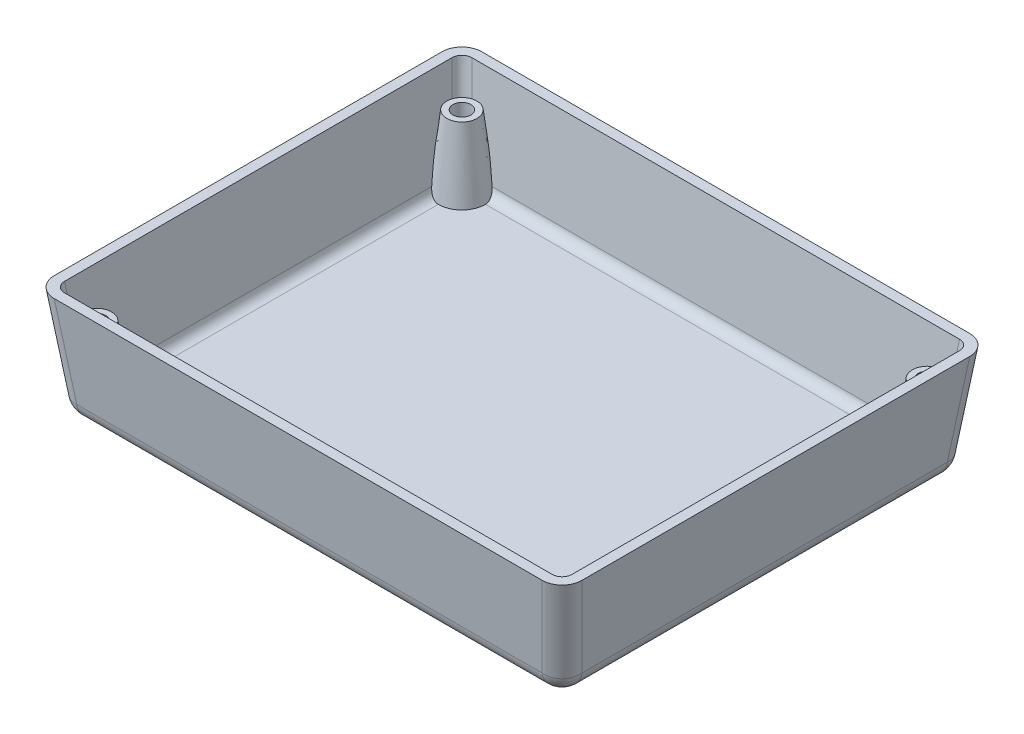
ISO-10303-21;
HEADER;
FILE_DESCRIPTION(('STEP AP214'),'2;1');
FILE_NAME('part.step','',(''),(''),'','','');
FILE_SCHEMA(('AUTOMOTIVE_DESIGN { 1 0 10303 214 1 1 1 1 }'));
ENDSEC;
DATA;
#1=APPLICATION_CONTEXT('core data for automotive mechanical design processes');
#2=APPLICATION_PROTOCOL_DEFINITION('international standard','automotive_design',2000,#1);
#3=PRODUCT_CONTEXT('',#1,'mechanical');
#4=PRODUCT('Part','Part','',(#3));
#5=PRODUCT_RELATED_PRODUCT_CATEGORY('part','',(#4));
#6=PRODUCT_DEFINITION_FORMATION('','',#4);
#7=PRODUCT_DEFINITION_CONTEXT('part definition',#1,'design');
#8=PRODUCT_DEFINITION('design','',#6,#7);
#9=PRODUCT_DEFINITION_SHAPE('','',#8);
#10=(LENGTH_UNIT() NAMED_UNIT(*) SI_UNIT(.MILLI.,.METRE.));
#11=(NAMED_UNIT(*) PLANE_ANGLE_UNIT() SI_UNIT($,.RADIAN.));
#12=(NAMED_UNIT(*) SI_UNIT($,.STERADIAN.) SOLID_ANGLE_UNIT());
#13=UNCERTAINTY_MEASURE_WITH_UNIT(LENGTH_MEASURE(1.E-05),#10,'distance_accuracy_value','');
#14=(GEOMETRIC_REPRESENTATION_CONTEXT(3) GLOBAL_UNCERTAINTY_ASSIGNED_CONTEXT((#13)) GLOBAL_UNIT_ASSIGNED_CONTEXT((#10,
#11,#12)) REPRESENTATION_CONTEXT('',''));
#15=CARTESIAN_POINT('',(0.,0.,0.));
#16=DIRECTION('',(0.,0.,1.));
#17=DIRECTION('',(1.,0.,0.));
#18=AXIS2_PLACEMENT_3D('',#15,#16,#17);
#19=CARTESIAN_POINT('',(-63.5,0.,-50.8));
#20=DIRECTION('',(-0.992546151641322,-0.121869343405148,0.));
#21=DIRECTION('',(0.121869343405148,-0.992546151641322,0.));
#22=AXIS2_PLACEMENT_3D('',#19,#20,#21);
#23=PLANE('',#22);
#24=DIRECTION('',(0.,0.,-1.));
#25=VECTOR('',#24,1.);
#26=CARTESIAN_POINT('',(-66.8994133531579,27.686,-50.8));
#27=LINE('',#26,#25);
#28=CARTESIAN_POINT('',(-66.8994133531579,27.686,-49.1572789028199));
#29=VERTEX_POINT('',#28);
#30=CARTESIAN_POINT('',(-66.8994133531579,27.686,49.1572789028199));
#31=VERTEX_POINT('',#30);
#32=EDGE_CURVE('E265',#29,#31,#27,.F.);
#33=ORIENTED_EDGE('',*,*,#32,.F.);
#34=DIRECTION('',(-0.120974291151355,0.985256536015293,-0.120974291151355));
#35=VECTOR('',#34,1.);
#36=CARTESIAN_POINT('',(-63.5737905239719,0.600975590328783,-45.831656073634));
#37=LINE('',#36,#35);
#38=CARTESIAN_POINT('',(-64.0477301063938,4.46090373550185,-46.3055956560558));
#39=VERTEX_POINT('',#38);
#40=EDGE_CURVE('E309',#29,#39,#37,.F.);
#41=ORIENTED_EDGE('',*,*,#40,.T.);
#42=DIRECTION('',(0.,0.,1.));
#43=VECTOR('',#42,1.);
#44=CARTESIAN_POINT('',(-64.0477301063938,4.46090373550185,-50.8));
#45=LINE('',#44,#43);
#46=CARTESIAN_POINT('',(-64.0477301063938,4.46090373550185,46.3055956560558));
#47=VERTEX_POINT('',#46);
#48=EDGE_CURVE('E307',#39,#47,#45,.T.);
#49=ORIENTED_EDGE('',*,*,#48,.T.);
#50=DIRECTION('',(-0.120974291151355,0.985256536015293,0.120974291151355));
#51=VECTOR('',#50,1.);
#52=CARTESIAN_POINT('',(-62.0868969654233,-11.5088006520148,44.3447625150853));
#53=LINE('',#52,#51);
#54=EDGE_CURVE('E305',#47,#31,#53,.T.);
#55=ORIENTED_EDGE('',*,*,#54,.T.);
#56=EDGE_LOOP('',(#33,#41,#49,#55));
#57=FACE_BOUND('',#56,.T.);
#58=ADVANCED_FACE('F31',(#57),#23,.T.);
#59=CARTESIAN_POINT('',(-63.5,0.,50.8));
#60=DIRECTION('',(0.,-0.121869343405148,0.992546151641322));
#61=DIRECTION('',(0.,-0.992546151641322,-0.121869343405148));
#62=AXIS2_PLACEMENT_3D('',#59,#60,#61);
#63=PLANE('',#62);
#64=DIRECTION('',(1.,0.,0.));
#65=VECTOR('',#64,1.);
#66=CARTESIAN_POINT('',(-63.5,4.46090373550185,51.3477301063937));
#67=LINE('',#66,#65);
#68=CARTESIAN_POINT('',(-59.0055956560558,4.46090373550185,51.3477301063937));
#69=VERTEX_POINT('',#68);
#70=CARTESIAN_POINT('',(59.0055956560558,4.46090373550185,51.3477301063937));
#71=VERTEX_POINT('',#70);
#72=EDGE_CURVE('E279',#69,#71,#67,.T.);
#73=ORIENTED_EDGE('',*,*,#72,.T.);
#74=DIRECTION('',(0.120974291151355,0.985256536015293,0.120974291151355));
#75=VECTOR('',#74,1.);
#76=CARTESIAN_POINT('',(56.6730391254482,-14.5362447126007,49.0151735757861));
#77=LINE('',#76,#75);
#78=CARTESIAN_POINT('',(61.8572789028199,27.686,54.1994133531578));
#79=VERTEX_POINT('',#78);
#80=EDGE_CURVE('E282',#71,#79,#77,.T.);
#81=ORIENTED_EDGE('',*,*,#80,.T.);
#82=DIRECTION('',(-1.,0.,0.));
#83=VECTOR('',#82,1.);
#84=CARTESIAN_POINT('',(-63.5,27.686,54.1994133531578));
#85=LINE('',#84,#83);
#86=CARTESIAN_POINT('',(-61.8572789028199,27.686,54.1994133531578));
#87=VERTEX_POINT('',#86);
#88=EDGE_CURVE('E268',#87,#79,#85,.F.);
#89=ORIENTED_EDGE('',*,*,#88,.F.);
#90=DIRECTION('',(-0.120974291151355,0.985256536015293,0.120974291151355));
#91=VECTOR('',#90,1.);
#92=CARTESIAN_POINT('',(-58.531656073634,0.600975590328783,50.8737905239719));
#93=LINE('',#92,#91);
#94=EDGE_CURVE('E277',#87,#69,#93,.F.);
#95=ORIENTED_EDGE('',*,*,#94,.T.);
#96=EDGE_LOOP('',(#73,#81,#89,#95));
#97=FACE_BOUND('',#96,.T.);
#98=ADVANCED_FACE('F373',(#97),#63,.T.);
#99=CARTESIAN_POINT('',(63.5,0.,-50.8));
#100=DIRECTION('',(0.992546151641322,-0.121869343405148,0.));
#101=DIRECTION('',(0.121869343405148,0.992546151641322,0.));
#102=AXIS2_PLACEMENT_3D('',#99,#100,#101);
#103=PLANE('',#102);
#104=DIRECTION('',(0.,0.,1.));
#105=VECTOR('',#104,1.);
#106=CARTESIAN_POINT('',(66.8994133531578,27.686,-50.8));
#107=LINE('',#106,#105);
#108=CARTESIAN_POINT('',(66.8994133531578,27.686,49.1572789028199));
#109=VERTEX_POINT('',#108);
#110=CARTESIAN_POINT('',(66.8994133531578,27.686,-49.1572789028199));
#111=VERTEX_POINT('',#110);
#112=EDGE_CURVE('E271',#109,#111,#107,.F.);
#113=ORIENTED_EDGE('',*,*,#112,.F.);
#114=DIRECTION('',(0.120974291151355,0.985256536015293,0.120974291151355));
#115=VECTOR('',#114,1.);
#116=CARTESIAN_POINT('',(62.0868969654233,-11.5088006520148,44.3447625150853));
#117=LINE('',#116,#115);
#118=CARTESIAN_POINT('',(64.0477301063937,4.46090373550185,46.3055956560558));
#119=VERTEX_POINT('',#118);
#120=EDGE_CURVE('E297',#109,#119,#117,.F.);
#121=ORIENTED_EDGE('',*,*,#120,.T.);
#122=DIRECTION('',(0.,0.,-1.));
#123=VECTOR('',#122,1.);
#124=CARTESIAN_POINT('',(64.0477301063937,4.46090373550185,-50.8));
#125=LINE('',#124,#123);
#126=CARTESIAN_POINT('',(64.0477301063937,4.46090373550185,-46.3055956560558));
#127=VERTEX_POINT('',#126);
#128=EDGE_CURVE('E295',#119,#127,#125,.T.);
#129=ORIENTED_EDGE('',*,*,#128,.T.);
#130=DIRECTION('',(0.120974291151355,0.985256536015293,-0.120974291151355));
#131=VECTOR('',#130,1.);
#132=CARTESIAN_POINT('',(63.5737905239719,0.600975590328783,-45.831656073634));
#133=LINE('',#132,#131);
#134=EDGE_CURVE('E293',#127,#111,#133,.T.);
#135=ORIENTED_EDGE('',*,*,#134,.T.);
#136=EDGE_LOOP('',(#113,#121,#129,#135));
#137=FACE_BOUND('',#136,.T.);
#138=ADVANCED_FACE('F383',(#137),#103,.T.);
#139=CARTESIAN_POINT('',(-63.5,0.,-50.8));
#140=DIRECTION('',(0.,-0.121869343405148,-0.992546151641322));
#141=DIRECTION('',(0.,0.992546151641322,-0.121869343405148));
#142=AXIS2_PLACEMENT_3D('',#139,#140,#141);
#143=PLANE('',#142);
#144=DIRECTION('',(1.,0.,0.));
#145=VECTOR('',#144,1.);
#146=CARTESIAN_POINT('',(-63.5,27.686,-54.1994133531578));
#147=LINE('',#146,#145);
#148=CARTESIAN_POINT('',(61.8572789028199,27.686,-54.1994133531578));
#149=VERTEX_POINT('',#148);
#150=CARTESIAN_POINT('',(-61.8572789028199,27.686,-54.1994133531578));
#151=VERTEX_POINT('',#150);
#152=EDGE_CURVE('E274',#149,#151,#147,.F.);
#153=ORIENTED_EDGE('',*,*,#152,.F.);
#154=DIRECTION('',(0.120974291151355,0.985256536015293,-0.120974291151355));
#155=VECTOR('',#154,1.);
#156=CARTESIAN_POINT('',(56.6730391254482,-14.5362447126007,-49.0151735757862));
#157=LINE('',#156,#155);
#158=CARTESIAN_POINT('',(59.0055956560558,4.46090373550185,-51.3477301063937));
#159=VERTEX_POINT('',#158);
#160=EDGE_CURVE('E303',#149,#159,#157,.F.);
#161=ORIENTED_EDGE('',*,*,#160,.T.);
#162=DIRECTION('',(-1.,0.,0.));
#163=VECTOR('',#162,1.);
#164=CARTESIAN_POINT('',(-63.5,4.46090373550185,-51.3477301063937));
#165=LINE('',#164,#163);
#166=CARTESIAN_POINT('',(-59.0055956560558,4.46090373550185,-51.3477301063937));
#167=VERTEX_POINT('',#166);
#168=EDGE_CURVE('E301',#159,#167,#165,.T.);
#169=ORIENTED_EDGE('',*,*,#168,.T.);
#170=DIRECTION('',(-0.120974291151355,0.985256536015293,-0.120974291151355));
#171=VECTOR('',#170,1.);
#172=CARTESIAN_POINT('',(-58.531656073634,0.600975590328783,-50.8737905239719));
#173=LINE('',#172,#171);
#174=EDGE_CURVE('E299',#167,#151,#173,.T.);
#175=ORIENTED_EDGE('',*,*,#174,.T.);
#176=EDGE_LOOP('',(#153,#161,#169,#175));
#177=FACE_BOUND('',#176,.T.);
#178=ADVANCED_FACE('F405',(#177),#143,.T.);
#179=CARTESIAN_POINT('',(-63.5,27.686,50.8));
#180=DIRECTION('',(0.,1.,0.));
#181=DIRECTION('',(0.,0.,1.));
#182=AXIS2_PLACEMENT_3D('',#179,#180,#181);
#183=PLANE('',#182);
#184=DIRECTION('',(-1.,0.,0.));
#185=VECTOR('',#184,1.);
#186=CARTESIAN_POINT('',(-63.5,27.686,51.6403383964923));
#187=LINE('',#186,#185);
#188=CARTESIAN_POINT('',(-61.8192711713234,27.686,51.6403383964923));
#189=VERTEX_POINT('',#188);
#190=CARTESIAN_POINT('',(61.8192711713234,27.686,51.6403383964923));
#191=VERTEX_POINT('',#190);
#192=EDGE_CURVE('E246',#189,#191,#187,.F.);
#193=ORIENTED_EDGE('',*,*,#192,.F.);
#194=CARTESIAN_POINT('',(-61.7812634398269,27.686,49.0812634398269));
#195=DIRECTION('',(0.,1.,0.));
#196=DIRECTION('',(0.707106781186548,0.,-0.707106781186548));
#197=AXIS2_PLACEMENT_3D('',#194,#195,#196);
#198=ELLIPSE('',#197,2.57800877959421,2.54);
#199=CARTESIAN_POINT('',(-64.3403383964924,27.686,49.1192711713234));
#200=VERTEX_POINT('',#199);
#201=EDGE_CURVE('E248',#200,#189,#198,.T.);
#202=ORIENTED_EDGE('',*,*,#201,.F.);
#203=DIRECTION('',(0.,0.,-1.));
#204=VECTOR('',#203,1.);
#205=CARTESIAN_POINT('',(-64.3403383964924,27.686,-50.8));
#206=LINE('',#205,#204);
#207=CARTESIAN_POINT('',(-64.3403383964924,27.686,-49.1192711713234));
#208=VERTEX_POINT('',#207);
#209=EDGE_CURVE('E243',#208,#200,#206,.F.);
#210=ORIENTED_EDGE('',*,*,#209,.F.);
#211=CARTESIAN_POINT('',(-61.7812634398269,27.686,-49.0812634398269));
#212=DIRECTION('',(0.,1.,0.));
#213=DIRECTION('',(0.707106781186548,0.,0.707106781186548));
#214=AXIS2_PLACEMENT_3D('',#211,#212,#213);
#215=ELLIPSE('',#214,2.57800877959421,2.54);
#216=CARTESIAN_POINT('',(-61.8192711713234,27.686,-51.6403383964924));
#217=VERTEX_POINT('',#216);
#218=EDGE_CURVE('E250',#217,#208,#215,.T.);
#219=ORIENTED_EDGE('',*,*,#218,.F.);
#220=DIRECTION('',(1.,0.,0.));
#221=VECTOR('',#220,1.);
#222=CARTESIAN_POINT('',(-63.5,27.686,-51.6403383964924));
#223=LINE('',#222,#221);
#224=CARTESIAN_POINT('',(61.8192711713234,27.686,-51.6403383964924));
#225=VERTEX_POINT('',#224);
#226=EDGE_CURVE('E240',#225,#217,#223,.F.);
#227=ORIENTED_EDGE('',*,*,#226,.F.);
#228=CARTESIAN_POINT('',(61.7812634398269,27.686,-49.0812634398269));
#229=DIRECTION('',(0.,1.,0.));
#230=DIRECTION('',(-0.707106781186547,0.,0.707106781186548));
#231=AXIS2_PLACEMENT_3D('',#228,#229,#230);
#232=ELLIPSE('',#231,2.57800877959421,2.54);
#233=CARTESIAN_POINT('',(64.3403383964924,27.686,-49.1192711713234));
#234=VERTEX_POINT('',#233);
#235=EDGE_CURVE('E258',#234,#225,#232,.T.);
#236=ORIENTED_EDGE('',*,*,#235,.F.);
#237=DIRECTION('',(0.,0.,1.));
#238=VECTOR('',#237,1.);
#239=CARTESIAN_POINT('',(64.3403383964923,27.686,-50.8));
#240=LINE('',#239,#238);
#241=CARTESIAN_POINT('',(64.3403383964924,27.686,49.1192711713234));
#242=VERTEX_POINT('',#241);
#243=EDGE_CURVE('E254',#242,#234,#240,.F.);
#244=ORIENTED_EDGE('',*,*,#243,.F.);
#245=CARTESIAN_POINT('',(61.7812634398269,27.686,49.0812634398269));
#246=DIRECTION('',(0.,1.,0.));
#247=DIRECTION('',(-0.707106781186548,0.,-0.707106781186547));
#248=AXIS2_PLACEMENT_3D('',#245,#246,#247);
#249=ELLIPSE('',#248,2.57800877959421,2.54);
#250=EDGE_CURVE('E255',#191,#242,#249,.T.);
#251=ORIENTED_EDGE('',*,*,#250,.F.);
#252=EDGE_LOOP('',(#193,#202,#210,#219,#227,#236,#244,#251));
#253=FACE_BOUND('',#252,.T.);
#254=ORIENTED_EDGE('',*,*,#88,.T.);
#255=CARTESIAN_POINT('',(61.7812634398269,27.686,49.0812634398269));
#256=DIRECTION('',(0.,1.,0.));
#257=DIRECTION('',(-0.707106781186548,0.,-0.707106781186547));
#258=AXIS2_PLACEMENT_3D('',#255,#256,#257);
#259=ELLIPSE('',#258,5.15601755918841,5.08);
#260=EDGE_CURVE('E11',#79,#109,#259,.T.);
#261=ORIENTED_EDGE('',*,*,#260,.T.);
#262=ORIENTED_EDGE('',*,*,#112,.T.);
#263=CARTESIAN_POINT('',(61.7812634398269,27.686,-49.0812634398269));
#264=DIRECTION('',(0.,1.,0.));
#265=DIRECTION('',(-0.707106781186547,0.,0.707106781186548));
#266=AXIS2_PLACEMENT_3D('',#263,#264,#265);
#267=ELLIPSE('',#266,5.15601755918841,5.08);
#268=EDGE_CURVE('E40',#111,#149,#267,.T.);
#269=ORIENTED_EDGE('',*,*,#268,.T.);
#270=ORIENTED_EDGE('',*,*,#152,.T.);
#271=CARTESIAN_POINT('',(-61.7812634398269,27.686,-49.0812634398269));
#272=DIRECTION('',(0.,1.,0.));
#273=DIRECTION('',(0.707106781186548,0.,0.707106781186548));
#274=AXIS2_PLACEMENT_3D('',#271,#272,#273);
#275=ELLIPSE('',#274,5.15601755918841,5.08);
#276=EDGE_CURVE('E313',#151,#29,#275,.T.);
#277=ORIENTED_EDGE('',*,*,#276,.T.);
#278=ORIENTED_EDGE('',*,*,#32,.T.);
#279=CARTESIAN_POINT('',(-61.7812634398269,27.686,49.0812634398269));
#280=DIRECTION('',(0.,1.,0.));
#281=DIRECTION('',(0.707106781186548,0.,-0.707106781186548));
#282=AXIS2_PLACEMENT_3D('',#279,#280,#281);
#283=ELLIPSE('',#282,5.15601755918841,5.08);
#284=EDGE_CURVE('E311',#31,#87,#283,.T.);
#285=ORIENTED_EDGE('',*,*,#284,.T.);
#286=EDGE_LOOP('',(#254,#261,#262,#269,#270,#277,#278,#285));
#287=FACE_BOUND('',#286,.T.);
#288=ADVANCED_FACE('F370',(#253,#287),#183,.T.);
#289=CARTESIAN_POINT('',(-63.5,0.,50.8));
#290=DIRECTION('',(0.,1.,0.));
#291=DIRECTION('',(0.,0.,1.));
#292=AXIS2_PLACEMENT_3D('',#289,#290,#291);
#293=PLANE('',#292);
#294=DIRECTION('',(0.,0.,1.));
#295=VECTOR('',#294,1.);
#296=CARTESIAN_POINT('',(59.0055956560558,0.,50.7999999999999));
#297=LINE('',#296,#295);
#298=CARTESIAN_POINT('',(59.0055956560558,0.,-46.3055956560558));
#299=VERTEX_POINT('',#298);
#300=CARTESIAN_POINT('',(59.0055956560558,0.,46.3055956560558));
#301=VERTEX_POINT('',#300);
#302=EDGE_CURVE('E288',#299,#301,#297,.T.);
#303=ORIENTED_EDGE('',*,*,#302,.T.);
#304=DIRECTION('',(-1.,0.,0.));
#305=VECTOR('',#304,1.);
#306=CARTESIAN_POINT('',(-63.5,0.,46.3055956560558));
#307=LINE('',#306,#305);
#308=CARTESIAN_POINT('',(-59.0055956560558,0.,46.3055956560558));
#309=VERTEX_POINT('',#308);
#310=EDGE_CURVE('E290',#301,#309,#307,.T.);
#311=ORIENTED_EDGE('',*,*,#310,.T.);
#312=DIRECTION('',(0.,0.,-1.));
#313=VECTOR('',#312,1.);
#314=CARTESIAN_POINT('',(-59.0055956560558,0.,50.8));
#315=LINE('',#314,#313);
#316=CARTESIAN_POINT('',(-59.0055956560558,0.,-46.3055956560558));
#317=VERTEX_POINT('',#316);
#318=EDGE_CURVE('E284',#309,#317,#315,.T.);
#319=ORIENTED_EDGE('',*,*,#318,.T.);
#320=DIRECTION('',(1.,0.,0.));
#321=VECTOR('',#320,1.);
#322=CARTESIAN_POINT('',(-63.5,0.,-46.3055956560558));
#323=LINE('',#322,#321);
#324=EDGE_CURVE('E286',#317,#299,#323,.T.);
#325=ORIENTED_EDGE('',*,*,#324,.T.);
#326=EDGE_LOOP('',(#303,#311,#319,#325));
#327=FACE_BOUND('',#326,.T.);
#328=ADVANCED_FACE('F400',(#327),#293,.F.);
#329=CARTESIAN_POINT('',(-58.531656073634,1.22007185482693,-45.831656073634));
#330=DIRECTION('',(0.120974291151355,-0.985256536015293,0.120974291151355));
#331=DIRECTION('',(0.,-0.121869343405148,-0.992546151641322));
#332=AXIS2_PLACEMENT_3D('',#329,#330,#331);
#333=CYLINDRICAL_SURFACE('',#332,5.08);
#334=ORIENTED_EDGE('',*,*,#276,.F.);
#335=ORIENTED_EDGE('',*,*,#174,.F.);
#336=CARTESIAN_POINT('',(-59.0055956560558,5.08,-46.3055956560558));
#337=DIRECTION('',(0.120974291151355,-0.985256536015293,0.120974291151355));
#338=DIRECTION('',(0.,-0.121869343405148,-0.992546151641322));
#339=AXIS2_PLACEMENT_3D('',#336,#337,#338);
#340=CIRCLE('',#339,5.08);
#341=EDGE_CURVE('E342',#39,#167,#340,.T.);
#342=ORIENTED_EDGE('',*,*,#341,.F.);
#343=ORIENTED_EDGE('',*,*,#40,.F.);
#344=EDGE_LOOP('',(#334,#335,#342,#343));
#345=FACE_BOUND('',#344,.T.);
#346=ADVANCED_FACE('F33',(#345),#333,.T.);
#347=CARTESIAN_POINT('',(56.6730391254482,-13.9171484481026,-43.9730391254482));
#348=DIRECTION('',(-0.120974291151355,-0.985256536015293,0.120974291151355));
#349=DIRECTION('',(0.,-0.121869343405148,-0.992546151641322));
#350=AXIS2_PLACEMENT_3D('',#347,#348,#349);
#351=CYLINDRICAL_SURFACE('',#350,5.08);
#352=ORIENTED_EDGE('',*,*,#268,.F.);
#353=ORIENTED_EDGE('',*,*,#134,.F.);
#354=CARTESIAN_POINT('',(59.0055956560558,5.08,-46.3055956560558));
#355=DIRECTION('',(-0.120974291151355,-0.985256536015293,0.120974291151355));
#356=DIRECTION('',(0.992546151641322,-0.121869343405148,0.));
#357=AXIS2_PLACEMENT_3D('',#354,#355,#356);
#358=CIRCLE('',#357,5.08);
#359=EDGE_CURVE('E340',#159,#127,#358,.T.);
#360=ORIENTED_EDGE('',*,*,#359,.F.);
#361=ORIENTED_EDGE('',*,*,#160,.F.);
#362=EDGE_LOOP('',(#352,#353,#360,#361));
#363=FACE_BOUND('',#362,.T.);
#364=ADVANCED_FACE('F388',(#363),#351,.T.);
#365=CARTESIAN_POINT('',(-63.5,5.08,-46.3055956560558));
#366=DIRECTION('',(1.,0.,0.));
#367=DIRECTION('',(0.,0.,-1.));
#368=AXIS2_PLACEMENT_3D('',#365,#366,#367);
#369=CYLINDRICAL_SURFACE('',#368,5.08);
#370=CARTESIAN_POINT('',(-59.0055956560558,5.08,-46.3055956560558));
#371=DIRECTION('',(-1.,0.,0.));
#372=DIRECTION('',(0.,0.,1.));
#373=AXIS2_PLACEMENT_3D('',#370,#371,#372);
#374=CIRCLE('',#373,5.08);
#375=EDGE_CURVE('E35',#167,#317,#374,.T.);
#376=ORIENTED_EDGE('',*,*,#375,.F.);
#377=ORIENTED_EDGE('',*,*,#168,.F.);
#378=CARTESIAN_POINT('',(59.0055956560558,5.08,-46.3055956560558));
#379=DIRECTION('',(1.,0.,0.));
#380=DIRECTION('',(0.,0.,-1.));
#381=AXIS2_PLACEMENT_3D('',#378,#379,#380);
#382=CIRCLE('',#381,5.08);
#383=EDGE_CURVE('E337',#299,#159,#382,.T.);
#384=ORIENTED_EDGE('',*,*,#383,.F.);
#385=ORIENTED_EDGE('',*,*,#324,.F.);
#386=EDGE_LOOP('',(#376,#377,#384,#385));
#387=FACE_BOUND('',#386,.T.);
#388=ADVANCED_FACE('F401',(#387),#369,.T.);
#389=CARTESIAN_POINT('',(-59.0055956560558,5.08,-46.3055956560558));
#390=DIRECTION('',(0.,0.,1.));
#391=DIRECTION('',(1.,0.,0.));
#392=AXIS2_PLACEMENT_3D('',#389,#390,#391);
#393=SPHERICAL_SURFACE('',#392,5.08);
#394=ORIENTED_EDGE('',*,*,#341,.T.);
#395=ORIENTED_EDGE('',*,*,#375,.T.);
#396=CARTESIAN_POINT('',(-59.0055956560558,5.08,-46.3055956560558));
#397=DIRECTION('',(0.,0.,-1.));
#398=DIRECTION('',(-1.,0.,0.));
#399=AXIS2_PLACEMENT_3D('',#396,#397,#398);
#400=CIRCLE('',#399,5.08);
#401=EDGE_CURVE('E334',#39,#317,#400,.F.);
#402=ORIENTED_EDGE('',*,*,#401,.F.);
#403=EDGE_LOOP('',(#394,#395,#402));
#404=FACE_BOUND('',#403,.T.);
#405=ADVANCED_FACE('F349',(#404),#393,.T.);
#406=CARTESIAN_POINT('',(59.0055956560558,5.08,-46.3055956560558));
#407=DIRECTION('',(0.,0.,1.));
#408=DIRECTION('',(1.,0.,0.));
#409=AXIS2_PLACEMENT_3D('',#406,#407,#408);
#410=SPHERICAL_SURFACE('',#409,5.08);
#411=ORIENTED_EDGE('',*,*,#383,.T.);
#412=ORIENTED_EDGE('',*,*,#359,.T.);
#413=CARTESIAN_POINT('',(59.0055956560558,5.08,-46.3055956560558));
#414=DIRECTION('',(0.,0.,-1.));
#415=DIRECTION('',(-1.,0.,0.));
#416=AXIS2_PLACEMENT_3D('',#413,#414,#415);
#417=CIRCLE('',#416,5.08);
#418=EDGE_CURVE('E331',#299,#127,#417,.F.);
#419=ORIENTED_EDGE('',*,*,#418,.F.);
#420=EDGE_LOOP('',(#411,#412,#419));
#421=FACE_BOUND('',#420,.T.);
#422=ADVANCED_FACE('F392',(#421),#410,.T.);
#423=CARTESIAN_POINT('',(-59.0055956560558,5.08,-50.8));
#424=DIRECTION('',(0.,0.,-1.));
#425=DIRECTION('',(-1.,0.,0.));
#426=AXIS2_PLACEMENT_3D('',#423,#424,#425);
#427=CYLINDRICAL_SURFACE('',#426,5.08);
#428=ORIENTED_EDGE('',*,*,#401,.T.);
#429=ORIENTED_EDGE('',*,*,#318,.F.);
#430=CARTESIAN_POINT('',(-59.0055956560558,5.08,46.3055956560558));
#431=DIRECTION('',(0.,0.,1.));
#432=DIRECTION('',(1.,0.,0.));
#433=AXIS2_PLACEMENT_3D('',#430,#431,#432);
#434=CIRCLE('',#433,5.08);
#435=EDGE_CURVE('E328',#47,#309,#434,.T.);
#436=ORIENTED_EDGE('',*,*,#435,.F.);
#437=ORIENTED_EDGE('',*,*,#48,.F.);
#438=EDGE_LOOP('',(#428,#429,#436,#437));
#439=FACE_BOUND('',#438,.T.);
#440=ADVANCED_FACE('F356',(#439),#427,.T.);
#441=CARTESIAN_POINT('',(-58.531656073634,1.22007185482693,45.831656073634));
#442=DIRECTION('',(0.120974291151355,-0.985256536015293,-0.120974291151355));
#443=DIRECTION('',(0.,0.121869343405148,-0.992546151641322));
#444=AXIS2_PLACEMENT_3D('',#441,#442,#443);
#445=CYLINDRICAL_SURFACE('',#444,5.08);
#446=ORIENTED_EDGE('',*,*,#284,.F.);
#447=ORIENTED_EDGE('',*,*,#54,.F.);
#448=CARTESIAN_POINT('',(-59.0055956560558,5.08,46.3055956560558));
#449=DIRECTION('',(0.120974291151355,-0.985256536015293,-0.120974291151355));
#450=DIRECTION('',(0.,0.121869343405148,-0.992546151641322));
#451=AXIS2_PLACEMENT_3D('',#448,#449,#450);
#452=CIRCLE('',#451,5.08);
#453=EDGE_CURVE('E325',#69,#47,#452,.T.);
#454=ORIENTED_EDGE('',*,*,#453,.F.);
#455=ORIENTED_EDGE('',*,*,#94,.F.);
#456=EDGE_LOOP('',(#446,#447,#454,#455));
#457=FACE_BOUND('',#456,.T.);
#458=ADVANCED_FACE('F365',(#457),#445,.T.);
#459=CARTESIAN_POINT('',(57.0447625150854,-10.8897043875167,44.3447625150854));
#460=DIRECTION('',(-0.120974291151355,-0.985256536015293,-0.120974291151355));
#461=DIRECTION('',(0.992546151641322,-0.121869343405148,0.));
#462=AXIS2_PLACEMENT_3D('',#459,#460,#461);
#463=CYLINDRICAL_SURFACE('',#462,5.08);
#464=ORIENTED_EDGE('',*,*,#260,.F.);
#465=ORIENTED_EDGE('',*,*,#80,.F.);
#466=CARTESIAN_POINT('',(59.0055956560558,5.08,46.3055956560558));
#467=DIRECTION('',(-0.120974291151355,-0.985256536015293,-0.120974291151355));
#468=DIRECTION('',(0.,0.121869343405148,-0.992546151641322));
#469=AXIS2_PLACEMENT_3D('',#466,#467,#468);
#470=CIRCLE('',#469,5.08);
#471=EDGE_CURVE('E322',#119,#71,#470,.T.);
#472=ORIENTED_EDGE('',*,*,#471,.F.);
#473=ORIENTED_EDGE('',*,*,#120,.F.);
#474=EDGE_LOOP('',(#464,#465,#472,#473));
#475=FACE_BOUND('',#474,.T.);
#476=ADVANCED_FACE('F378',(#475),#463,.T.);
#477=CARTESIAN_POINT('',(59.0055956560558,5.08,-50.8));
#478=DIRECTION('',(0.,0.,1.));
#479=DIRECTION('',(1.,0.,0.));
#480=AXIS2_PLACEMENT_3D('',#477,#478,#479);
#481=CYLINDRICAL_SURFACE('',#480,5.08);
#482=ORIENTED_EDGE('',*,*,#418,.T.);
#483=ORIENTED_EDGE('',*,*,#128,.F.);
#484=CARTESIAN_POINT('',(59.0055956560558,5.08,46.3055956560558));
#485=DIRECTION('',(0.,0.,1.));
#486=DIRECTION('',(1.,0.,0.));
#487=AXIS2_PLACEMENT_3D('',#484,#485,#486);
#488=CIRCLE('',#487,5.08);
#489=EDGE_CURVE('E319',#301,#119,#488,.T.);
#490=ORIENTED_EDGE('',*,*,#489,.F.);
#491=ORIENTED_EDGE('',*,*,#302,.F.);
#492=EDGE_LOOP('',(#482,#483,#490,#491));
#493=FACE_BOUND('',#492,.T.);
#494=ADVANCED_FACE('F396',(#493),#481,.T.);
#495=CARTESIAN_POINT('',(-59.0055956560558,5.08,46.3055956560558));
#496=DIRECTION('',(0.,0.,1.));
#497=DIRECTION('',(1.,0.,0.));
#498=AXIS2_PLACEMENT_3D('',#495,#496,#497);
#499=SPHERICAL_SURFACE('',#498,5.08);
#500=ORIENTED_EDGE('',*,*,#453,.T.);
#501=ORIENTED_EDGE('',*,*,#435,.T.);
#502=CARTESIAN_POINT('',(-59.0055956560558,5.08,46.3055956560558));
#503=DIRECTION('',(-1.,0.,0.));
#504=DIRECTION('',(0.,0.,1.));
#505=AXIS2_PLACEMENT_3D('',#502,#503,#504);
#506=CIRCLE('',#505,5.08);
#507=EDGE_CURVE('E317',#69,#309,#506,.F.);
#508=ORIENTED_EDGE('',*,*,#507,.F.);
#509=EDGE_LOOP('',(#500,#501,#508));
#510=FACE_BOUND('',#509,.T.);
#511=ADVANCED_FACE('F434',(#510),#499,.T.);
#512=CARTESIAN_POINT('',(59.0055956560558,5.08,46.3055956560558));
#513=DIRECTION('',(0.,0.,1.));
#514=DIRECTION('',(1.,0.,0.));
#515=AXIS2_PLACEMENT_3D('',#512,#513,#514);
#516=SPHERICAL_SURFACE('',#515,5.08);
#517=ORIENTED_EDGE('',*,*,#489,.T.);
#518=ORIENTED_EDGE('',*,*,#471,.T.);
#519=CARTESIAN_POINT('',(59.0055956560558,5.08,46.3055956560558));
#520=DIRECTION('',(1.,0.,0.));
#521=DIRECTION('',(0.,0.,-1.));
#522=AXIS2_PLACEMENT_3D('',#519,#520,#521);
#523=CIRCLE('',#522,5.08);
#524=EDGE_CURVE('E257',#301,#71,#523,.F.);
#525=ORIENTED_EDGE('',*,*,#524,.F.);
#526=EDGE_LOOP('',(#517,#518,#525));
#527=FACE_BOUND('',#526,.T.);
#528=ADVANCED_FACE('F430',(#527),#516,.T.);
#529=CARTESIAN_POINT('',(-63.5,5.08,46.3055956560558));
#530=DIRECTION('',(-1.,0.,0.));
#531=DIRECTION('',(0.,0.,1.));
#532=AXIS2_PLACEMENT_3D('',#529,#530,#531);
#533=CYLINDRICAL_SURFACE('',#532,5.08);
#534=ORIENTED_EDGE('',*,*,#507,.T.);
#535=ORIENTED_EDGE('',*,*,#310,.F.);
#536=ORIENTED_EDGE('',*,*,#524,.T.);
#537=ORIENTED_EDGE('',*,*,#72,.F.);
#538=EDGE_LOOP('',(#534,#535,#536,#537));
#539=FACE_BOUND('',#538,.T.);
#540=ADVANCED_FACE('F426',(#539),#533,.T.);
#541=CARTESIAN_POINT('',(-60.9789327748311,0.309548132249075,-50.8));
#542=DIRECTION('',(-0.992546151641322,-0.121869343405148,0.));
#543=DIRECTION('',(0.121869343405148,-0.992546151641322,0.));
#544=AXIS2_PLACEMENT_3D('',#541,#542,#543);
#545=PLANE('',#544);
#546=CARTESIAN_POINT('',(-61.5266383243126,4.77025186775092,-41.1719437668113));
#547=CARTESIAN_POINT('',(-61.5749612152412,5.1638102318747,-41.2495337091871));
#548=CARTESIAN_POINT('',(-61.6232455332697,5.55705444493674,-41.3287734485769));
#549=CARTESIAN_POINT('',(-61.7197236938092,6.3428060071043,-41.4911514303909));
#550=CARTESIAN_POINT('',(-61.767917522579,6.73531324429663,-41.5742902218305));
#551=CARTESIAN_POINT('',(-61.864500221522,7.52191620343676,-41.7455979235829));
#552=CARTESIAN_POINT('',(-61.9128883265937,7.91600569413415,-41.8337959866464));
#553=CARTESIAN_POINT('',(-62.0095111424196,8.7029353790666,-42.0155373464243));
#554=CARTESIAN_POINT('',(-62.0577458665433,9.09577568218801,-42.1090801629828));
#555=CARTESIAN_POINT('',(-62.1622850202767,9.94717876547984,-42.3191939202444));
#556=CARTESIAN_POINT('',(-62.2185538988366,10.4054520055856,-42.4369620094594));
#557=CARTESIAN_POINT('',(-62.3307464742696,11.3191872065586,-42.6837873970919));
#558=CARTESIAN_POINT('',(-62.3866700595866,11.7746482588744,-42.8128481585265));
#559=CARTESIAN_POINT('',(-62.4700440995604,12.4536753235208,-43.0175784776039));
#560=CARTESIAN_POINT('',(-62.4977025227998,12.678935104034,-43.087547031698));
#561=CARTESIAN_POINT('',(-62.5528439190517,13.1280257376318,-43.2319811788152));
#562=CARTESIAN_POINT('',(-62.580326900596,13.3518566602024,-43.3064465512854));
#563=CARTESIAN_POINT('',(-62.6350513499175,13.7975515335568,-43.4607767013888));
#564=CARTESIAN_POINT('',(-62.6622929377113,14.0194164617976,-43.5406386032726));
#565=CARTESIAN_POINT('',(-62.7164674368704,14.4606323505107,-43.7070944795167));
#566=CARTESIAN_POINT('',(-62.7434003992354,14.6799837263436,-43.7936873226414));
#567=CARTESIAN_POINT('',(-62.7827510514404,15.0004690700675,-43.9276349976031));
#568=CARTESIAN_POINT('',(-62.7953392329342,15.1029915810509,-43.9716226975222));
#569=CARTESIAN_POINT('',(-62.8203972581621,15.3070728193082,-44.0618338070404));
#570=CARTESIAN_POINT('',(-62.8328670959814,15.4086314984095,-44.1080573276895));
#571=CARTESIAN_POINT('',(-62.8576888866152,15.6107887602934,-44.2031906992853));
#572=CARTESIAN_POINT('',(-62.8700405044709,15.7113846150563,-44.2521064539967));
#573=CARTESIAN_POINT('',(-62.8945581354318,15.9110646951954,-44.3529677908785));
#574=CARTESIAN_POINT('',(-62.9067241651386,16.0101490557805,-44.4049131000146));
#575=CARTESIAN_POINT('',(-62.9305453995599,16.2041574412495,-44.5111934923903));
#576=CARTESIAN_POINT('',(-62.9422059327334,16.2991248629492,-44.5654477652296));
#577=CARTESIAN_POINT('',(-62.9652253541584,16.4866030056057,-44.6780986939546));
#578=CARTESIAN_POINT('',(-62.9765843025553,16.5791142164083,-44.7364945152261));
#579=CARTESIAN_POINT('',(-62.9988556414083,16.7604997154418,-44.8581786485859));
#580=CARTESIAN_POINT('',(-63.0097693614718,16.8493848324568,-44.9214504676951));
#581=CARTESIAN_POINT('',(-63.0310096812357,17.022373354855,-45.0542667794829));
#582=CARTESIAN_POINT('',(-63.0413368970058,17.106481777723,-45.1238044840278));
#583=CARTESIAN_POINT('',(-63.0550657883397,17.2182946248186,-45.2258952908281));
#584=CARTESIAN_POINT('',(-63.0588415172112,17.2490454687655,-45.2550685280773));
#585=CARTESIAN_POINT('',(-63.0662338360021,17.3092510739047,-45.3147477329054));
#586=CARTESIAN_POINT('',(-63.0698504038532,17.3387056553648,-45.3452538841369));
#587=CARTESIAN_POINT('',(-63.0804309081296,17.4248769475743,-45.4390865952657));
#588=CARTESIAN_POINT('',(-63.0871118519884,17.4792888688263,-45.5046272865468));
#589=CARTESIAN_POINT('',(-63.0994449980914,17.5797342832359,-45.6434487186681));
#590=CARTESIAN_POINT('',(-63.1050820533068,17.6256444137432,-45.7168222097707));
#591=CARTESIAN_POINT('',(-63.1146340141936,17.7034388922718,-45.8707789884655));
#592=CARTESIAN_POINT('',(-63.1185555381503,17.7353771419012,-45.9513330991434));
#593=CARTESIAN_POINT('',(-63.1231409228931,17.7727221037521,-46.0906856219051));
#594=CARTESIAN_POINT('',(-63.1244492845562,17.7833778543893,-46.1480473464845));
#595=CARTESIAN_POINT('',(-63.1258476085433,17.7947662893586,-46.2637597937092));
#596=CARTESIAN_POINT('',(-63.125938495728,17.7955065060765,-46.3221097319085));
#597=CARTESIAN_POINT('',(-63.1248918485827,17.7869822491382,-46.4379802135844));
#598=CARTESIAN_POINT('',(-63.1237555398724,17.7777277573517,-46.4955015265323));
#599=CARTESIAN_POINT('',(-63.1203846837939,17.7502743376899,-46.6083210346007));
#600=CARTESIAN_POINT('',(-63.118149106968,17.7320670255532,-46.6636170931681));
#601=CARTESIAN_POINT('',(-63.1114844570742,17.6777878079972,-46.7969942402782));
#602=CARTESIAN_POINT('',(-63.1065175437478,17.6373355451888,-46.8732459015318));
#603=CARTESIAN_POINT('',(-63.0952254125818,17.5453685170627,-47.0186298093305));
#604=CARTESIAN_POINT('',(-63.0888962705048,17.4938217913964,-47.0877406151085));
#605=CARTESIAN_POINT('',(-63.0755808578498,17.3853764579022,-47.2171115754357));
#606=CARTESIAN_POINT('',(-63.0686275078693,17.3287459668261,-47.2776043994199));
#607=CARTESIAN_POINT('',(-63.0541252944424,17.2106349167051,-47.3936272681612));
#608=CARTESIAN_POINT('',(-63.0465758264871,17.1491494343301,-47.449152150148));
#609=CARTESIAN_POINT('',(-63.0309936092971,17.0222424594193,-47.5564214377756));
#610=CARTESIAN_POINT('',(-63.0229576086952,16.956794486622,-47.60813372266));
#611=CARTESIAN_POINT('',(-63.0065707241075,16.8233340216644,-47.7079718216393));
#612=CARTESIAN_POINT('',(-62.9982200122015,16.7553229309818,-47.7560995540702));
#613=CARTESIAN_POINT('',(-62.976170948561,16.5757477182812,-47.8774684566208));
#614=CARTESIAN_POINT('',(-62.9622818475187,16.4626300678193,-47.9483708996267));
#615=CARTESIAN_POINT('',(-62.9340754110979,16.2329070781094,-48.0842302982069));
#616=CARTESIAN_POINT('',(-62.919757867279,16.1163000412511,-48.1491842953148));
#617=CARTESIAN_POINT('',(-62.8907788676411,15.8802850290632,-48.2744599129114));
#618=CARTESIAN_POINT('',(-62.8761166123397,15.760870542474,-48.3347690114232));
#619=CARTESIAN_POINT('',(-62.84656034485,15.5201540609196,-48.4514390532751));
#620=CARTESIAN_POINT('',(-62.831666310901,15.3988518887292,-48.5077996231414));
#621=CARTESIAN_POINT('',(-62.8026009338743,15.1621333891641,-48.613920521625));
#622=CARTESIAN_POINT('',(-62.7884400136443,15.0468019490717,-48.6638739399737));
#623=CARTESIAN_POINT('',(-62.759989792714,14.8150934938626,-48.7612729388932));
#624=CARTESIAN_POINT('',(-62.7457004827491,14.698716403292,-48.808718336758));
#625=CARTESIAN_POINT('',(-62.7171092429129,14.4658594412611,-48.9011309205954));
#626=CARTESIAN_POINT('',(-62.7028079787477,14.3493849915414,-48.9461120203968));
#627=CARTESIAN_POINT('',(-62.6741212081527,14.1157499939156,-49.0341613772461));
#628=CARTESIAN_POINT('',(-62.6597357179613,13.9985895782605,-49.077229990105));
#629=CARTESIAN_POINT('',(-62.6453148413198,13.8811409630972,-49.1194711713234));
#630=B_SPLINE_CURVE_WITH_KNOTS('',3,(#546,#547,#548,#549,#550,#551,#552,#553,#554,#555,#556,
#557,#558,#559,#560,#561,#562,#563,#564,#565,#566,#567,#568,#569,#570,#571,#572,#573,#574,#575,
#576,#577,#578,#579,#580,#581,#582,#583,#584,#585,#586,#587,#588,#589,#590,#591,#592,#593,#594,
#595,#596,#597,#598,#599,#600,#601,#602,#603,#604,#605,#606,#607,#608,#609,#610,#611,#612,#613,
#614,#615,#616,#617,#618,#619,#620,#621,#622,#623,#624,#625,#626,#627,#628,#629),.UNSPECIFIED.,
.F.,.F.,(4,2,2,2,2,2,2,2,2,2,2,2,2,2,2,2,2,2,2,2,2,2,2,2,2,2,2,2,2,2,2,2,2,2,2,2,2,2,2,2,2,4),
(0.,1.21210775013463,2.42438668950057,3.64453610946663,4.86457608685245,6.29397000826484,
7.72380381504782,8.43624484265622,9.14865095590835,9.86068038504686,10.5725904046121,
10.9093755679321,11.2461774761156,11.583749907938,11.9212919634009,12.2511863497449,
12.5810144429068,12.909772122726,13.2381778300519,13.3658074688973,13.4934547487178,
13.7492009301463,14.0084084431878,14.2666069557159,14.4409014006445,14.6150634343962,
14.789051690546,14.9632031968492,15.2210968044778,15.4797435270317,15.728833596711,
15.978179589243,16.229430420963,16.4805458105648,16.8829498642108,17.2855529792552,
17.6892059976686,18.0928971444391,18.4723040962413,18.8517386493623,19.2287455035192,
19.6056819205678),.UNSPECIFIED.);
#631=CARTESIAN_POINT('',(-61.5266628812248,4.77045186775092,-41.1719831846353));
#632=VERTEX_POINT('',#631);
#633=CARTESIAN_POINT('',(-62.9949408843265,16.7286165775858,-47.7738736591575));
#634=VERTEX_POINT('',#633);
#635=EDGE_CURVE('E48',#632,#634,#630,.T.);
#636=ORIENTED_EDGE('',*,*,#635,.T.);
#637=DIRECTION('',(0.120974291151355,-0.985256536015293,0.120974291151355));
#638=VECTOR('',#637,1.);
#639=CARTESIAN_POINT('',(-61.052723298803,0.910523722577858,-45.831656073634));
#640=LINE('',#639,#638);
#641=EDGE_CURVE('E251',#208,#634,#640,.T.);
#642=ORIENTED_EDGE('',*,*,#641,.F.);
#643=ORIENTED_EDGE('',*,*,#209,.T.);
#644=DIRECTION('',(0.120974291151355,-0.985256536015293,-0.120974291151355));
#645=VECTOR('',#644,1.);
#646=CARTESIAN_POINT('',(-61.052723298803,0.910523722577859,45.8316560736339));
#647=LINE('',#646,#645);
#648=CARTESIAN_POINT('',(-62.9949408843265,16.7286165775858,47.7738736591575));
#649=VERTEX_POINT('',#648);
#650=EDGE_CURVE('E1020',#649,#200,#647,.F.);
#651=ORIENTED_EDGE('',*,*,#650,.F.);
#652=CARTESIAN_POINT('',(-62.6453148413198,13.8811409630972,49.1194711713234));
#653=CARTESIAN_POINT('',(-62.6573301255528,13.9789976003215,49.0842821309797));
#654=CARTESIAN_POINT('',(-62.6693201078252,14.0766481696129,49.048513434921));
#655=CARTESIAN_POINT('',(-62.6932424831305,14.2714802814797,48.9756792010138));
#656=CARTESIAN_POINT('',(-62.7051748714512,14.3686617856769,48.9386135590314));
#657=CARTESIAN_POINT('',(-62.7409218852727,14.6597978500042,48.825115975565));
#658=CARTESIAN_POINT('',(-62.7646361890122,14.8529353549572,48.746528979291));
#659=CARTESIAN_POINT('',(-62.8124688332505,15.2425009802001,48.5794269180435));
#660=CARTESIAN_POINT('',(-62.8365746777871,15.4388273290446,48.4906697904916));
#661=CARTESIAN_POINT('',(-62.8841832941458,15.8265683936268,48.3031064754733));
#662=CARTESIAN_POINT('',(-62.9076866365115,16.0179877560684,48.2043102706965));
#663=CARTESIAN_POINT('',(-62.9421333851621,16.2985340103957,48.0459586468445));
#664=CARTESIAN_POINT('',(-62.9534386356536,16.3906078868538,47.9917115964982));
#665=CARTESIAN_POINT('',(-62.9757397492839,16.5722358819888,47.878961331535));
#666=CARTESIAN_POINT('',(-62.9867354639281,16.6617887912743,47.8204561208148));
#667=CARTESIAN_POINT('',(-63.0082094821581,16.8366806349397,47.698736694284));
#668=CARTESIAN_POINT('',(-63.0186911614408,16.922047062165,47.6355629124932));
#669=CARTESIAN_POINT('',(-63.0390365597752,17.0877470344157,47.5028945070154));
#670=CARTESIAN_POINT('',(-63.0489009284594,17.1680858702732,47.4334067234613));
#671=CARTESIAN_POINT('',(-63.0655060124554,17.3033234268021,47.3036155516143));
#672=CARTESIAN_POINT('',(-63.0724373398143,17.3597745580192,47.2449708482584));
#673=CARTESIAN_POINT('',(-63.085543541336,17.4665160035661,47.1219553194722));
#674=CARTESIAN_POINT('',(-63.0917170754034,17.5167954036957,47.0575746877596));
#675=CARTESIAN_POINT('',(-63.1030224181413,17.6088700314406,46.921460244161));
#676=CARTESIAN_POINT('',(-63.1081387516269,17.6505392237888,46.84963757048));
#677=CARTESIAN_POINT('',(-63.1166733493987,17.7200479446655,46.699511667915));
#678=CARTESIAN_POINT('',(-63.1200981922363,17.7479410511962,46.6212349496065));
#679=CARTESIAN_POINT('',(-63.1240061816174,17.7797690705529,46.4843612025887));
#680=CARTESIAN_POINT('',(-63.1250624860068,17.7883719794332,46.4268711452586));
#681=CARTESIAN_POINT('',(-63.1259516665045,17.7956137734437,46.3112542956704));
#682=CARTESIAN_POINT('',(-63.1257851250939,17.7942574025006,46.2531278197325));
#683=CARTESIAN_POINT('',(-63.1242502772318,17.7817570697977,46.1381246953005));
#684=CARTESIAN_POINT('',(-63.1228847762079,17.770635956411,46.0812454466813));
#685=CARTESIAN_POINT('',(-63.1191024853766,17.7398316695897,45.9699013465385));
#686=CARTESIAN_POINT('',(-63.1166845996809,17.7201395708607,45.9154390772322));
#687=CARTESIAN_POINT('',(-63.1094273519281,17.6610340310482,45.7804509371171));
#688=CARTESIAN_POINT('',(-63.1039879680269,17.616733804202,45.7021181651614));
#689=CARTESIAN_POINT('',(-63.0917333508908,17.5169279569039,45.553111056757));
#690=CARTESIAN_POINT('',(-63.0849141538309,17.4613900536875,45.4824597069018));
#691=CARTESIAN_POINT('',(-63.0688347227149,17.3304335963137,45.3336551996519));
#692=CARTESIAN_POINT('',(-63.0593630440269,17.2532929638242,45.2570654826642));
#693=CARTESIAN_POINT('',(-63.0395682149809,17.0920770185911,45.1115928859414));
#694=CARTESIAN_POINT('',(-63.0292435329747,17.0079892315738,45.0427244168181));
#695=CARTESIAN_POINT('',(-63.0079709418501,16.8347378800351,44.9107956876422));
#696=CARTESIAN_POINT('',(-62.9970198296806,16.7455482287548,44.8477705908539));
#697=CARTESIAN_POINT('',(-62.9747273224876,16.5639903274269,44.7267941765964));
#698=CARTESIAN_POINT('',(-62.9633862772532,16.4716249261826,44.6688384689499));
#699=CARTESIAN_POINT('',(-62.9308109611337,16.2063202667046,44.5102274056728));
#700=CARTESIAN_POINT('',(-62.9092307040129,16.0305631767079,44.414371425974));
#701=CARTESIAN_POINT('',(-62.8654612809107,15.674089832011,44.2324429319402));
#702=CARTESIAN_POINT('',(-62.843271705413,15.4933702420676,44.1463772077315));
#703=CARTESIAN_POINT('',(-62.798436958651,15.1282205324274,43.9815585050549));
#704=CARTESIAN_POINT('',(-62.7757908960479,14.9437831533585,43.9028219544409));
#705=CARTESIAN_POINT('',(-62.7302057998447,14.5725223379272,43.7512717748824));
#706=CARTESIAN_POINT('',(-62.7072667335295,14.3856986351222,43.6784588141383));
#707=CARTESIAN_POINT('',(-62.6610898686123,14.009618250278,43.5374006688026));
#708=CARTESIAN_POINT('',(-62.6378513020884,13.8203553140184,43.4691724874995));
#709=CARTESIAN_POINT('',(-62.591203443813,13.4404389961,43.3367480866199));
#710=CARTESIAN_POINT('',(-62.5677941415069,13.2497855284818,43.2725521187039));
#711=CARTESIAN_POINT('',(-62.4974317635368,12.6767299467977,43.0852296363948));
#712=CARTESIAN_POINT('',(-62.4502780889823,12.2926940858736,42.9671711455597));
#713=CARTESIAN_POINT('',(-62.3665409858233,11.6107101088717,42.7672701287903));
#714=CARTESIAN_POINT('',(-62.3300297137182,11.3133496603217,42.6833577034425));
#715=CARTESIAN_POINT('',(-62.256841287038,10.7172777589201,42.5205166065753));
#716=CARTESIAN_POINT('',(-62.2201641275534,10.4185662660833,42.4415880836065));
#717=CARTESIAN_POINT('',(-62.1466557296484,9.81988840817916,42.2878835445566));
#718=CARTESIAN_POINT('',(-62.109824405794,9.51992134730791,42.2131102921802));
#719=CARTESIAN_POINT('',(-62.0360555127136,8.91912192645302,42.0671770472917));
#720=CARTESIAN_POINT('',(-61.9991179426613,8.6182895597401,41.9960170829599));
#721=CARTESIAN_POINT('',(-61.9259629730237,8.02249014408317,41.858361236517));
#722=CARTESIAN_POINT('',(-61.8897474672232,7.7275385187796,41.7917974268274));
#723=CARTESIAN_POINT('',(-61.8172453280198,7.13705598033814,41.6613248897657));
#724=CARTESIAN_POINT('',(-61.7809586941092,6.84152506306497,41.5974161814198));
#725=CARTESIAN_POINT('',(-61.7083626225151,6.25027750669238,41.4720273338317));
#726=CARTESIAN_POINT('',(-61.672053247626,5.95456137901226,41.4105447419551));
#727=CARTESIAN_POINT('',(-61.5993828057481,5.36270812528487,41.2897071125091));
#728=CARTESIAN_POINT('',(-61.5630217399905,5.06657100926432,41.2303520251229));
#729=CARTESIAN_POINT('',(-61.5266383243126,4.77025186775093,41.1719437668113));
#730=B_SPLINE_CURVE_WITH_KNOTS('',3,(#652,#653,#654,#655,#656,#657,#658,#659,#660,#661,#662,
#663,#664,#665,#666,#667,#668,#669,#670,#671,#672,#673,#674,#675,#676,#677,#678,#679,#680,#681,
#682,#683,#684,#685,#686,#687,#688,#689,#690,#691,#692,#693,#694,#695,#696,#697,#698,#699,#700,
#701,#702,#703,#704,#705,#706,#707,#708,#709,#710,#711,#712,#713,#714,#715,#716,#717,#718,#719,
#720,#721,#722,#723,#724,#725,#726,#727,#728,#729),.UNSPECIFIED.,.F.,.F.,(4,2,2,2,2,2,2,2,2,2,2,
2,2,2,2,2,2,2,2,2,2,2,2,2,2,2,2,2,2,2,2,2,2,2,2,2,2,2,4),(0.,0.314045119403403,0.62811551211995,
1.25756586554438,1.90779041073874,2.55737459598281,2.8796770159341,3.20213150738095,
3.52206257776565,3.84165109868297,4.08641537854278,4.33160645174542,4.58016571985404,
4.82775052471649,5.00136974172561,5.17490626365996,5.34803780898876,5.52135007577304,
5.79025604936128,6.05994577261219,6.38655033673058,6.71375465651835,7.04281505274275,
7.37158759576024,7.9751610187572,8.57915053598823,9.18446280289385,9.78984325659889,
10.397357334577,11.0049092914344,12.2182820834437,13.1516130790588,14.0849718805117,
15.0189442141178,15.9529238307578,16.8665015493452,17.7800858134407,18.692721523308,
19.6053358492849),.UNSPECIFIED.);
#731=CARTESIAN_POINT('',(-61.5266628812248,4.77045186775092,41.1719831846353));
#732=VERTEX_POINT('',#731);
#733=EDGE_CURVE('E916',#649,#732,#730,.T.);
#734=ORIENTED_EDGE('',*,*,#733,.T.);
#735=DIRECTION('',(0.,0.,1.));
#736=VECTOR('',#735,1.);
#737=CARTESIAN_POINT('',(-61.5266628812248,4.77045186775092,-50.8));
#738=LINE('',#737,#736);
#739=EDGE_CURVE('E1069',#632,#732,#738,.T.);
#740=ORIENTED_EDGE('',*,*,#739,.F.);
#741=EDGE_LOOP('',(#636,#642,#643,#651,#734,#740));
#742=FACE_BOUND('',#741,.T.);
#743=ADVANCED_FACE('F429',(#742),#545,.F.);
#744=CARTESIAN_POINT('',(-63.5,0.309548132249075,48.278932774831));
#745=DIRECTION('',(0.,-0.121869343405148,0.992546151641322));
#746=DIRECTION('',(0.,-0.992546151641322,-0.121869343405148));
#747=AXIS2_PLACEMENT_3D('',#744,#745,#746);
#748=PLANE('',#747);
#749=CARTESIAN_POINT('',(-53.8719437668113,4.77025186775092,48.8266383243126));
#750=CARTESIAN_POINT('',(-53.9495337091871,5.16381023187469,48.8749612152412));
#751=CARTESIAN_POINT('',(-54.0287734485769,5.55705444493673,48.9232455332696));
#752=CARTESIAN_POINT('',(-54.1911514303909,6.34280600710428,49.0197236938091));
#753=CARTESIAN_POINT('',(-54.2742902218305,6.73531324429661,49.067917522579));
#754=CARTESIAN_POINT('',(-54.4455979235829,7.52191620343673,49.1645002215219));
#755=CARTESIAN_POINT('',(-54.5337959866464,7.91600569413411,49.2128883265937));
#756=CARTESIAN_POINT('',(-54.7155373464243,8.70293537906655,49.3095111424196));
#757=CARTESIAN_POINT('',(-54.8090801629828,9.09577568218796,49.3577458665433));
#758=CARTESIAN_POINT('',(-55.0191939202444,9.94717876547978,49.4622850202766));
#759=CARTESIAN_POINT('',(-55.1369620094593,10.4054520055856,49.5185538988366));
#760=CARTESIAN_POINT('',(-55.3837873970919,11.3191872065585,49.6307464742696));
#761=CARTESIAN_POINT('',(-55.5128481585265,11.7746482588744,49.6866700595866));
#762=CARTESIAN_POINT('',(-55.7175784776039,12.4536753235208,49.7700440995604));
#763=CARTESIAN_POINT('',(-55.787547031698,12.6789351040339,49.7977025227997));
#764=CARTESIAN_POINT('',(-55.9319811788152,13.1280257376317,49.8528439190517));
#765=CARTESIAN_POINT('',(-56.0064465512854,13.3518566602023,49.880326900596));
#766=CARTESIAN_POINT('',(-56.1607767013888,13.7975515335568,49.9350513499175));
#767=CARTESIAN_POINT('',(-56.2406386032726,14.0194164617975,49.9622929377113));
#768=CARTESIAN_POINT('',(-56.4070944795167,14.4606323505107,50.0164674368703));
#769=CARTESIAN_POINT('',(-56.4936873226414,14.6799837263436,50.0434003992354));
#770=CARTESIAN_POINT('',(-56.6276349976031,15.0004690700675,50.0827510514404));
#771=CARTESIAN_POINT('',(-56.6716226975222,15.1029915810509,50.0953392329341));
#772=CARTESIAN_POINT('',(-56.7618338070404,15.3070728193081,50.1203972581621));
#773=CARTESIAN_POINT('',(-56.8080573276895,15.4086314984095,50.1328670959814));
#774=CARTESIAN_POINT('',(-56.9031906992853,15.6107887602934,50.1576888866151));
#775=CARTESIAN_POINT('',(-56.9521064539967,15.7113846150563,50.1700405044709));
#776=CARTESIAN_POINT('',(-57.0529677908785,15.9110646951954,50.1945581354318));
#777=CARTESIAN_POINT('',(-57.1049131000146,16.0101490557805,50.2067241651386));
#778=CARTESIAN_POINT('',(-57.2111934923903,16.2041574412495,50.2305453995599));
#779=CARTESIAN_POINT('',(-57.2654477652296,16.2991248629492,50.2422059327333));
#780=CARTESIAN_POINT('',(-57.3780986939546,16.4866030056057,50.2652253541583));
#781=CARTESIAN_POINT('',(-57.4364945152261,16.5791142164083,50.2765843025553));
#782=CARTESIAN_POINT('',(-57.5581786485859,16.7604997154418,50.2988556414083));
#783=CARTESIAN_POINT('',(-57.6214504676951,16.8493848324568,50.3097693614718));
#784=CARTESIAN_POINT('',(-57.7542667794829,17.0223733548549,50.3310096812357));
#785=CARTESIAN_POINT('',(-57.8238044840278,17.1064817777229,50.3413368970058));
#786=CARTESIAN_POINT('',(-57.9258952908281,17.2182946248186,50.3550657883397));
#787=CARTESIAN_POINT('',(-57.9550685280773,17.2490454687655,50.3588415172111));
#788=CARTESIAN_POINT('',(-58.0147477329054,17.3092510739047,50.366233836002));
#789=CARTESIAN_POINT('',(-58.0452538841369,17.3387056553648,50.3698504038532));
#790=CARTESIAN_POINT('',(-58.1390865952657,17.4248769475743,50.3804309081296));
#791=CARTESIAN_POINT('',(-58.2046272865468,17.4792888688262,50.3871118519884));
#792=CARTESIAN_POINT('',(-58.3434487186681,17.5797342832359,50.3994449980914));
#793=CARTESIAN_POINT('',(-58.4168222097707,17.6256444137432,50.4050820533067));
#794=CARTESIAN_POINT('',(-58.5707789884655,17.7034388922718,50.4146340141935));
#795=CARTESIAN_POINT('',(-58.6513330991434,17.7353771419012,50.4185555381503));
#796=CARTESIAN_POINT('',(-58.7906856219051,17.7727221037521,50.4231409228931));
#797=CARTESIAN_POINT('',(-58.8480473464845,17.7833778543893,50.4244492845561));
#798=CARTESIAN_POINT('',(-58.9637597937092,17.7947662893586,50.4258476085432));
#799=CARTESIAN_POINT('',(-59.0221097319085,17.7955065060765,50.4259384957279));
#800=CARTESIAN_POINT('',(-59.1379802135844,17.7869822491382,50.4248918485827));
#801=CARTESIAN_POINT('',(-59.1955015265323,17.7777277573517,50.4237555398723));
#802=CARTESIAN_POINT('',(-59.3083210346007,17.7502743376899,50.4203846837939));
#803=CARTESIAN_POINT('',(-59.3636170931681,17.7320670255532,50.4181491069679));
#804=CARTESIAN_POINT('',(-59.4969942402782,17.6777878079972,50.4114844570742));
#805=CARTESIAN_POINT('',(-59.5732459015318,17.6373355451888,50.4065175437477));
#806=CARTESIAN_POINT('',(-59.7186298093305,17.5453685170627,50.3952254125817));
#807=CARTESIAN_POINT('',(-59.7877406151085,17.4938217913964,50.3888962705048));
#808=CARTESIAN_POINT('',(-59.9171115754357,17.3853764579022,50.3755808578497));
#809=CARTESIAN_POINT('',(-59.97760439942,17.3287459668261,50.3686275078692));
#810=CARTESIAN_POINT('',(-60.0936272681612,17.2106349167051,50.3541252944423));
#811=CARTESIAN_POINT('',(-60.149152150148,17.1491494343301,50.346575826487));
#812=CARTESIAN_POINT('',(-60.2564214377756,17.0222424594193,50.3309936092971));
#813=CARTESIAN_POINT('',(-60.30813372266,16.956794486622,50.3229576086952));
#814=CARTESIAN_POINT('',(-60.4079718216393,16.8233340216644,50.3065707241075));
#815=CARTESIAN_POINT('',(-60.4560995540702,16.7553229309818,50.2982200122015));
#816=CARTESIAN_POINT('',(-60.5774684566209,16.5757477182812,50.276170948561));
#817=CARTESIAN_POINT('',(-60.6483708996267,16.4626300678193,50.2622818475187));
#818=CARTESIAN_POINT('',(-60.7842302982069,16.2329070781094,50.2340754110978));
#819=CARTESIAN_POINT('',(-60.8491842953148,16.1163000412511,50.219757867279));
#820=CARTESIAN_POINT('',(-60.9744599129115,15.8802850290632,50.190778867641));
#821=CARTESIAN_POINT('',(-61.0347690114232,15.760870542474,50.1761166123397));
#822=CARTESIAN_POINT('',(-61.1514390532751,15.5201540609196,50.14656034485));
#823=CARTESIAN_POINT('',(-61.2077996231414,15.3988518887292,50.131666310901));
#824=CARTESIAN_POINT('',(-61.313920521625,15.162133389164,50.1026009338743));
#825=CARTESIAN_POINT('',(-61.3638739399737,15.0468019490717,50.0884400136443));
#826=CARTESIAN_POINT('',(-61.4612729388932,14.8150934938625,50.0599897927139));
#827=CARTESIAN_POINT('',(-61.508718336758,14.698716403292,50.045700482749));
#828=CARTESIAN_POINT('',(-61.6011309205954,14.4658594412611,50.0171092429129));
#829=CARTESIAN_POINT('',(-61.6461120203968,14.3493849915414,50.0028079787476));
#830=CARTESIAN_POINT('',(-61.7341613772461,14.1157499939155,49.9741212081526));
#831=CARTESIAN_POINT('',(-61.777229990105,13.9985895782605,49.9597357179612));
#832=CARTESIAN_POINT('',(-61.8194711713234,13.8811409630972,49.9453148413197));
#833=B_SPLINE_CURVE_WITH_KNOTS('',3,(#749,#750,#751,#752,#753,#754,#755,#756,#757,#758,#759,
#760,#761,#762,#763,#764,#765,#766,#767,#768,#769,#770,#771,#772,#773,#774,#775,#776,#777,#778,
#779,#780,#781,#782,#783,#784,#785,#786,#787,#788,#789,#790,#791,#792,#793,#794,#795,#796,#797,
#798,#799,#800,#801,#802,#803,#804,#805,#806,#807,#808,#809,#810,#811,#812,#813,#814,#815,#816,
#817,#818,#819,#820,#821,#822,#823,#824,#825,#826,#827,#828,#829,#830,#831,#832),.UNSPECIFIED.,
.F.,.F.,(4,2,2,2,2,2,2,2,2,2,2,2,2,2,2,2,2,2,2,2,2,2,2,2,2,2,2,2,2,2,2,2,2,2,2,2,2,2,2,2,2,4),
(0.,1.21210775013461,2.42438668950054,3.64453610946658,4.86457608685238,6.29397000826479,
7.72380381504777,8.43624484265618,9.14865095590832,9.86068038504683,10.5725904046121,
10.9093755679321,11.2461774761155,11.583749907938,11.9212919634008,12.2511863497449,
12.5810144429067,12.9097721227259,13.2381778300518,13.3658074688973,13.4934547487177,
13.7492009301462,14.0084084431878,14.2666069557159,14.4409014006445,14.6150634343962,
14.789051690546,14.9632031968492,15.2210968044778,15.4797435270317,15.728833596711,
15.978179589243,16.229430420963,16.4805458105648,16.8829498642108,17.2855529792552,
17.6892059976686,18.0928971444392,18.4723040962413,18.8517386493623,19.2287455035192,
19.6056819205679),.UNSPECIFIED.);
#834=CARTESIAN_POINT('',(-53.8719831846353,4.77045186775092,48.8266628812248));
#835=VERTEX_POINT('',#834);
#836=CARTESIAN_POINT('',(-60.4738736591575,16.7286165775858,50.2949408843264));
#837=VERTEX_POINT('',#836);
#838=EDGE_CURVE('E898',#835,#837,#833,.T.);
#839=ORIENTED_EDGE('',*,*,#838,.T.);
#840=DIRECTION('',(0.120974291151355,-0.985256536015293,-0.120974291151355));
#841=VECTOR('',#840,1.);
#842=CARTESIAN_POINT('',(-58.531656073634,0.910523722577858,48.3527232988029));
#843=LINE('',#842,#841);
#844=EDGE_CURVE('E236',#189,#837,#843,.T.);
#845=ORIENTED_EDGE('',*,*,#844,.F.);
#846=ORIENTED_EDGE('',*,*,#192,.T.);
#847=DIRECTION('',(-0.120974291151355,-0.985256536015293,-0.120974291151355));
#848=VECTOR('',#847,1.);
#849=CARTESIAN_POINT('',(57.0447625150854,-11.1992525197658,46.8658297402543));
#850=LINE('',#849,#848);
#851=CARTESIAN_POINT('',(60.4738736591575,16.7286165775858,50.2949408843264));
#852=VERTEX_POINT('',#851);
#853=EDGE_CURVE('E232',#852,#191,#850,.F.);
#854=ORIENTED_EDGE('',*,*,#853,.F.);
#855=CARTESIAN_POINT('',(61.8194711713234,13.8811409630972,49.9453148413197));
#856=CARTESIAN_POINT('',(61.7842821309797,13.9789976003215,49.9573301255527));
#857=CARTESIAN_POINT('',(61.7485134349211,14.0766481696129,49.9693201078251));
#858=CARTESIAN_POINT('',(61.6756792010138,14.2714802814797,49.9932424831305));
#859=CARTESIAN_POINT('',(61.6386135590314,14.3686617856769,50.0051748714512));
#860=CARTESIAN_POINT('',(61.525115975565,14.6597978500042,50.0409218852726));
#861=CARTESIAN_POINT('',(61.446528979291,14.8529353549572,50.0646361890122));
#862=CARTESIAN_POINT('',(61.2794269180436,15.2425009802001,50.1124688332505));
#863=CARTESIAN_POINT('',(61.1906697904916,15.4388273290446,50.136574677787));
#864=CARTESIAN_POINT('',(61.0031064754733,15.8265683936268,50.1841832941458));
#865=CARTESIAN_POINT('',(60.9043102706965,16.0179877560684,50.2076866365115));
#866=CARTESIAN_POINT('',(60.7459586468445,16.2985340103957,50.242133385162));
#867=CARTESIAN_POINT('',(60.6917115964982,16.3906078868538,50.2534386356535));
#868=CARTESIAN_POINT('',(60.5789613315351,16.5722358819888,50.2757397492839));
#869=CARTESIAN_POINT('',(60.5204561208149,16.6617887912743,50.2867354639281));
#870=CARTESIAN_POINT('',(60.398736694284,16.8366806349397,50.308209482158));
#871=CARTESIAN_POINT('',(60.3355629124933,16.922047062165,50.3186911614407));
#872=CARTESIAN_POINT('',(60.2028945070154,17.0877470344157,50.3390365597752));
#873=CARTESIAN_POINT('',(60.1334067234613,17.1680858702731,50.3489009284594));
#874=CARTESIAN_POINT('',(60.0036155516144,17.3033234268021,50.3655060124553));
#875=CARTESIAN_POINT('',(59.9449708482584,17.3597745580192,50.3724373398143));
#876=CARTESIAN_POINT('',(59.8219553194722,17.466516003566,50.3855435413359));
#877=CARTESIAN_POINT('',(59.7575746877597,17.5167954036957,50.3917170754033));
#878=CARTESIAN_POINT('',(59.621460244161,17.6088700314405,50.4030224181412));
#879=CARTESIAN_POINT('',(59.54963757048,17.6505392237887,50.4081387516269));
#880=CARTESIAN_POINT('',(59.399511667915,17.7200479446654,50.4166733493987));
#881=CARTESIAN_POINT('',(59.3212349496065,17.7479410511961,50.4200981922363));
#882=CARTESIAN_POINT('',(59.1843612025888,17.7797690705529,50.4240061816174));
#883=CARTESIAN_POINT('',(59.1268711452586,17.7883719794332,50.4250624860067));
#884=CARTESIAN_POINT('',(59.0112542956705,17.7956137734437,50.4259516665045));
#885=CARTESIAN_POINT('',(58.9531278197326,17.7942574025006,50.4257851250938));
#886=CARTESIAN_POINT('',(58.8381246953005,17.7817570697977,50.4242502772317));
#887=CARTESIAN_POINT('',(58.7812454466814,17.770635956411,50.4228847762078));
#888=CARTESIAN_POINT('',(58.6699013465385,17.7398316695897,50.4191024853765));
#889=CARTESIAN_POINT('',(58.6154390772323,17.7201395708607,50.4166845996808));
#890=CARTESIAN_POINT('',(58.4804509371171,17.6610340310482,50.409427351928));
#891=CARTESIAN_POINT('',(58.4021181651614,17.616733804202,50.4039879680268));
#892=CARTESIAN_POINT('',(58.2531110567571,17.5169279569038,50.3917333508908));
#893=CARTESIAN_POINT('',(58.1824597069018,17.4613900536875,50.3849141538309));
#894=CARTESIAN_POINT('',(58.0336551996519,17.3304335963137,50.3688347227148));
#895=CARTESIAN_POINT('',(57.9570654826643,17.2532929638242,50.3593630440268));
#896=CARTESIAN_POINT('',(57.8115928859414,17.0920770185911,50.3395682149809));
#897=CARTESIAN_POINT('',(57.7427244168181,17.0079892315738,50.3292435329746));
#898=CARTESIAN_POINT('',(57.6107956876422,16.834737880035,50.3079709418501));
#899=CARTESIAN_POINT('',(57.5477705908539,16.7455482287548,50.2970198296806));
#900=CARTESIAN_POINT('',(57.4267941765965,16.5639903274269,50.2747273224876));
#901=CARTESIAN_POINT('',(57.3688384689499,16.4716249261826,50.2633862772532));
#902=CARTESIAN_POINT('',(57.2102274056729,16.2063202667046,50.2308109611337));
#903=CARTESIAN_POINT('',(57.114371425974,16.0305631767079,50.2092307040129));
#904=CARTESIAN_POINT('',(56.9324429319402,15.674089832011,50.1654612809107));
#905=CARTESIAN_POINT('',(56.8463772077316,15.4933702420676,50.1432717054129));
#906=CARTESIAN_POINT('',(56.681558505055,15.1282205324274,50.0984369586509));
#907=CARTESIAN_POINT('',(56.6028219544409,14.9437831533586,50.0757908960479));
#908=CARTESIAN_POINT('',(56.4512717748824,14.5725223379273,50.0302057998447));
#909=CARTESIAN_POINT('',(56.3784588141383,14.3856986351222,50.0072667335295));
#910=CARTESIAN_POINT('',(56.2374006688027,14.009618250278,49.9610898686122));
#911=CARTESIAN_POINT('',(56.1691724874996,13.8203553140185,49.9378513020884));
#912=CARTESIAN_POINT('',(56.03674808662,13.4404389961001,49.8912034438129));
#913=CARTESIAN_POINT('',(55.972552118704,13.2497855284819,49.8677941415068));
#914=CARTESIAN_POINT('',(55.7852296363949,12.6767299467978,49.7974317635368));
#915=CARTESIAN_POINT('',(55.6671711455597,12.2926940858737,49.7502780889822));
#916=CARTESIAN_POINT('',(55.4672701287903,11.6107101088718,49.6665409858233));
#917=CARTESIAN_POINT('',(55.3833577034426,11.3133496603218,49.6300297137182));
#918=CARTESIAN_POINT('',(55.2205166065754,10.7172777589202,49.556841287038));
#919=CARTESIAN_POINT('',(55.1415880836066,10.4185662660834,49.5201641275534));
#920=CARTESIAN_POINT('',(54.9878835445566,9.81988840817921,49.4466557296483));
#921=CARTESIAN_POINT('',(54.9131102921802,9.51992134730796,49.4098244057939));
#922=CARTESIAN_POINT('',(54.7671770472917,8.91912192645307,49.3360555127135));
#923=CARTESIAN_POINT('',(54.69601708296,8.61828955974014,49.2991179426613));
#924=CARTESIAN_POINT('',(54.558361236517,8.02249014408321,49.2259629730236));
#925=CARTESIAN_POINT('',(54.4917974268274,7.72753851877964,49.1897474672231));
#926=CARTESIAN_POINT('',(54.3613248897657,7.13705598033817,49.1172453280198));
#927=CARTESIAN_POINT('',(54.2974161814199,6.84152506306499,49.0809586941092));
#928=CARTESIAN_POINT('',(54.1720273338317,6.2502775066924,49.008362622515));
#929=CARTESIAN_POINT('',(54.1105447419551,5.95456137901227,48.9720532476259));
#930=CARTESIAN_POINT('',(53.9897071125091,5.36270812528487,48.8993828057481));
#931=CARTESIAN_POINT('',(53.930352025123,5.06657100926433,48.8630217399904));
#932=CARTESIAN_POINT('',(53.8719437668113,4.77025186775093,48.8266383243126));
#933=B_SPLINE_CURVE_WITH_KNOTS('',3,(#855,#856,#857,#858,#859,#860,#861,#862,#863,#864,#865,
#866,#867,#868,#869,#870,#871,#872,#873,#874,#875,#876,#877,#878,#879,#880,#881,#882,#883,#884,
#885,#886,#887,#888,#889,#890,#891,#892,#893,#894,#895,#896,#897,#898,#899,#900,#901,#902,#903,
#904,#905,#906,#907,#908,#909,#910,#911,#912,#913,#914,#915,#916,#917,#918,#919,#920,#921,#922,
#923,#924,#925,#926,#927,#928,#929,#930,#931,#932),.UNSPECIFIED.,.F.,.F.,(4,2,2,2,2,2,2,2,2,2,2,
2,2,2,2,2,2,2,2,2,2,2,2,2,2,2,2,2,2,2,2,2,2,2,2,2,2,2,4),(0.,0.314045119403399,
0.628115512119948,1.25756586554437,1.90779041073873,2.55737459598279,2.87967701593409,
3.20213150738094,3.52206257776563,3.84165109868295,4.08641537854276,4.33160645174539,
4.58016571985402,4.82775052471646,5.00136974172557,5.17490626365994,5.34803780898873,
5.52135007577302,5.79025604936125,6.05994577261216,6.38655033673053,6.71375465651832,
7.04281505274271,7.37158759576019,7.97516101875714,8.57915053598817,9.18446280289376,
9.7898432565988,10.3973573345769,11.0049092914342,12.2182820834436,13.1516130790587,
14.0849718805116,15.0189442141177,15.9529238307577,16.8665015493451,17.7800858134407,
18.692721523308,19.6053358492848),.UNSPECIFIED.);
#934=CARTESIAN_POINT('',(53.8719831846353,4.77045186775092,48.8266628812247));
#935=VERTEX_POINT('',#934);
#936=EDGE_CURVE('E856',#852,#935,#933,.T.);
#937=ORIENTED_EDGE('',*,*,#936,.T.);
#938=DIRECTION('',(1.,0.,0.));
#939=VECTOR('',#938,1.);
#940=CARTESIAN_POINT('',(-63.5,4.77045186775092,48.8266628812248));
#941=LINE('',#940,#939);
#942=EDGE_CURVE('E239',#835,#935,#941,.T.);
#943=ORIENTED_EDGE('',*,*,#942,.F.);
#944=EDGE_LOOP('',(#839,#845,#846,#854,#937,#943));
#945=FACE_BOUND('',#944,.T.);
#946=ADVANCED_FACE('F499',(#945),#748,.F.);
#947=CARTESIAN_POINT('',(60.978932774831,0.309548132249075,-50.8));
#948=DIRECTION('',(0.992546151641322,-0.121869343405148,0.));
#949=DIRECTION('',(0.121869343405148,0.992546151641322,0.));
#950=AXIS2_PLACEMENT_3D('',#947,#948,#949);
#951=PLANE('',#950);
#952=CARTESIAN_POINT('',(62.6453148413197,13.8811409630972,-49.1194711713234));
#953=CARTESIAN_POINT('',(62.6573301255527,13.9789976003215,-49.0842821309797));
#954=CARTESIAN_POINT('',(62.6693201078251,14.0766481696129,-49.0485134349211));
#955=CARTESIAN_POINT('',(62.6932424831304,14.2714802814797,-48.9756792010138));
#956=CARTESIAN_POINT('',(62.7051748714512,14.3686617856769,-48.9386135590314));
#957=CARTESIAN_POINT('',(62.7409218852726,14.6597978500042,-48.825115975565));
#958=CARTESIAN_POINT('',(62.7646361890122,14.8529353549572,-48.746528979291));
#959=CARTESIAN_POINT('',(62.8124688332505,15.2425009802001,-48.5794269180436));
#960=CARTESIAN_POINT('',(62.836574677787,15.4388273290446,-48.4906697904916));
#961=CARTESIAN_POINT('',(62.8841832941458,15.8265683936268,-48.3031064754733));
#962=CARTESIAN_POINT('',(62.9076866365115,16.0179877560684,-48.2043102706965));
#963=CARTESIAN_POINT('',(62.942133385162,16.2985340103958,-48.0459586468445));
#964=CARTESIAN_POINT('',(62.9534386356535,16.3906078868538,-47.9917115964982));
#965=CARTESIAN_POINT('',(62.9757397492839,16.5722358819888,-47.878961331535));
#966=CARTESIAN_POINT('',(62.9867354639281,16.6617887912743,-47.8204561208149));
#967=CARTESIAN_POINT('',(63.008209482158,16.8366806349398,-47.698736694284));
#968=CARTESIAN_POINT('',(63.0186911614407,16.922047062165,-47.6355629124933));
#969=CARTESIAN_POINT('',(63.0390365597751,17.0877470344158,-47.5028945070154));
#970=CARTESIAN_POINT('',(63.0489009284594,17.1680858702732,-47.4334067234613));
#971=CARTESIAN_POINT('',(63.0655060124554,17.3033234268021,-47.3036155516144));
#972=CARTESIAN_POINT('',(63.0724373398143,17.3597745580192,-47.2449708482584));
#973=CARTESIAN_POINT('',(63.0855435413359,17.4665160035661,-47.1219553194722));
#974=CARTESIAN_POINT('',(63.0917170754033,17.5167954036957,-47.0575746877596));
#975=CARTESIAN_POINT('',(63.1030224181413,17.6088700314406,-46.921460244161));
#976=CARTESIAN_POINT('',(63.1081387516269,17.6505392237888,-46.84963757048));
#977=CARTESIAN_POINT('',(63.1166733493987,17.7200479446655,-46.699511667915));
#978=CARTESIAN_POINT('',(63.1200981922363,17.7479410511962,-46.6212349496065));
#979=CARTESIAN_POINT('',(63.1240061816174,17.7797690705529,-46.4843612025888));
#980=CARTESIAN_POINT('',(63.1250624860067,17.7883719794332,-46.4268711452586));
#981=CARTESIAN_POINT('',(63.1259516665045,17.7956137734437,-46.3112542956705));
#982=CARTESIAN_POINT('',(63.1257851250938,17.7942574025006,-46.2531278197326));
#983=CARTESIAN_POINT('',(63.1242502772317,17.7817570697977,-46.1381246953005));
#984=CARTESIAN_POINT('',(63.1228847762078,17.770635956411,-46.0812454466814));
#985=CARTESIAN_POINT('',(63.1191024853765,17.7398316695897,-45.9699013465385));
#986=CARTESIAN_POINT('',(63.1166845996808,17.7201395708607,-45.9154390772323));
#987=CARTESIAN_POINT('',(63.109427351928,17.6610340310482,-45.7804509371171));
#988=CARTESIAN_POINT('',(63.1039879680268,17.616733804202,-45.7021181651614));
#989=CARTESIAN_POINT('',(63.0917333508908,17.5169279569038,-45.553111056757));
#990=CARTESIAN_POINT('',(63.0849141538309,17.4613900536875,-45.4824597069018));
#991=CARTESIAN_POINT('',(63.0688347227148,17.3304335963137,-45.3336551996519));
#992=CARTESIAN_POINT('',(63.0593630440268,17.2532929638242,-45.2570654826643));
#993=CARTESIAN_POINT('',(63.0395682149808,17.0920770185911,-45.1115928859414));
#994=CARTESIAN_POINT('',(63.0292435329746,17.0079892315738,-45.0427244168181));
#995=CARTESIAN_POINT('',(63.0079709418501,16.834737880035,-44.9107956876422));
#996=CARTESIAN_POINT('',(62.9970198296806,16.7455482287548,-44.8477705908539));
#997=CARTESIAN_POINT('',(62.9747273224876,16.5639903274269,-44.7267941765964));
#998=CARTESIAN_POINT('',(62.9633862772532,16.4716249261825,-44.6688384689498));
#999=CARTESIAN_POINT('',(62.9308109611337,16.2063202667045,-44.5102274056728));
#1000=CARTESIAN_POINT('',(62.9092307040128,16.0305631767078,-44.4143714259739));
#1001=CARTESIAN_POINT('',(62.8654612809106,15.6740898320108,-44.2324429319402));
#1002=CARTESIAN_POINT('',(62.8432717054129,15.4933702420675,-44.1463772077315));
#1003=CARTESIAN_POINT('',(62.7984369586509,15.1282205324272,-43.9815585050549));
#1004=CARTESIAN_POINT('',(62.7757908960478,14.9437831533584,-43.9028219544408));
#1005=CARTESIAN_POINT('',(62.7302057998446,14.572522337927,-43.7512717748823));
#1006=CARTESIAN_POINT('',(62.7072667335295,14.385698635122,-43.6784588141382));
#1007=CARTESIAN_POINT('',(62.6610898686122,14.0096182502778,-43.5374006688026));
#1008=CARTESIAN_POINT('',(62.6378513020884,13.8203553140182,-43.4691724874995));
#1009=CARTESIAN_POINT('',(62.5912034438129,13.4404389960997,-43.3367480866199));
#1010=CARTESIAN_POINT('',(62.5677941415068,13.2497855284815,-43.2725521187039));
#1011=CARTESIAN_POINT('',(62.4974317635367,12.6767299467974,-43.0852296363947));
#1012=CARTESIAN_POINT('',(62.4502780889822,12.2926940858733,-42.9671711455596));
#1013=CARTESIAN_POINT('',(62.3665409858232,11.6107101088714,-42.7672701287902));
#1014=CARTESIAN_POINT('',(62.3300297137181,11.3133496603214,-42.6833577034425));
#1015=CARTESIAN_POINT('',(62.2568412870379,10.7172777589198,-42.5205166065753));
#1016=CARTESIAN_POINT('',(62.2201641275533,10.418566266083,-42.4415880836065));
#1017=CARTESIAN_POINT('',(62.1466557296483,9.81988840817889,-42.2878835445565));
#1018=CARTESIAN_POINT('',(62.1098244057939,9.51992134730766,-42.2131102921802));
#1019=CARTESIAN_POINT('',(62.0360555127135,8.91912192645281,-42.0671770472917));
#1020=CARTESIAN_POINT('',(61.9991179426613,8.6182895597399,-41.9960170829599));
#1021=CARTESIAN_POINT('',(61.9259629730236,8.022490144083,-41.858361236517));
#1022=CARTESIAN_POINT('',(61.8897474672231,7.72753851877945,-41.7917974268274));
#1023=CARTESIAN_POINT('',(61.8172453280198,7.13705598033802,-41.6613248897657));
#1024=CARTESIAN_POINT('',(61.7809586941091,6.84152506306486,-41.5974161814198));
#1025=CARTESIAN_POINT('',(61.708362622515,6.25027750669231,-41.4720273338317));
#1026=CARTESIAN_POINT('',(61.6720532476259,5.9545613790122,-41.4105447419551));
#1027=CARTESIAN_POINT('',(61.599382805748,5.36270812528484,-41.2897071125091));
#1028=CARTESIAN_POINT('',(61.5630217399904,5.06657100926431,-41.230352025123));
#1029=CARTESIAN_POINT('',(61.5266383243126,4.77025186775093,-41.1719437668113));
#1030=B_SPLINE_CURVE_WITH_KNOTS('',3,(#952,#953,#954,#955,#956,#957,#958,#959,#960,#961,#962,
#963,#964,#965,#966,#967,#968,#969,#970,#971,#972,#973,#974,#975,#976,#977,#978,#979,#980,#981,
#982,#983,#984,#985,#986,#987,#988,#989,#990,#991,#992,#993,#994,#995,#996,#997,#998,#999,#1000,
#1001,#1002,#1003,#1004,#1005,#1006,#1007,#1008,#1009,#1010,#1011,#1012,#1013,#1014,#1015,#1016,
#1017,#1018,#1019,#1020,#1021,#1022,#1023,#1024,#1025,#1026,#1027,#1028,#1029),.UNSPECIFIED.,
.F.,.F.,(4,2,2,2,2,2,2,2,2,2,2,2,2,2,2,2,2,2,2,2,2,2,2,2,2,2,2,2,2,2,2,2,2,2,2,2,2,2,4),(0.,
0.314045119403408,0.62811551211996,1.2575658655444,1.90779041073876,2.55737459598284,
2.87967701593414,3.202131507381,3.5220625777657,3.84165109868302,4.08641537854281,
4.33160645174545,4.58016571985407,4.8277505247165,5.00136974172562,5.17490626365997,
5.34803780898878,5.52135007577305,5.7902560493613,6.05994577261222,6.38655033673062,
6.71375465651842,7.04281505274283,7.37158759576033,7.97516101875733,8.57915053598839,
9.18446280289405,9.78984325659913,10.3973573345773,11.0049092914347,12.2182820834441,
13.1516130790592,14.084971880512,15.018944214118,15.9529238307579,16.8665015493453,
17.7800858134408,18.6927215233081,19.6053358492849),.UNSPECIFIED.);
#1031=CARTESIAN_POINT('',(62.9949408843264,16.7286165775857,-47.7738736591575));
#1032=VERTEX_POINT('',#1031);
#1033=CARTESIAN_POINT('',(61.5266628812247,4.77045186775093,-41.1719831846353));
#1034=VERTEX_POINT('',#1033);
#1035=EDGE_CURVE('E941',#1032,#1034,#1030,.T.);
#1036=ORIENTED_EDGE('',*,*,#1035,.T.);
#1037=DIRECTION('',(0.,0.,1.));
#1038=VECTOR('',#1037,1.);
#1039=CARTESIAN_POINT('',(61.5266628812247,4.77045186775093,-50.8));
#1040=LINE('',#1039,#1038);
#1041=CARTESIAN_POINT('',(61.5266628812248,4.77045186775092,41.1719831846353));
#1042=VERTEX_POINT('',#1041);
#1043=EDGE_CURVE('E1027',#1042,#1034,#1040,.F.);
#1044=ORIENTED_EDGE('',*,*,#1043,.F.);
#1045=CARTESIAN_POINT('',(61.5266383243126,4.77025186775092,41.1719437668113));
#1046=CARTESIAN_POINT('',(61.5749612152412,5.16381023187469,41.249533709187));
#1047=CARTESIAN_POINT('',(61.6232455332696,5.55705444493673,41.3287734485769));
#1048=CARTESIAN_POINT('',(61.7197236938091,6.34280600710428,41.4911514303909));
#1049=CARTESIAN_POINT('',(61.767917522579,6.73531324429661,41.5742902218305));
#1050=CARTESIAN_POINT('',(61.864500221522,7.52191620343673,41.7455979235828));
#1051=CARTESIAN_POINT('',(61.9128883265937,7.91600569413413,41.8337959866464));
#1052=CARTESIAN_POINT('',(62.0095111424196,8.70293537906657,42.0155373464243));
#1053=CARTESIAN_POINT('',(62.0577458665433,9.09577568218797,42.1090801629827));
#1054=CARTESIAN_POINT('',(62.1622850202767,9.9471787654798,42.3191939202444));
#1055=CARTESIAN_POINT('',(62.2185538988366,10.4054520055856,42.4369620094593));
#1056=CARTESIAN_POINT('',(62.3307464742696,11.3191872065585,42.6837873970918));
#1057=CARTESIAN_POINT('',(62.3866700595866,11.7746482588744,42.8128481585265));
#1058=CARTESIAN_POINT('',(62.4700440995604,12.4536753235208,43.0175784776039));
#1059=CARTESIAN_POINT('',(62.4977025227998,12.678935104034,43.087547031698));
#1060=CARTESIAN_POINT('',(62.5528439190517,13.1280257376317,43.2319811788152));
#1061=CARTESIAN_POINT('',(62.580326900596,13.3518566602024,43.3064465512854));
#1062=CARTESIAN_POINT('',(62.6350513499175,13.7975515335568,43.4607767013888));
#1063=CARTESIAN_POINT('',(62.6622929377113,14.0194164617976,43.5406386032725));
#1064=CARTESIAN_POINT('',(62.7164674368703,14.4606323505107,43.7070944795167));
#1065=CARTESIAN_POINT('',(62.7434003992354,14.6799837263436,43.7936873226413));
#1066=CARTESIAN_POINT('',(62.7827510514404,15.0004690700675,43.927634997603));
#1067=CARTESIAN_POINT('',(62.7953392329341,15.1029915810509,43.9716226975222));
#1068=CARTESIAN_POINT('',(62.8203972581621,15.3070728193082,44.0618338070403));
#1069=CARTESIAN_POINT('',(62.8328670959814,15.4086314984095,44.1080573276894));
#1070=CARTESIAN_POINT('',(62.8576888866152,15.6107887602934,44.2031906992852));
#1071=CARTESIAN_POINT('',(62.8700405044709,15.7113846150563,44.2521064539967));
#1072=CARTESIAN_POINT('',(62.8945581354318,15.9110646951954,44.3529677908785));
#1073=CARTESIAN_POINT('',(62.9067241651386,16.0101490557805,44.4049131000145));
#1074=CARTESIAN_POINT('',(62.9305453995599,16.2041574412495,44.5111934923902));
#1075=CARTESIAN_POINT('',(62.9422059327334,16.2991248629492,44.5654477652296));
#1076=CARTESIAN_POINT('',(62.9652253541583,16.4866030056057,44.6780986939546));
#1077=CARTESIAN_POINT('',(62.9765843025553,16.5791142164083,44.7364945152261));
#1078=CARTESIAN_POINT('',(62.9988556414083,16.7604997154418,44.8581786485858));
#1079=CARTESIAN_POINT('',(63.0097693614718,16.8493848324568,44.9214504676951));
#1080=CARTESIAN_POINT('',(63.0310096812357,17.022373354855,45.0542667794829));
#1081=CARTESIAN_POINT('',(63.0413368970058,17.106481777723,45.1238044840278));
#1082=CARTESIAN_POINT('',(63.0550657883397,17.2182946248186,45.2258952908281));
#1083=CARTESIAN_POINT('',(63.0588415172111,17.2490454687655,45.2550685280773));
#1084=CARTESIAN_POINT('',(63.066233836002,17.3092510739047,45.3147477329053));
#1085=CARTESIAN_POINT('',(63.0698504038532,17.3387056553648,45.3452538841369));
#1086=CARTESIAN_POINT('',(63.0804309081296,17.4248769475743,45.4390865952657));
#1087=CARTESIAN_POINT('',(63.0871118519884,17.4792888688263,45.5046272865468));
#1088=CARTESIAN_POINT('',(63.0994449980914,17.5797342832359,45.643448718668));
#1089=CARTESIAN_POINT('',(63.1050820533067,17.6256444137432,45.7168222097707));
#1090=CARTESIAN_POINT('',(63.1146340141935,17.7034388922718,45.8707789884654));
#1091=CARTESIAN_POINT('',(63.1185555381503,17.7353771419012,45.9513330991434));
#1092=CARTESIAN_POINT('',(63.1231409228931,17.7727221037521,46.090685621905));
#1093=CARTESIAN_POINT('',(63.1244492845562,17.7833778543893,46.1480473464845));
#1094=CARTESIAN_POINT('',(63.1258476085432,17.7947662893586,46.2637597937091));
#1095=CARTESIAN_POINT('',(63.1259384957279,17.7955065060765,46.3221097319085));
#1096=CARTESIAN_POINT('',(63.1248918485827,17.7869822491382,46.4379802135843));
#1097=CARTESIAN_POINT('',(63.1237555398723,17.7777277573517,46.4955015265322));
#1098=CARTESIAN_POINT('',(63.1203846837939,17.7502743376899,46.6083210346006));
#1099=CARTESIAN_POINT('',(63.1181491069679,17.7320670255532,46.6636170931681));
#1100=CARTESIAN_POINT('',(63.1114844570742,17.6777878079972,46.7969942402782));
#1101=CARTESIAN_POINT('',(63.1065175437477,17.6373355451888,46.8732459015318));
#1102=CARTESIAN_POINT('',(63.0952254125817,17.5453685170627,47.0186298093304));
#1103=CARTESIAN_POINT('',(63.0888962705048,17.4938217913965,47.0877406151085));
#1104=CARTESIAN_POINT('',(63.0755808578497,17.3853764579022,47.2171115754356));
#1105=CARTESIAN_POINT('',(63.0686275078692,17.3287459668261,47.2776043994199));
#1106=CARTESIAN_POINT('',(63.0541252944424,17.2106349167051,47.3936272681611));
#1107=CARTESIAN_POINT('',(63.0465758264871,17.1491494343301,47.449152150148));
#1108=CARTESIAN_POINT('',(63.0309936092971,17.0222424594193,47.5564214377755));
#1109=CARTESIAN_POINT('',(63.0229576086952,16.9567944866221,47.60813372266));
#1110=CARTESIAN_POINT('',(63.0065707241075,16.8233340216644,47.7079718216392));
#1111=CARTESIAN_POINT('',(62.9982200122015,16.7553229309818,47.7560995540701));
#1112=CARTESIAN_POINT('',(62.976170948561,16.5757477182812,47.8774684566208));
#1113=CARTESIAN_POINT('',(62.9622818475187,16.4626300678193,47.9483708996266));
#1114=CARTESIAN_POINT('',(62.9340754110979,16.2329070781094,48.0842302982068));
#1115=CARTESIAN_POINT('',(62.919757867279,16.1163000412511,48.1491842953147));
#1116=CARTESIAN_POINT('',(62.890778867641,15.8802850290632,48.2744599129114));
#1117=CARTESIAN_POINT('',(62.8761166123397,15.760870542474,48.3347690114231));
#1118=CARTESIAN_POINT('',(62.84656034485,15.5201540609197,48.451439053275));
#1119=CARTESIAN_POINT('',(62.831666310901,15.3988518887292,48.5077996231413));
#1120=CARTESIAN_POINT('',(62.8026009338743,15.1621333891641,48.613920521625));
#1121=CARTESIAN_POINT('',(62.7884400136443,15.0468019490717,48.6638739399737));
#1122=CARTESIAN_POINT('',(62.7599897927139,14.8150934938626,48.7612729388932));
#1123=CARTESIAN_POINT('',(62.7457004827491,14.698716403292,48.808718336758));
#1124=CARTESIAN_POINT('',(62.7171092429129,14.4658594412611,48.9011309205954));
#1125=CARTESIAN_POINT('',(62.7028079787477,14.3493849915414,48.9461120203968));
#1126=CARTESIAN_POINT('',(62.6741212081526,14.1157499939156,49.0341613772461));
#1127=CARTESIAN_POINT('',(62.6597357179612,13.9985895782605,49.077229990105));
#1128=CARTESIAN_POINT('',(62.6453148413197,13.8811409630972,49.1194711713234));
#1129=B_SPLINE_CURVE_WITH_KNOTS('',3,(#1045,#1046,#1047,#1048,#1049,#1050,#1051,#1052,#1053,
#1054,#1055,#1056,#1057,#1058,#1059,#1060,#1061,#1062,#1063,#1064,#1065,#1066,#1067,#1068,#1069,
#1070,#1071,#1072,#1073,#1074,#1075,#1076,#1077,#1078,#1079,#1080,#1081,#1082,#1083,#1084,#1085,
#1086,#1087,#1088,#1089,#1090,#1091,#1092,#1093,#1094,#1095,#1096,#1097,#1098,#1099,#1100,#1101,
#1102,#1103,#1104,#1105,#1106,#1107,#1108,#1109,#1110,#1111,#1112,#1113,#1114,#1115,#1116,#1117,
#1118,#1119,#1120,#1121,#1122,#1123,#1124,#1125,#1126,#1127,#1128),.UNSPECIFIED.,.F.,.F.,(4,2,2,
2,2,2,2,2,2,2,2,2,2,2,2,2,2,2,2,2,2,2,2,2,2,2,2,2,2,2,2,2,2,2,2,2,2,2,2,2,2,4),(0.,
1.21210775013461,2.42438668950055,3.64453610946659,4.8645760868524,6.2939700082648,
7.72380381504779,8.43624484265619,9.14865095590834,9.86068038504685,10.5725904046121,
10.9093755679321,11.2461774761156,11.583749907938,11.9212919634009,12.2511863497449,
12.5810144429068,12.909772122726,13.2381778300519,13.3658074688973,13.4934547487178,
13.7492009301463,14.0084084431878,14.2666069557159,14.4409014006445,14.6150634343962,
14.789051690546,14.9632031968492,15.2210968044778,15.4797435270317,15.728833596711,
15.978179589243,16.229430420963,16.4805458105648,16.8829498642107,17.2855529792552,
17.6892059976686,18.0928971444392,18.4723040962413,18.8517386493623,19.2287455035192,
19.6056819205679),.UNSPECIFIED.);
#1130=CARTESIAN_POINT('',(62.9949408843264,16.7286165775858,47.7738736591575));
#1131=VERTEX_POINT('',#1130);
#1132=EDGE_CURVE('E247',#1042,#1131,#1129,.T.);
#1133=ORIENTED_EDGE('',*,*,#1132,.T.);
#1134=DIRECTION('',(-0.120974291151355,-0.985256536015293,-0.120974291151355));
#1135=VECTOR('',#1134,1.);
#1136=CARTESIAN_POINT('',(59.5658297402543,-11.1992525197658,44.3447625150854));
#1137=LINE('',#1136,#1135);
#1138=EDGE_CURVE('E1022',#242,#1131,#1137,.T.);
#1139=ORIENTED_EDGE('',*,*,#1138,.F.);
#1140=ORIENTED_EDGE('',*,*,#243,.T.);
#1141=DIRECTION('',(-0.120974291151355,-0.985256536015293,0.120974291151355));
#1142=VECTOR('',#1141,1.);
#1143=CARTESIAN_POINT('',(59.1941063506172,-14.2266965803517,-43.9730391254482));
#1144=LINE('',#1143,#1142);
#1145=EDGE_CURVE('E1025',#1032,#234,#1144,.F.);
#1146=ORIENTED_EDGE('',*,*,#1145,.F.);
#1147=EDGE_LOOP('',(#1036,#1044,#1133,#1139,#1140,#1146));
#1148=FACE_BOUND('',#1147,.T.);
#1149=ADVANCED_FACE('F507',(#1148),#951,.F.);
#1150=CARTESIAN_POINT('',(-63.5,0.309548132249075,-48.2789327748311));
#1151=DIRECTION('',(0.,-0.121869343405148,-0.992546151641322));
#1152=DIRECTION('',(0.,0.992546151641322,-0.121869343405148));
#1153=AXIS2_PLACEMENT_3D('',#1150,#1151,#1152);
#1154=PLANE('',#1153);
#1155=CARTESIAN_POINT('',(-61.8194711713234,13.8811409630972,-49.9453148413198));
#1156=CARTESIAN_POINT('',(-61.7842821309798,13.9789976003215,-49.9573301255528));
#1157=CARTESIAN_POINT('',(-61.7485134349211,14.0766481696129,-49.9693201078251));
#1158=CARTESIAN_POINT('',(-61.6756792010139,14.2714802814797,-49.9932424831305));
#1159=CARTESIAN_POINT('',(-61.6386135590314,14.3686617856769,-50.0051748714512));
#1160=CARTESIAN_POINT('',(-61.525115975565,14.6597978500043,-50.0409218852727));
#1161=CARTESIAN_POINT('',(-61.446528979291,14.8529353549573,-50.0646361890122));
#1162=CARTESIAN_POINT('',(-61.2794269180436,15.2425009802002,-50.1124688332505));
#1163=CARTESIAN_POINT('',(-61.1906697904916,15.4388273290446,-50.136574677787));
#1164=CARTESIAN_POINT('',(-61.0031064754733,15.8265683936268,-50.1841832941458));
#1165=CARTESIAN_POINT('',(-60.9043102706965,16.0179877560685,-50.2076866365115));
#1166=CARTESIAN_POINT('',(-60.7459586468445,16.2985340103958,-50.242133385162));
#1167=CARTESIAN_POINT('',(-60.6917115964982,16.3906078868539,-50.2534386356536));
#1168=CARTESIAN_POINT('',(-60.578961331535,16.5722358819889,-50.2757397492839));
#1169=CARTESIAN_POINT('',(-60.5204561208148,16.6617887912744,-50.2867354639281));
#1170=CARTESIAN_POINT('',(-60.398736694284,16.8366806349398,-50.3082094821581));
#1171=CARTESIAN_POINT('',(-60.3355629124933,16.9220470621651,-50.3186911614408));
#1172=CARTESIAN_POINT('',(-60.2028945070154,17.0877470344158,-50.3390365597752));
#1173=CARTESIAN_POINT('',(-60.1334067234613,17.1680858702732,-50.3489009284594));
#1174=CARTESIAN_POINT('',(-60.0036155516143,17.3033234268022,-50.3655060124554));
#1175=CARTESIAN_POINT('',(-59.9449708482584,17.3597745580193,-50.3724373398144));
#1176=CARTESIAN_POINT('',(-59.8219553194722,17.4665160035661,-50.385543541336));
#1177=CARTESIAN_POINT('',(-59.7575746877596,17.5167954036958,-50.3917170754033));
#1178=CARTESIAN_POINT('',(-59.621460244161,17.6088700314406,-50.4030224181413));
#1179=CARTESIAN_POINT('',(-59.54963757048,17.6505392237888,-50.4081387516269));
#1180=CARTESIAN_POINT('',(-59.399511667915,17.7200479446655,-50.4166733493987));
#1181=CARTESIAN_POINT('',(-59.3212349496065,17.7479410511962,-50.4200981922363));
#1182=CARTESIAN_POINT('',(-59.1843612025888,17.7797690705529,-50.4240061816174));
#1183=CARTESIAN_POINT('',(-59.1268711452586,17.7883719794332,-50.4250624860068));
#1184=CARTESIAN_POINT('',(-59.0112542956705,17.7956137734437,-50.4259516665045));
#1185=CARTESIAN_POINT('',(-58.9531278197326,17.7942574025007,-50.4257851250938));
#1186=CARTESIAN_POINT('',(-58.8381246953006,17.7817570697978,-50.4242502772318));
#1187=CARTESIAN_POINT('',(-58.7812454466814,17.770635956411,-50.4228847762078));
#1188=CARTESIAN_POINT('',(-58.6699013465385,17.7398316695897,-50.4191024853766));
#1189=CARTESIAN_POINT('',(-58.6154390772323,17.7201395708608,-50.4166845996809));
#1190=CARTESIAN_POINT('',(-58.4804509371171,17.6610340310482,-50.4094273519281));
#1191=CARTESIAN_POINT('',(-58.4021181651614,17.6167338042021,-50.4039879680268));
#1192=CARTESIAN_POINT('',(-58.2531110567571,17.5169279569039,-50.3917333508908));
#1193=CARTESIAN_POINT('',(-58.1824597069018,17.4613900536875,-50.3849141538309));
#1194=CARTESIAN_POINT('',(-58.0336551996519,17.3304335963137,-50.3688347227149));
#1195=CARTESIAN_POINT('',(-57.9570654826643,17.2532929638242,-50.3593630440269));
#1196=CARTESIAN_POINT('',(-57.8115928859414,17.0920770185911,-50.3395682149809));
#1197=CARTESIAN_POINT('',(-57.7427244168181,17.0079892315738,-50.3292435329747));
#1198=CARTESIAN_POINT('',(-57.6107956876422,16.834737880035,-50.3079709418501));
#1199=CARTESIAN_POINT('',(-57.5477705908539,16.7455482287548,-50.2970198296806));
#1200=CARTESIAN_POINT('',(-57.4267941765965,16.5639903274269,-50.2747273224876));
#1201=CARTESIAN_POINT('',(-57.3688384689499,16.4716249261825,-50.2633862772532));
#1202=CARTESIAN_POINT('',(-57.2102274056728,16.2063202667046,-50.2308109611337));
#1203=CARTESIAN_POINT('',(-57.114371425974,16.0305631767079,-50.2092307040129));
#1204=CARTESIAN_POINT('',(-56.9324429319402,15.6740898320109,-50.1654612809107));
#1205=CARTESIAN_POINT('',(-56.8463772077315,15.4933702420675,-50.1432717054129));
#1206=CARTESIAN_POINT('',(-56.6815585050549,15.1282205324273,-50.0984369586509));
#1207=CARTESIAN_POINT('',(-56.6028219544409,14.9437831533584,-50.0757908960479));
#1208=CARTESIAN_POINT('',(-56.4512717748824,14.5725223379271,-50.0302057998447));
#1209=CARTESIAN_POINT('',(-56.3784588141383,14.3856986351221,-50.0072667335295));
#1210=CARTESIAN_POINT('',(-56.2374006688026,14.0096182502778,-49.9610898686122));
#1211=CARTESIAN_POINT('',(-56.1691724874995,13.8203553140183,-49.9378513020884));
#1212=CARTESIAN_POINT('',(-56.0367480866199,13.4404389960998,-49.8912034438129));
#1213=CARTESIAN_POINT('',(-55.9725521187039,13.2497855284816,-49.8677941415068));
#1214=CARTESIAN_POINT('',(-55.7852296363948,12.6767299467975,-49.7974317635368));
#1215=CARTESIAN_POINT('',(-55.6671711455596,12.2926940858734,-49.7502780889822));
#1216=CARTESIAN_POINT('',(-55.4672701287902,11.6107101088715,-49.6665409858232));
#1217=CARTESIAN_POINT('',(-55.3833577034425,11.3133496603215,-49.6300297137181));
#1218=CARTESIAN_POINT('',(-55.2205166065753,10.7172777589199,-49.556841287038));
#1219=CARTESIAN_POINT('',(-55.1415880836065,10.4185662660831,-49.5201641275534));
#1220=CARTESIAN_POINT('',(-54.9878835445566,9.81988840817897,-49.4466557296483));
#1221=CARTESIAN_POINT('',(-54.9131102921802,9.51992134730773,-49.4098244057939));
#1222=CARTESIAN_POINT('',(-54.7671770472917,8.91912192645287,-49.3360555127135));
#1223=CARTESIAN_POINT('',(-54.6960170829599,8.61828955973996,-49.2991179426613));
#1224=CARTESIAN_POINT('',(-54.558361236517,8.02249014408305,-49.2259629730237));
#1225=CARTESIAN_POINT('',(-54.4917974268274,7.72753851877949,-49.1897474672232));
#1226=CARTESIAN_POINT('',(-54.3613248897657,7.13705598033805,-49.1172453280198));
#1227=CARTESIAN_POINT('',(-54.2974161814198,6.84152506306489,-49.0809586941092));
#1228=CARTESIAN_POINT('',(-54.1720273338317,6.25027750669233,-49.0083626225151));
#1229=CARTESIAN_POINT('',(-54.1105447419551,5.95456137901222,-48.972053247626));
#1230=CARTESIAN_POINT('',(-53.9897071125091,5.36270812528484,-48.8993828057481));
#1231=CARTESIAN_POINT('',(-53.930352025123,5.06657100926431,-48.8630217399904));
#1232=CARTESIAN_POINT('',(-53.8719437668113,4.77025186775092,-48.8266383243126));
#1233=B_SPLINE_CURVE_WITH_KNOTS('',3,(#1155,#1156,#1157,#1158,#1159,#1160,#1161,#1162,#1163,
#1164,#1165,#1166,#1167,#1168,#1169,#1170,#1171,#1172,#1173,#1174,#1175,#1176,#1177,#1178,#1179,
#1180,#1181,#1182,#1183,#1184,#1185,#1186,#1187,#1188,#1189,#1190,#1191,#1192,#1193,#1194,#1195,
#1196,#1197,#1198,#1199,#1200,#1201,#1202,#1203,#1204,#1205,#1206,#1207,#1208,#1209,#1210,#1211,
#1212,#1213,#1214,#1215,#1216,#1217,#1218,#1219,#1220,#1221,#1222,#1223,#1224,#1225,#1226,#1227,
#1228,#1229,#1230,#1231,#1232),.UNSPECIFIED.,.F.,.F.,(4,2,2,2,2,2,2,2,2,2,2,2,2,2,2,2,2,2,2,2,2,
2,2,2,2,2,2,2,2,2,2,2,2,2,2,2,2,2,4),(0.,0.314045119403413,0.628115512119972,1.25756586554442,
1.90779041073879,2.55737459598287,2.87967701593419,3.20213150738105,3.52206257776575,
3.84165109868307,4.08641537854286,4.33160645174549,4.5801657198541,4.82775052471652,
5.00136974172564,5.17490626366,5.3480378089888,5.52135007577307,5.7902560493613,
6.05994577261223,6.38655033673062,6.71375465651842,7.04281505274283,7.37158759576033,
7.97516101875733,8.57915053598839,9.18446280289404,9.78984325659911,10.3973573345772,
11.0049092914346,12.2182820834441,13.1516130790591,14.084971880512,15.018944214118,
15.9529238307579,16.8665015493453,17.7800858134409,18.6927215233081,19.6053358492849),.UNSPECIFIED.);
#1234=CARTESIAN_POINT('',(-60.4738736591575,16.7286165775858,-50.2949408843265));
#1235=VERTEX_POINT('',#1234);
#1236=CARTESIAN_POINT('',(-53.8719831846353,4.77045186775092,-48.8266628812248));
#1237=VERTEX_POINT('',#1236);
#1238=EDGE_CURVE('E994',#1235,#1237,#1233,.T.);
#1239=ORIENTED_EDGE('',*,*,#1238,.T.);
#1240=DIRECTION('',(1.,0.,0.));
#1241=VECTOR('',#1240,1.);
#1242=CARTESIAN_POINT('',(-63.5,4.77045186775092,-48.8266628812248));
#1243=LINE('',#1242,#1241);
#1244=CARTESIAN_POINT('',(53.8719831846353,4.77045186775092,-48.8266628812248));
#1245=VERTEX_POINT('',#1244);
#1246=EDGE_CURVE('E222',#1245,#1237,#1243,.F.);
#1247=ORIENTED_EDGE('',*,*,#1246,.F.);
#1248=CARTESIAN_POINT('',(53.8719437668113,4.77025186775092,-48.8266383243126));
#1249=CARTESIAN_POINT('',(53.949533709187,5.16381023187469,-48.8749612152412));
#1250=CARTESIAN_POINT('',(54.0287734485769,5.55705444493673,-48.9232455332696));
#1251=CARTESIAN_POINT('',(54.1911514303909,6.34280600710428,-49.0197236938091));
#1252=CARTESIAN_POINT('',(54.2742902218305,6.73531324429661,-49.067917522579));
#1253=CARTESIAN_POINT('',(54.4455979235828,7.52191620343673,-49.164500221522));
#1254=CARTESIAN_POINT('',(54.5337959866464,7.91600569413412,-49.2128883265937));
#1255=CARTESIAN_POINT('',(54.7155373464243,8.70293537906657,-49.3095111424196));
#1256=CARTESIAN_POINT('',(54.8090801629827,9.09577568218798,-49.3577458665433));
#1257=CARTESIAN_POINT('',(55.0191939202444,9.9471787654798,-49.4622850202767));
#1258=CARTESIAN_POINT('',(55.1369620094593,10.4054520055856,-49.5185538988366));
#1259=CARTESIAN_POINT('',(55.3837873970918,11.3191872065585,-49.6307464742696));
#1260=CARTESIAN_POINT('',(55.5128481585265,11.7746482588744,-49.6866700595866));
#1261=CARTESIAN_POINT('',(55.7175784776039,12.4536753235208,-49.7700440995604));
#1262=CARTESIAN_POINT('',(55.787547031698,12.6789351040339,-49.7977025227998));
#1263=CARTESIAN_POINT('',(55.9319811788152,13.1280257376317,-49.8528439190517));
#1264=CARTESIAN_POINT('',(56.0064465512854,13.3518566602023,-49.880326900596));
#1265=CARTESIAN_POINT('',(56.1607767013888,13.7975515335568,-49.9350513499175));
#1266=CARTESIAN_POINT('',(56.2406386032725,14.0194164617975,-49.9622929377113));
#1267=CARTESIAN_POINT('',(56.4070944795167,14.4606323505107,-50.0164674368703));
#1268=CARTESIAN_POINT('',(56.4936873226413,14.6799837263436,-50.0434003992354));
#1269=CARTESIAN_POINT('',(56.627634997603,15.0004690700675,-50.0827510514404));
#1270=CARTESIAN_POINT('',(56.6716226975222,15.1029915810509,-50.0953392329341));
#1271=CARTESIAN_POINT('',(56.7618338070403,15.3070728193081,-50.1203972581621));
#1272=CARTESIAN_POINT('',(56.8080573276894,15.4086314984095,-50.1328670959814));
#1273=CARTESIAN_POINT('',(56.9031906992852,15.6107887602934,-50.1576888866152));
#1274=CARTESIAN_POINT('',(56.9521064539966,15.7113846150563,-50.1700405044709));
#1275=CARTESIAN_POINT('',(57.0529677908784,15.9110646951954,-50.1945581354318));
#1276=CARTESIAN_POINT('',(57.1049131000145,16.0101490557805,-50.2067241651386));
#1277=CARTESIAN_POINT('',(57.2111934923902,16.2041574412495,-50.2305453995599));
#1278=CARTESIAN_POINT('',(57.2654477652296,16.2991248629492,-50.2422059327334));
#1279=CARTESIAN_POINT('',(57.3780986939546,16.4866030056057,-50.2652253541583));
#1280=CARTESIAN_POINT('',(57.4364945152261,16.5791142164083,-50.2765843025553));
#1281=CARTESIAN_POINT('',(57.5581786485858,16.7604997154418,-50.2988556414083));
#1282=CARTESIAN_POINT('',(57.6214504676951,16.8493848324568,-50.3097693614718));
#1283=CARTESIAN_POINT('',(57.7542667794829,17.0223733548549,-50.3310096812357));
#1284=CARTESIAN_POINT('',(57.8238044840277,17.1064817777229,-50.3413368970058));
#1285=CARTESIAN_POINT('',(57.9258952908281,17.2182946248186,-50.3550657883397));
#1286=CARTESIAN_POINT('',(57.9550685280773,17.2490454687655,-50.3588415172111));
#1287=CARTESIAN_POINT('',(58.0147477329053,17.3092510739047,-50.3662338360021));
#1288=CARTESIAN_POINT('',(58.0452538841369,17.3387056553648,-50.3698504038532));
#1289=CARTESIAN_POINT('',(58.1390865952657,17.4248769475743,-50.3804309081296));
#1290=CARTESIAN_POINT('',(58.2046272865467,17.4792888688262,-50.3871118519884));
#1291=CARTESIAN_POINT('',(58.343448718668,17.5797342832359,-50.3994449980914));
#1292=CARTESIAN_POINT('',(58.4168222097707,17.6256444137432,-50.4050820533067));
#1293=CARTESIAN_POINT('',(58.5707789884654,17.7034388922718,-50.4146340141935));
#1294=CARTESIAN_POINT('',(58.6513330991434,17.7353771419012,-50.4185555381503));
#1295=CARTESIAN_POINT('',(58.790685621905,17.7727221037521,-50.4231409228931));
#1296=CARTESIAN_POINT('',(58.8480473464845,17.7833778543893,-50.4244492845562));
#1297=CARTESIAN_POINT('',(58.9637597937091,17.7947662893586,-50.4258476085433));
#1298=CARTESIAN_POINT('',(59.0221097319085,17.7955065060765,-50.4259384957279));
#1299=CARTESIAN_POINT('',(59.1379802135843,17.7869822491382,-50.4248918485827));
#1300=CARTESIAN_POINT('',(59.1955015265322,17.7777277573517,-50.4237555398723));
#1301=CARTESIAN_POINT('',(59.3083210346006,17.7502743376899,-50.4203846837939));
#1302=CARTESIAN_POINT('',(59.3636170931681,17.7320670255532,-50.418149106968));
#1303=CARTESIAN_POINT('',(59.4969942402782,17.6777878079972,-50.4114844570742));
#1304=CARTESIAN_POINT('',(59.5732459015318,17.6373355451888,-50.4065175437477));
#1305=CARTESIAN_POINT('',(59.7186298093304,17.5453685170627,-50.3952254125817));
#1306=CARTESIAN_POINT('',(59.7877406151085,17.4938217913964,-50.3888962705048));
#1307=CARTESIAN_POINT('',(59.9171115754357,17.3853764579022,-50.3755808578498));
#1308=CARTESIAN_POINT('',(59.9776043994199,17.3287459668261,-50.3686275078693));
#1309=CARTESIAN_POINT('',(60.0936272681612,17.2106349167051,-50.3541252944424));
#1310=CARTESIAN_POINT('',(60.149152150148,17.1491494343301,-50.3465758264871));
#1311=CARTESIAN_POINT('',(60.2564214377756,17.0222424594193,-50.3309936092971));
#1312=CARTESIAN_POINT('',(60.30813372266,16.956794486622,-50.3229576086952));
#1313=CARTESIAN_POINT('',(60.4079718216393,16.8233340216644,-50.3065707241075));
#1314=CARTESIAN_POINT('',(60.4560995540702,16.7553229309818,-50.2982200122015));
#1315=CARTESIAN_POINT('',(60.5774684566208,16.5757477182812,-50.276170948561));
#1316=CARTESIAN_POINT('',(60.6483708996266,16.4626300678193,-50.2622818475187));
#1317=CARTESIAN_POINT('',(60.7842302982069,16.2329070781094,-50.2340754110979));
#1318=CARTESIAN_POINT('',(60.8491842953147,16.1163000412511,-50.219757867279));
#1319=CARTESIAN_POINT('',(60.9744599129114,15.8802850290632,-50.190778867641));
#1320=CARTESIAN_POINT('',(61.0347690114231,15.760870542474,-50.1761166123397));
#1321=CARTESIAN_POINT('',(61.151439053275,15.5201540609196,-50.14656034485));
#1322=CARTESIAN_POINT('',(61.2077996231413,15.3988518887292,-50.131666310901));
#1323=CARTESIAN_POINT('',(61.313920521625,15.1621333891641,-50.1026009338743));
#1324=CARTESIAN_POINT('',(61.3638739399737,15.0468019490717,-50.0884400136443));
#1325=CARTESIAN_POINT('',(61.4612729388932,14.8150934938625,-50.0599897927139));
#1326=CARTESIAN_POINT('',(61.508718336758,14.698716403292,-50.0457004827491));
#1327=CARTESIAN_POINT('',(61.6011309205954,14.4658594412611,-50.0171092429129));
#1328=CARTESIAN_POINT('',(61.6461120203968,14.3493849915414,-50.0028079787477));
#1329=CARTESIAN_POINT('',(61.7341613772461,14.1157499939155,-49.9741212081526));
#1330=CARTESIAN_POINT('',(61.777229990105,13.9985895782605,-49.9597357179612));
#1331=CARTESIAN_POINT('',(61.8194711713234,13.8811409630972,-49.9453148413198));
#1332=B_SPLINE_CURVE_WITH_KNOTS('',3,(#1248,#1249,#1250,#1251,#1252,#1253,#1254,#1255,#1256,
#1257,#1258,#1259,#1260,#1261,#1262,#1263,#1264,#1265,#1266,#1267,#1268,#1269,#1270,#1271,#1272,
#1273,#1274,#1275,#1276,#1277,#1278,#1279,#1280,#1281,#1282,#1283,#1284,#1285,#1286,#1287,#1288,
#1289,#1290,#1291,#1292,#1293,#1294,#1295,#1296,#1297,#1298,#1299,#1300,#1301,#1302,#1303,#1304,
#1305,#1306,#1307,#1308,#1309,#1310,#1311,#1312,#1313,#1314,#1315,#1316,#1317,#1318,#1319,#1320,
#1321,#1322,#1323,#1324,#1325,#1326,#1327,#1328,#1329,#1330,#1331),.UNSPECIFIED.,.F.,.F.,(4,2,2,
2,2,2,2,2,2,2,2,2,2,2,2,2,2,2,2,2,2,2,2,2,2,2,2,2,2,2,2,2,2,2,2,2,2,2,2,2,2,4),(0.,
1.21210775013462,2.42438668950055,3.6445361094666,4.8645760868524,6.2939700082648,
7.72380381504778,8.43624484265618,9.14865095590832,9.86068038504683,10.5725904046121,
10.9093755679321,11.2461774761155,11.5837499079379,11.9212919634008,12.2511863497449,
12.5810144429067,12.9097721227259,13.2381778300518,13.3658074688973,13.4934547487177,
13.7492009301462,14.0084084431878,14.2666069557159,14.4409014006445,14.6150634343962,
14.789051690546,14.9632031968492,15.2210968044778,15.4797435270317,15.728833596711,
15.978179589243,16.229430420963,16.4805458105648,16.8829498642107,17.2855529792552,
17.6892059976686,18.0928971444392,18.4723040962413,18.8517386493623,19.2287455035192,
19.6056819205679),.UNSPECIFIED.);
#1333=CARTESIAN_POINT('',(60.4738736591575,16.7286165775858,-50.2949408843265));
#1334=VERTEX_POINT('',#1333);
#1335=EDGE_CURVE('E958',#1245,#1334,#1332,.T.);
#1336=ORIENTED_EDGE('',*,*,#1335,.T.);
#1337=DIRECTION('',(0.120974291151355,0.985256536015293,-0.120974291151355));
#1338=VECTOR('',#1337,1.);
#1339=CARTESIAN_POINT('',(56.6730391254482,-14.2266965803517,-46.4941063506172));
#1340=LINE('',#1339,#1338);
#1341=EDGE_CURVE('E1017',#225,#1334,#1340,.F.);
#1342=ORIENTED_EDGE('',*,*,#1341,.F.);
#1343=ORIENTED_EDGE('',*,*,#226,.T.);
#1344=DIRECTION('',(0.120974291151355,-0.985256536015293,0.120974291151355));
#1345=VECTOR('',#1344,1.);
#1346=CARTESIAN_POINT('',(-58.531656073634,0.910523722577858,-48.3527232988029));
#1347=LINE('',#1346,#1345);
#1348=EDGE_CURVE('E1018',#1235,#217,#1347,.F.);
#1349=ORIENTED_EDGE('',*,*,#1348,.F.);
#1350=EDGE_LOOP('',(#1239,#1247,#1336,#1342,#1343,#1349));
#1351=FACE_BOUND('',#1350,.T.);
#1352=ADVANCED_FACE('F515',(#1351),#1154,.F.);
#1353=CARTESIAN_POINT('',(-63.5,2.54,50.8));
#1354=DIRECTION('',(0.,1.,0.));
#1355=DIRECTION('',(0.,0.,1.));
#1356=AXIS2_PLACEMENT_3D('',#1353,#1354,#1355);
#1357=PLANE('',#1356);
#1358=CARTESIAN_POINT('',(-59.0055956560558,2.54,-46.3055956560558));
#1359=DIRECTION('',(0.,1.,0.));
#1360=DIRECTION('',(0.,0.,1.));
#1361=AXIS2_PLACEMENT_3D('',#1358,#1359,#1360);
#1362=CIRCLE('',#1361,5.99310949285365);
#1363=CARTESIAN_POINT('',(-53.0124861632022,2.54,-46.3055956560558));
#1364=VERTEX_POINT('',#1363);
#1365=CARTESIAN_POINT('',(-59.0055956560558,2.54,-40.3124861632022));
#1366=VERTEX_POINT('',#1365);
#1367=EDGE_CURVE('E204',#1364,#1366,#1362,.F.);
#1368=ORIENTED_EDGE('',*,*,#1367,.T.);
#1369=DIRECTION('',(0.,0.,1.));
#1370=VECTOR('',#1369,1.);
#1371=CARTESIAN_POINT('',(-59.0055956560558,2.54,50.8));
#1372=LINE('',#1371,#1370);
#1373=CARTESIAN_POINT('',(-59.0055956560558,2.54,40.3124861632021));
#1374=VERTEX_POINT('',#1373);
#1375=EDGE_CURVE('E228',#1374,#1366,#1372,.F.);
#1376=ORIENTED_EDGE('',*,*,#1375,.F.);
#1377=CARTESIAN_POINT('',(-59.0055956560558,2.54,46.3055956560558));
#1378=DIRECTION('',(0.,1.,0.));
#1379=DIRECTION('',(0.,0.,1.));
#1380=AXIS2_PLACEMENT_3D('',#1377,#1378,#1379);
#1381=CIRCLE('',#1380,5.99310949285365);
#1382=CARTESIAN_POINT('',(-53.0124861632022,2.54,46.3055956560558));
#1383=VERTEX_POINT('',#1382);
#1384=EDGE_CURVE('E1039',#1374,#1383,#1381,.F.);
#1385=ORIENTED_EDGE('',*,*,#1384,.T.);
#1386=DIRECTION('',(1.,0.,0.));
#1387=VECTOR('',#1386,1.);
#1388=CARTESIAN_POINT('',(-63.5,2.54,46.3055956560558));
#1389=LINE('',#1388,#1387);
#1390=CARTESIAN_POINT('',(53.0124861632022,2.54,46.3055956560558));
#1391=VERTEX_POINT('',#1390);
#1392=EDGE_CURVE('E230',#1391,#1383,#1389,.F.);
#1393=ORIENTED_EDGE('',*,*,#1392,.F.);
#1394=CARTESIAN_POINT('',(59.0055956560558,2.54,46.3055956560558));
#1395=DIRECTION('',(0.,1.,0.));
#1396=DIRECTION('',(0.,0.,1.));
#1397=AXIS2_PLACEMENT_3D('',#1394,#1395,#1396);
#1398=CIRCLE('',#1397,5.99310949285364);
#1399=CARTESIAN_POINT('',(59.0055956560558,2.54,40.3124861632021));
#1400=VERTEX_POINT('',#1399);
#1401=EDGE_CURVE('E1038',#1391,#1400,#1398,.F.);
#1402=ORIENTED_EDGE('',*,*,#1401,.T.);
#1403=DIRECTION('',(0.,0.,1.));
#1404=VECTOR('',#1403,1.);
#1405=CARTESIAN_POINT('',(59.0055956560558,2.54,50.8));
#1406=LINE('',#1405,#1404);
#1407=CARTESIAN_POINT('',(59.0055956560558,2.54,-40.3124861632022));
#1408=VERTEX_POINT('',#1407);
#1409=EDGE_CURVE('E227',#1408,#1400,#1406,.T.);
#1410=ORIENTED_EDGE('',*,*,#1409,.F.);
#1411=CARTESIAN_POINT('',(59.0055956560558,2.54,-46.3055956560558));
#1412=DIRECTION('',(0.,1.,0.));
#1413=DIRECTION('',(0.,0.,1.));
#1414=AXIS2_PLACEMENT_3D('',#1411,#1412,#1413);
#1415=CIRCLE('',#1414,5.99310949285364);
#1416=CARTESIAN_POINT('',(53.0124861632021,2.54,-46.3055956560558));
#1417=VERTEX_POINT('',#1416);
#1418=EDGE_CURVE('E56',#1408,#1417,#1415,.F.);
#1419=ORIENTED_EDGE('',*,*,#1418,.T.);
#1420=DIRECTION('',(1.,0.,0.));
#1421=VECTOR('',#1420,1.);
#1422=CARTESIAN_POINT('',(-63.5,2.54,-46.3055956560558));
#1423=LINE('',#1422,#1421);
#1424=EDGE_CURVE('E220',#1364,#1417,#1423,.T.);
#1425=ORIENTED_EDGE('',*,*,#1424,.F.);
#1426=EDGE_LOOP('',(#1368,#1376,#1385,#1393,#1402,#1410,#1419,#1425));
#1427=FACE_BOUND('',#1426,.T.);
#1428=ADVANCED_FACE('F225',(#1427),#1357,.T.);
#1429=CARTESIAN_POINT('',(-58.531656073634,1.22007185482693,-45.831656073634));
#1430=DIRECTION('',(0.120974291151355,-0.985256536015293,0.120974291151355));
#1431=DIRECTION('',(0.,-0.121869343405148,-0.992546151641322));
#1432=AXIS2_PLACEMENT_3D('',#1429,#1430,#1431);
#1433=CYLINDRICAL_SURFACE('',#1432,2.54);
#1434=ORIENTED_EDGE('',*,*,#641,.T.);
#1435=CARTESIAN_POINT('',(-59.2278351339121,20.3202,-50.1090838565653));
#1436=CARTESIAN_POINT('',(-59.2452475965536,20.2067343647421,-50.1220169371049));
#1437=CARTESIAN_POINT('',(-59.2639109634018,20.0934312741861,-50.1347577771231));
#1438=CARTESIAN_POINT('',(-59.3039908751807,19.8672280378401,-50.1597035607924));
#1439=CARTESIAN_POINT('',(-59.3254080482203,19.7543279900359,-50.1719083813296));
#1440=CARTESIAN_POINT('',(-59.371354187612,19.5284955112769,-50.1956841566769));
#1441=CARTESIAN_POINT('',(-59.3958982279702,19.4155657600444,-50.2072516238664));
#1442=CARTESIAN_POINT('',(-59.4483009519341,19.1903921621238,-50.2294777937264));
#1443=CARTESIAN_POINT('',(-59.4761594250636,19.0781482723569,-50.2401365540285));
#1444=CARTESIAN_POINT('',(-59.5367732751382,18.8497704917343,-50.2607158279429));
#1445=CARTESIAN_POINT('',(-59.5696862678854,18.7336736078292,-50.2705858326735));
#1446=CARTESIAN_POINT('',(-59.6398699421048,18.5026774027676,-50.288687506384));
#1447=CARTESIAN_POINT('',(-59.6771402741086,18.3877779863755,-50.2969193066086));
#1448=CARTESIAN_POINT('',(-59.7564167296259,18.1597293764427,-50.3112589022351));
#1449=CARTESIAN_POINT('',(-59.798413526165,18.0465772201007,-50.3173707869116));
#1450=CARTESIAN_POINT('',(-59.8876825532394,17.8222756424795,-50.3268914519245));
#1451=CARTESIAN_POINT('',(-59.934953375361,17.711125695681,-50.3303009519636));
#1452=CARTESIAN_POINT('',(-60.0347644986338,17.4925874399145,-50.3336351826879));
#1453=CARTESIAN_POINT('',(-60.0872425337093,17.3851715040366,-50.3335970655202));
#1454=CARTESIAN_POINT('',(-60.1984256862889,17.1736142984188,-50.3291826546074));
#1455=CARTESIAN_POINT('',(-60.2571332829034,17.0694743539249,-50.3248046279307));
#1456=CARTESIAN_POINT('',(-60.3805995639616,16.8666589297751,-50.3105842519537));
#1457=CARTESIAN_POINT('',(-60.4452894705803,16.7679381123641,-50.3007988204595));
#1458=CARTESIAN_POINT('',(-60.581499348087,16.576368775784,-50.2743736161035));
#1459=CARTESIAN_POINT('',(-60.6530124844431,16.483514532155,-50.2577406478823));
#1460=CARTESIAN_POINT('',(-60.8038938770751,16.3045004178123,-50.2156300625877));
#1461=CARTESIAN_POINT('',(-60.8833454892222,16.2184333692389,-50.1900495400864));
#1462=CARTESIAN_POINT('',(-61.0489538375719,16.0569572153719,-50.1280411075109));
#1463=CARTESIAN_POINT('',(-61.1351185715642,15.9815611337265,-50.0916001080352));
#1464=CARTESIAN_POINT('',(-61.3137886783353,15.8443293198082,-50.0052841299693));
#1465=CARTESIAN_POINT('',(-61.4063593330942,15.7826729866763,-49.9552484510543));
#1466=CARTESIAN_POINT('',(-61.5465775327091,15.7047741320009,-49.8695432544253));
#1467=CARTESIAN_POINT('',(-61.5935208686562,15.6812466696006,-49.8392168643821));
#1468=CARTESIAN_POINT('',(-61.6873466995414,15.6395405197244,-49.7750227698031));
#1469=CARTESIAN_POINT('',(-61.7342292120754,15.6213595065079,-49.7411566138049));
#1470=CARTESIAN_POINT('',(-61.8479967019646,15.584057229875,-49.6542008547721));
#1471=CARTESIAN_POINT('',(-61.9145353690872,15.5680921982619,-49.5992448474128));
#1472=CARTESIAN_POINT('',(-62.0440788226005,15.5493444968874,-49.4833153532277));
#1473=CARTESIAN_POINT('',(-62.1070854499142,15.5465548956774,-49.4223450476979));
#1474=CARTESIAN_POINT('',(-62.2277060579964,15.5543149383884,-49.296079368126));
#1475=CARTESIAN_POINT('',(-62.2853200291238,15.5648646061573,-49.2307839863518));
#1476=CARTESIAN_POINT('',(-62.3937946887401,15.598626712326,-49.0979138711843));
#1477=CARTESIAN_POINT('',(-62.4446527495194,15.6218440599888,-49.030338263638));
#1478=CARTESIAN_POINT('',(-62.5398915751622,15.6801866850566,-48.8935640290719));
#1479=CARTESIAN_POINT('',(-62.5841223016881,15.7155410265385,-48.8243599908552));
#1480=CARTESIAN_POINT('',(-62.6648917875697,15.7962782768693,-48.6873925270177));
#1481=CARTESIAN_POINT('',(-62.701427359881,15.8416653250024,-48.6196297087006));
#1482=CARTESIAN_POINT('',(-62.7854897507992,15.968054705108,-48.4501122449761));
#1483=CARTESIAN_POINT('',(-62.8279739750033,16.0548982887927,-48.3502100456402));
#1484=CARTESIAN_POINT('',(-62.8986182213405,16.2428754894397,-48.1592440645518));
#1485=CARTESIAN_POINT('',(-62.9267487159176,16.3440380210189,-48.0681988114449));
#1486=CARTESIAN_POINT('',(-62.9671592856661,16.5347489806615,-47.9132602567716));
#1487=CARTESIAN_POINT('',(-62.9814991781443,16.622476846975,-47.8476101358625));
#1488=CARTESIAN_POINT('',(-63.0043968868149,16.8028339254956,-47.7222312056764));
#1489=CARTESIAN_POINT('',(-63.0129508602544,16.895466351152,-47.6625063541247));
#1490=CARTESIAN_POINT('',(-63.0254546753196,17.0850658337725,-47.548352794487));
#1491=CARTESIAN_POINT('',(-63.0293726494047,17.1820581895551,-47.4939630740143));
#1492=CARTESIAN_POINT('',(-63.0334519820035,17.37888669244,-47.3905707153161));
#1493=CARTESIAN_POINT('',(-63.03361448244,17.4787219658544,-47.3415664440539));
#1494=CARTESIAN_POINT('',(-63.0308315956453,17.6898989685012,-47.2442302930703));
#1495=CARTESIAN_POINT('',(-63.0275991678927,17.8014548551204,-47.1963742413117));
#1496=CARTESIAN_POINT('',(-63.0183646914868,18.0266207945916,-47.106017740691));
#1497=CARTESIAN_POINT('',(-63.0123618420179,18.1402314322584,-47.0635188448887));
#1498=CARTESIAN_POINT('',(-62.9981889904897,18.3692462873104,-46.9833074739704));
#1499=CARTESIAN_POINT('',(-62.9900145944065,18.4846536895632,-46.9456049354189));
#1500=CARTESIAN_POINT('',(-62.9719898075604,18.7166933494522,-46.8746228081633));
#1501=CARTESIAN_POINT('',(-62.9621392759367,18.8333257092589,-46.8413435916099));
#1502=CARTESIAN_POINT('',(-62.9415012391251,19.0635485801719,-46.7798613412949));
#1503=CARTESIAN_POINT('',(-62.9307570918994,19.1771073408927,-46.7515239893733));
#1504=CARTESIAN_POINT('',(-62.9083299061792,19.4049333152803,-46.6982543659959));
#1505=CARTESIAN_POINT('',(-62.896646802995,19.5192005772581,-46.6733223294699));
#1506=CARTESIAN_POINT('',(-62.8726218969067,19.7476915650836,-46.6266866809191));
#1507=CARTESIAN_POINT('',(-62.8602838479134,19.8619124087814,-46.6049669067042));
#1508=CARTESIAN_POINT('',(-62.8350572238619,20.0907668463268,-46.5643501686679));
#1509=CARTESIAN_POINT('',(-62.8221687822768,20.2054003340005,-46.5454525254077));
#1510=CARTESIAN_POINT('',(-62.8090838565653,20.3202,-46.527835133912));
#1511=B_SPLINE_CURVE_WITH_KNOTS('',3,(#1435,#1436,#1437,#1438,#1439,#1440,#1441,#1442,#1443,
#1444,#1445,#1446,#1447,#1448,#1449,#1450,#1451,#1452,#1453,#1454,#1455,#1456,#1457,#1458,#1459,
#1460,#1461,#1462,#1463,#1464,#1465,#1466,#1467,#1468,#1469,#1470,#1471,#1472,#1473,#1474,#1475,
#1476,#1477,#1478,#1479,#1480,#1481,#1482,#1483,#1484,#1485,#1486,#1487,#1488,#1489,#1490,#1491,
#1492,#1493,#1494,#1495,#1496,#1497,#1498,#1499,#1500,#1501,#1502,#1503,#1504,#1505,#1506,#1507,
#1508,#1509,#1510),.UNSPECIFIED.,.F.,.F.,(4,2,2,2,2,2,2,2,2,2,2,2,2,2,2,2,2,2,2,2,2,2,2,2,2,2,2,
2,2,2,2,2,2,2,2,2,2,4),(0.,0.346564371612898,0.693207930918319,1.04159074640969,
1.38995145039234,1.75309226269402,2.11620397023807,2.47861129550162,2.84092207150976,
3.19932899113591,3.55787908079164,3.91272507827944,4.26721930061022,4.62593240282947,
4.98507959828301,5.34867225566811,5.53029247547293,5.71183357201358,5.97385428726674,
6.23573714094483,6.49762046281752,6.75960534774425,7.02683452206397,7.29417415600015,
7.70887759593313,8.12443073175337,8.45549386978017,8.78677667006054,9.12032369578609,
9.4537692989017,9.81786420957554,10.1820644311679,10.5470072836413,10.9119808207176,
11.2645194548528,11.6170823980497,11.9678062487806,12.318445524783),.UNSPECIFIED.);
#1512=EDGE_CURVE('E223',#1235,#634,#1511,.T.);
#1513=ORIENTED_EDGE('',*,*,#1512,.F.);
#1514=ORIENTED_EDGE('',*,*,#1348,.T.);
#1515=ORIENTED_EDGE('',*,*,#218,.T.);
#1516=EDGE_LOOP('',(#1434,#1513,#1514,#1515));
#1517=FACE_BOUND('',#1516,.T.);
#1518=ADVANCED_FACE('F530',(#1517),#1433,.F.);
#1519=CARTESIAN_POINT('',(56.6730391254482,-13.9171484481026,-43.9730391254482));
#1520=DIRECTION('',(-0.120974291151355,-0.985256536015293,0.120974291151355));
#1521=DIRECTION('',(0.,-0.121869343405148,-0.992546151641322));
#1522=AXIS2_PLACEMENT_3D('',#1519,#1520,#1521);
#1523=CYLINDRICAL_SURFACE('',#1522,2.54);
#1524=ORIENTED_EDGE('',*,*,#1341,.T.);
#1525=CARTESIAN_POINT('',(62.8090838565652,20.3202,-46.527835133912));
#1526=CARTESIAN_POINT('',(62.8220169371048,20.2067343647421,-46.5452475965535));
#1527=CARTESIAN_POINT('',(62.834757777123,20.0934312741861,-46.5639109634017));
#1528=CARTESIAN_POINT('',(62.8597035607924,19.8672280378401,-46.6039908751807));
#1529=CARTESIAN_POINT('',(62.8719083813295,19.7543279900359,-46.6254080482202));
#1530=CARTESIAN_POINT('',(62.8956841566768,19.5284955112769,-46.6713541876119));
#1531=CARTESIAN_POINT('',(62.9072516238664,19.4155657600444,-46.6958982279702));
#1532=CARTESIAN_POINT('',(62.9294777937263,19.1903921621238,-46.748300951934));
#1533=CARTESIAN_POINT('',(62.9401365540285,19.0781482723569,-46.7761594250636));
#1534=CARTESIAN_POINT('',(62.9607158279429,18.8497704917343,-46.8367732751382));
#1535=CARTESIAN_POINT('',(62.9705858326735,18.7336736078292,-46.8696862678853));
#1536=CARTESIAN_POINT('',(62.9886875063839,18.5026774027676,-46.9398699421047));
#1537=CARTESIAN_POINT('',(62.9969193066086,18.3877779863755,-46.9771402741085));
#1538=CARTESIAN_POINT('',(63.0112589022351,18.1597293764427,-47.0564167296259));
#1539=CARTESIAN_POINT('',(63.0173707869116,18.0465772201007,-47.0984135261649));
#1540=CARTESIAN_POINT('',(63.0268914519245,17.8222756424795,-47.1876825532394));
#1541=CARTESIAN_POINT('',(63.0303009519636,17.711125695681,-47.234953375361));
#1542=CARTESIAN_POINT('',(63.0336351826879,17.4925874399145,-47.3347644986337));
#1543=CARTESIAN_POINT('',(63.0335970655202,17.3851715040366,-47.3872425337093));
#1544=CARTESIAN_POINT('',(63.0291826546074,17.1736142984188,-47.4984256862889));
#1545=CARTESIAN_POINT('',(63.0248046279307,17.0694743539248,-47.5571332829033));
#1546=CARTESIAN_POINT('',(63.0105842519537,16.8666589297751,-47.6805995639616));
#1547=CARTESIAN_POINT('',(63.0007988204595,16.7679381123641,-47.7452894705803));
#1548=CARTESIAN_POINT('',(62.9743736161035,16.576368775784,-47.8814993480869));
#1549=CARTESIAN_POINT('',(62.9577406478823,16.483514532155,-47.953012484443));
#1550=CARTESIAN_POINT('',(62.9156300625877,16.3045004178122,-48.103893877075));
#1551=CARTESIAN_POINT('',(62.8900495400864,16.2184333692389,-48.1833454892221));
#1552=CARTESIAN_POINT('',(62.8280411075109,16.0569572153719,-48.3489538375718));
#1553=CARTESIAN_POINT('',(62.7916001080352,15.9815611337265,-48.4351185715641));
#1554=CARTESIAN_POINT('',(62.7052841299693,15.8443293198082,-48.6137886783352));
#1555=CARTESIAN_POINT('',(62.6552484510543,15.7826729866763,-48.7063593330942));
#1556=CARTESIAN_POINT('',(62.5695432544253,15.7047741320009,-48.846577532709));
#1557=CARTESIAN_POINT('',(62.5392168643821,15.6812466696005,-48.8935208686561));
#1558=CARTESIAN_POINT('',(62.4750227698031,15.6395405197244,-48.9873466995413));
#1559=CARTESIAN_POINT('',(62.4411566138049,15.6213595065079,-49.0342292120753));
#1560=CARTESIAN_POINT('',(62.3542008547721,15.584057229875,-49.1479967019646));
#1561=CARTESIAN_POINT('',(62.2992448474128,15.5680921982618,-49.2145353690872));
#1562=CARTESIAN_POINT('',(62.1833153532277,15.5493444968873,-49.3440788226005));
#1563=CARTESIAN_POINT('',(62.1223450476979,15.5465548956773,-49.4070854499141));
#1564=CARTESIAN_POINT('',(61.9960793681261,15.5543149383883,-49.5277060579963));
#1565=CARTESIAN_POINT('',(61.9307839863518,15.5648646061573,-49.5853200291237));
#1566=CARTESIAN_POINT('',(61.7979138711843,15.5986267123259,-49.69379468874));
#1567=CARTESIAN_POINT('',(61.730338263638,15.6218440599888,-49.7446527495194));
#1568=CARTESIAN_POINT('',(61.593564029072,15.6801866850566,-49.8398915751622));
#1569=CARTESIAN_POINT('',(61.5243599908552,15.7155410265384,-49.884122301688));
#1570=CARTESIAN_POINT('',(61.3873925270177,15.7962782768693,-49.9648917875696));
#1571=CARTESIAN_POINT('',(61.3196297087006,15.8416653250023,-50.0014273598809));
#1572=CARTESIAN_POINT('',(61.1501122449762,15.968054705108,-50.0854897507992));
#1573=CARTESIAN_POINT('',(61.0502100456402,16.0548982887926,-50.1279739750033));
#1574=CARTESIAN_POINT('',(60.8592440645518,16.2428754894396,-50.1986182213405));
#1575=CARTESIAN_POINT('',(60.7681988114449,16.3440380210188,-50.2267487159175));
#1576=CARTESIAN_POINT('',(60.6132602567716,16.5347489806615,-50.2671592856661));
#1577=CARTESIAN_POINT('',(60.5476101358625,16.6224768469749,-50.2814991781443));
#1578=CARTESIAN_POINT('',(60.4222312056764,16.8028339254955,-50.3043968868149));
#1579=CARTESIAN_POINT('',(60.3625063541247,16.8954663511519,-50.3129508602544));
#1580=CARTESIAN_POINT('',(60.248352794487,17.0850658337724,-50.3254546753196));
#1581=CARTESIAN_POINT('',(60.1939630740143,17.1820581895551,-50.3293726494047));
#1582=CARTESIAN_POINT('',(60.0905707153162,17.3788866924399,-50.3334519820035));
#1583=CARTESIAN_POINT('',(60.0415664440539,17.4787219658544,-50.33361448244));
#1584=CARTESIAN_POINT('',(59.9442302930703,17.6898989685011,-50.3308315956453));
#1585=CARTESIAN_POINT('',(59.8963742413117,17.8014548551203,-50.3275991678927));
#1586=CARTESIAN_POINT('',(59.806017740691,18.0266207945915,-50.3183646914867));
#1587=CARTESIAN_POINT('',(59.7635188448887,18.1402314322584,-50.3123618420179));
#1588=CARTESIAN_POINT('',(59.6833074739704,18.3692462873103,-50.2981889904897));
#1589=CARTESIAN_POINT('',(59.6456049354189,18.4846536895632,-50.2900145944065));
#1590=CARTESIAN_POINT('',(59.5746228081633,18.7166933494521,-50.2719898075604));
#1591=CARTESIAN_POINT('',(59.5413435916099,18.8333257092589,-50.2621392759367));
#1592=CARTESIAN_POINT('',(59.4798613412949,19.0635485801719,-50.241501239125));
#1593=CARTESIAN_POINT('',(59.4515239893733,19.1771073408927,-50.2307570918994));
#1594=CARTESIAN_POINT('',(59.3982543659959,19.4049333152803,-50.2083299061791));
#1595=CARTESIAN_POINT('',(59.3733223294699,19.519200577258,-50.196646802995));
#1596=CARTESIAN_POINT('',(59.3266866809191,19.7476915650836,-50.1726218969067));
#1597=CARTESIAN_POINT('',(59.3049669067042,19.8619124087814,-50.1602838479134));
#1598=CARTESIAN_POINT('',(59.2643501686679,20.0907668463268,-50.1350572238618));
#1599=CARTESIAN_POINT('',(59.2454525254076,20.2054003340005,-50.1221687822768));
#1600=CARTESIAN_POINT('',(59.227835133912,20.3202,-50.1090838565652));
#1601=B_SPLINE_CURVE_WITH_KNOTS('',3,(#1525,#1526,#1527,#1528,#1529,#1530,#1531,#1532,#1533,
#1534,#1535,#1536,#1537,#1538,#1539,#1540,#1541,#1542,#1543,#1544,#1545,#1546,#1547,#1548,#1549,
#1550,#1551,#1552,#1553,#1554,#1555,#1556,#1557,#1558,#1559,#1560,#1561,#1562,#1563,#1564,#1565,
#1566,#1567,#1568,#1569,#1570,#1571,#1572,#1573,#1574,#1575,#1576,#1577,#1578,#1579,#1580,#1581,
#1582,#1583,#1584,#1585,#1586,#1587,#1588,#1589,#1590,#1591,#1592,#1593,#1594,#1595,#1596,#1597,
#1598,#1599,#1600),.UNSPECIFIED.,.F.,.F.,(4,2,2,2,2,2,2,2,2,2,2,2,2,2,2,2,2,2,2,2,2,2,2,2,2,2,2,
2,2,2,2,2,2,2,2,2,2,4),(0.,0.346564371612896,0.693207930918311,1.04159074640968,
1.38995145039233,1.75309226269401,2.11620397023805,2.47861129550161,2.84092207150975,
3.1993289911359,3.55787908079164,3.91272507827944,4.2672193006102,4.62593240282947,
4.98507959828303,5.34867225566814,5.53029247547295,5.71183357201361,5.97385428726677,
6.23573714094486,6.49762046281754,6.75960534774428,7.026834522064,7.29417415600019,
7.70887759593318,8.12443073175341,8.45549386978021,8.78677667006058,9.12032369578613,
9.45376929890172,9.81786420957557,10.182064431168,10.5470072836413,10.9119808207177,
11.2645194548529,11.6170823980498,11.9678062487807,12.3184455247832),.UNSPECIFIED.);
#1602=EDGE_CURVE('E953',#1032,#1334,#1601,.T.);
#1603=ORIENTED_EDGE('',*,*,#1602,.F.);
#1604=ORIENTED_EDGE('',*,*,#1145,.T.);
#1605=ORIENTED_EDGE('',*,*,#235,.T.);
#1606=EDGE_LOOP('',(#1524,#1603,#1604,#1605));
#1607=FACE_BOUND('',#1606,.T.);
#1608=ADVANCED_FACE('F537',(#1607),#1523,.F.);
#1609=CARTESIAN_POINT('',(-63.5,5.08,-46.3055956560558));
#1610=DIRECTION('',(1.,0.,0.));
#1611=DIRECTION('',(0.,0.,-1.));
#1612=AXIS2_PLACEMENT_3D('',#1609,#1610,#1611);
#1613=CYLINDRICAL_SURFACE('',#1612,2.54);
#1614=ORIENTED_EDGE('',*,*,#1246,.T.);
#1615=CARTESIAN_POINT('',(-53.0124861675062,2.54000000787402,-46.3053956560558));
#1616=CARTESIAN_POINT('',(-53.0124722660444,2.53998363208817,-46.3714285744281));
#1617=CARTESIAN_POINT('',(-53.0138876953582,2.54256429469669,-46.4374540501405));
#1618=CARTESIAN_POINT('',(-53.019493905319,2.55283324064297,-46.5689611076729));
#1619=CARTESIAN_POINT('',(-53.0236835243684,2.56051938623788,-46.6344429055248));
#1620=CARTESIAN_POINT('',(-53.0347286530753,2.58086456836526,-46.764081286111));
#1621=CARTESIAN_POINT('',(-53.0415714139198,2.59349982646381,-46.8282426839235));
#1622=CARTESIAN_POINT('',(-53.0577631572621,2.62357771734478,-46.9550909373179));
#1623=CARTESIAN_POINT('',(-53.067112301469,2.64102066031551,-47.017777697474));
#1624=CARTESIAN_POINT('',(-53.0986119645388,2.70023403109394,-47.2028330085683));
#1625=CARTESIAN_POINT('',(-53.1242399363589,2.74893414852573,-47.3224783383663));
#1626=CARTESIAN_POINT('',(-53.1827894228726,2.8629241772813,-47.5516330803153));
#1627=CARTESIAN_POINT('',(-53.21571799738,2.92823015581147,-47.6611325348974));
#1628=CARTESIAN_POINT('',(-53.2888497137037,3.07809552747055,-47.8746874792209));
#1629=CARTESIAN_POINT('',(-53.3293818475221,3.16361359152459,-47.9779567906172));
#1630=CARTESIAN_POINT('',(-53.4132996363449,3.34912570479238,-48.1693184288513));
#1631=CARTESIAN_POINT('',(-53.4566879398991,3.44913329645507,-48.2573963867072));
#1632=CARTESIAN_POINT('',(-53.5480515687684,3.6731729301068,-48.4255296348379));
#1633=CARTESIAN_POINT('',(-53.5960167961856,3.79863282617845,-48.5036944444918));
#1634=CARTESIAN_POINT('',(-53.6876513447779,4.06230939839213,-48.6374784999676));
#1635=CARTESIAN_POINT('',(-53.7313288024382,4.20050090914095,-48.693141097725));
#1636=CARTESIAN_POINT('',(-53.7899169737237,4.41270331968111,-48.7574440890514));
#1637=CARTESIAN_POINT('',(-53.80804838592,4.48306809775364,-48.7755315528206));
#1638=CARTESIAN_POINT('',(-53.84192373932,4.62560082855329,-48.8056801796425));
#1639=CARTESIAN_POINT('',(-53.8576687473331,4.6977679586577,-48.8177440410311));
#1640=CARTESIAN_POINT('',(-53.8720225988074,4.77065186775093,-48.8266874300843));
#1641=B_SPLINE_CURVE_WITH_KNOTS('',3,(#1615,#1616,#1617,#1618,#1619,#1620,#1621,#1622,#1623,
#1624,#1625,#1626,#1627,#1628,#1629,#1630,#1631,#1632,#1633,#1634,#1635,#1636,#1637,#1638,#1639,
#1640),.UNSPECIFIED.,.F.,.F.,(4,2,2,2,2,2,2,2,2,2,2,2,4),(0.,0.19802013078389,0.395957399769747,
0.592955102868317,0.78996551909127,1.18313789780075,1.5766921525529,1.99521589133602,
2.41413335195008,2.87824263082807,3.3414534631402,3.56583072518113,3.79010738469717),.UNSPECIFIED.);
#1642=EDGE_CURVE('E208',#1364,#1237,#1641,.T.);
#1643=ORIENTED_EDGE('',*,*,#1642,.F.);
#1644=ORIENTED_EDGE('',*,*,#1424,.T.);
#1645=CARTESIAN_POINT('',(53.8720225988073,4.77065186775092,-48.8266874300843));
#1646=CARTESIAN_POINT('',(53.8577179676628,4.69801702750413,-48.8177748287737));
#1647=CARTESIAN_POINT('',(53.8420310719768,4.62609255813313,-48.8057624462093));
#1648=CARTESIAN_POINT('',(53.8083066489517,4.48411520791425,-48.7757745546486));
#1649=CARTESIAN_POINT('',(53.7902708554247,4.41406099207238,-48.7578034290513));
#1650=CARTESIAN_POINT('',(53.7333771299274,4.20777152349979,-48.6954460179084));
#1651=CARTESIAN_POINT('',(53.6916120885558,4.07482288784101,-48.6425406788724));
#1652=CARTESIAN_POINT('',(53.6041610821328,3.82109112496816,-48.5162120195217));
#1653=CARTESIAN_POINT('',(53.5584850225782,3.70027885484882,-48.4428395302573));
#1654=CARTESIAN_POINT('',(53.4666416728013,3.472383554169,-48.2771489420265));
#1655=CARTESIAN_POINT('',(53.4204738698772,3.36531676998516,-48.1848087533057));
#1656=CARTESIAN_POINT('',(53.3284574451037,3.16125085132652,-47.9766848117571));
#1657=CARTESIAN_POINT('',(53.2828021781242,3.06527236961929,-47.8598103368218));
#1658=CARTESIAN_POINT('',(53.1990248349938,2.89457277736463,-47.6088447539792));
#1659=CARTESIAN_POINT('',(53.1609010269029,2.81984677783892,-47.4747576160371));
#1660=CARTESIAN_POINT('',(53.1132107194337,2.72811081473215,-47.2676337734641));
#1661=CARTESIAN_POINT('',(53.0991944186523,2.70145946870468,-47.1997448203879));
#1662=CARTESIAN_POINT('',(53.0740359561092,2.65397450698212,-47.0614602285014));
#1663=CARTESIAN_POINT('',(53.0628921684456,2.63313759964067,-46.9910660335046));
#1664=CARTESIAN_POINT('',(53.0437970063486,2.59761226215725,-46.8484953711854));
#1665=CARTESIAN_POINT('',(53.0358385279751,2.58291014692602,-46.7763232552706));
#1666=CARTESIAN_POINT('',(53.0233035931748,2.55981838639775,-46.6307242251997));
#1667=CARTESIAN_POINT('',(53.0187244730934,2.5514237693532,-46.5572983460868));
#1668=CARTESIAN_POINT('',(53.0147599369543,2.54416139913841,-46.4539487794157));
#1669=CARTESIAN_POINT('',(53.0139060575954,2.54259827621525,-46.4242460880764));
#1670=CARTESIAN_POINT('',(53.0127688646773,2.5405171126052,-46.3648290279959));
#1671=CARTESIAN_POINT('',(53.0124848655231,2.53999781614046,-46.3351147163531));
#1672=CARTESIAN_POINT('',(53.0124861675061,2.54000000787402,-46.3053956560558));
#1673=B_SPLINE_CURVE_WITH_KNOTS('',3,(#1645,#1646,#1647,#1648,#1649,#1650,#1651,#1652,#1653,
#1654,#1655,#1656,#1657,#1658,#1659,#1660,#1661,#1662,#1663,#1664,#1665,#1666,#1667,#1668,#1669,
#1670,#1671,#1672),.UNSPECIFIED.,.F.,.F.,(4,2,2,2,2,2,2,2,2,2,2,2,2,4),(0.,0.223514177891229,
0.446864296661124,0.891778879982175,1.3355981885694,1.77993732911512,2.25153709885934,
2.72302829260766,2.94556609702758,3.16797766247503,3.38989039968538,3.61162803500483,
3.70087714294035,3.79001881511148),.UNSPECIFIED.);
#1674=EDGE_CURVE('E947',#1245,#1417,#1673,.T.);
#1675=ORIENTED_EDGE('',*,*,#1674,.F.);
#1676=EDGE_LOOP('',(#1614,#1643,#1644,#1675));
#1677=FACE_BOUND('',#1676,.T.);
#1678=ADVANCED_FACE('F218',(#1677),#1613,.F.);
#1679=CARTESIAN_POINT('',(-59.0055956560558,5.08,-50.8));
#1680=DIRECTION('',(0.,0.,-1.));
#1681=DIRECTION('',(-1.,0.,0.));
#1682=AXIS2_PLACEMENT_3D('',#1679,#1680,#1681);
#1683=CYLINDRICAL_SURFACE('',#1682,2.54);
#1684=ORIENTED_EDGE('',*,*,#1375,.T.);
#1685=CARTESIAN_POINT('',(-61.5266874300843,4.77065186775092,-41.1720225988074));
#1686=CARTESIAN_POINT('',(-61.5177748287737,4.69801702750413,-41.1577179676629));
#1687=CARTESIAN_POINT('',(-61.5057624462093,4.62609255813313,-41.1420310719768));
#1688=CARTESIAN_POINT('',(-61.4757745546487,4.48411520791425,-41.1083066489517));
#1689=CARTESIAN_POINT('',(-61.4578034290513,4.41406099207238,-41.0902708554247));
#1690=CARTESIAN_POINT('',(-61.3954460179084,4.20777152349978,-41.0333771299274));
#1691=CARTESIAN_POINT('',(-61.3425406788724,4.074822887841,-40.9916120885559));
#1692=CARTESIAN_POINT('',(-61.2162120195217,3.82109112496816,-40.9041610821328));
#1693=CARTESIAN_POINT('',(-61.1428395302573,3.70027885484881,-40.8584850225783));
#1694=CARTESIAN_POINT('',(-60.9771489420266,3.472383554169,-40.7666416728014));
#1695=CARTESIAN_POINT('',(-60.8848087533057,3.36531676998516,-40.7204738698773));
#1696=CARTESIAN_POINT('',(-60.6766848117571,3.16125085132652,-40.6284574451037));
#1697=CARTESIAN_POINT('',(-60.5598103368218,3.06527236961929,-40.5828021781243));
#1698=CARTESIAN_POINT('',(-60.3088447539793,2.89457277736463,-40.4990248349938));
#1699=CARTESIAN_POINT('',(-60.1747576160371,2.81984677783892,-40.4609010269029));
#1700=CARTESIAN_POINT('',(-59.9676337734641,2.72811081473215,-40.4132107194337));
#1701=CARTESIAN_POINT('',(-59.8997448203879,2.70145946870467,-40.3991944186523));
#1702=CARTESIAN_POINT('',(-59.7614602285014,2.65397450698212,-40.3740359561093));
#1703=CARTESIAN_POINT('',(-59.6910660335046,2.63313759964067,-40.3628921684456));
#1704=CARTESIAN_POINT('',(-59.5484953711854,2.59761226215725,-40.3437970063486));
#1705=CARTESIAN_POINT('',(-59.4763232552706,2.58291014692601,-40.3358385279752));
#1706=CARTESIAN_POINT('',(-59.3307242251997,2.55981838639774,-40.3233035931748));
#1707=CARTESIAN_POINT('',(-59.2572983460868,2.5514237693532,-40.3187244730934));
#1708=CARTESIAN_POINT('',(-59.1539487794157,2.54416139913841,-40.3147599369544));
#1709=CARTESIAN_POINT('',(-59.1242460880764,2.54259827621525,-40.3139060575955));
#1710=CARTESIAN_POINT('',(-59.0648290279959,2.5405171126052,-40.3127688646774));
#1711=CARTESIAN_POINT('',(-59.0351147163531,2.53999781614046,-40.3124848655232));
#1712=CARTESIAN_POINT('',(-59.0053956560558,2.54000000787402,-40.3124861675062));
#1713=B_SPLINE_CURVE_WITH_KNOTS('',3,(#1685,#1686,#1687,#1688,#1689,#1690,#1691,#1692,#1693,
#1694,#1695,#1696,#1697,#1698,#1699,#1700,#1701,#1702,#1703,#1704,#1705,#1706,#1707,#1708,#1709,
#1710,#1711,#1712),.UNSPECIFIED.,.F.,.F.,(4,2,2,2,2,2,2,2,2,2,2,2,2,4),(0.,0.223514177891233,
0.446864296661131,0.891778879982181,1.3355981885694,1.77993732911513,2.25153709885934,
2.72302829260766,2.94556609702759,3.16797766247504,3.38989039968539,3.61162803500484,
3.70087714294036,3.79001881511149),.UNSPECIFIED.);
#1714=EDGE_CURVE('E210',#632,#1366,#1713,.T.);
#1715=ORIENTED_EDGE('',*,*,#1714,.F.);
#1716=ORIENTED_EDGE('',*,*,#739,.T.);
#1717=CARTESIAN_POINT('',(-59.0053956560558,2.54000000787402,40.3124861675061));
#1718=CARTESIAN_POINT('',(-59.0714285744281,2.53998363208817,40.3124722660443));
#1719=CARTESIAN_POINT('',(-59.1374540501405,2.54256429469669,40.3138876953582));
#1720=CARTESIAN_POINT('',(-59.2689611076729,2.55283324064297,40.3194939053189));
#1721=CARTESIAN_POINT('',(-59.3344429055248,2.56051938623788,40.3236835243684));
#1722=CARTESIAN_POINT('',(-59.464081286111,2.58086456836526,40.3347286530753));
#1723=CARTESIAN_POINT('',(-59.5282426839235,2.59349982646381,40.3415714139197));
#1724=CARTESIAN_POINT('',(-59.655090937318,2.62357771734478,40.3577631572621));
#1725=CARTESIAN_POINT('',(-59.717777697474,2.64102066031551,40.367112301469));
#1726=CARTESIAN_POINT('',(-59.9028330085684,2.70023403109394,40.3986119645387));
#1727=CARTESIAN_POINT('',(-60.0224783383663,2.74893414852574,40.4242399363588));
#1728=CARTESIAN_POINT('',(-60.2516330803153,2.8629241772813,40.4827894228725));
#1729=CARTESIAN_POINT('',(-60.3611325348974,2.92823015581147,40.5157179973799));
#1730=CARTESIAN_POINT('',(-60.5746874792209,3.07809552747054,40.5888497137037));
#1731=CARTESIAN_POINT('',(-60.6779567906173,3.16361359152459,40.6293818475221));
#1732=CARTESIAN_POINT('',(-60.8693184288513,3.34912570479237,40.7132996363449));
#1733=CARTESIAN_POINT('',(-60.9573963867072,3.44913329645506,40.756687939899));
#1734=CARTESIAN_POINT('',(-61.1255296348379,3.67317293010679,40.8480515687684));
#1735=CARTESIAN_POINT('',(-61.2036944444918,3.79863282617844,40.8960167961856));
#1736=CARTESIAN_POINT('',(-61.3374784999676,4.06230939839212,40.9876513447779));
#1737=CARTESIAN_POINT('',(-61.393141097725,4.20050090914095,41.0313288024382));
#1738=CARTESIAN_POINT('',(-61.4574440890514,4.4127033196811,41.0899169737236));
#1739=CARTESIAN_POINT('',(-61.4755315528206,4.48306809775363,41.1080483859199));
#1740=CARTESIAN_POINT('',(-61.5056801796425,4.62560082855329,41.14192373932));
#1741=CARTESIAN_POINT('',(-61.5177440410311,4.6977679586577,41.1576687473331));
#1742=CARTESIAN_POINT('',(-61.5266874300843,4.77065186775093,41.1720225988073));
#1743=B_SPLINE_CURVE_WITH_KNOTS('',3,(#1717,#1718,#1719,#1720,#1721,#1722,#1723,#1724,#1725,
#1726,#1727,#1728,#1729,#1730,#1731,#1732,#1733,#1734,#1735,#1736,#1737,#1738,#1739,#1740,#1741,
#1742),.UNSPECIFIED.,.F.,.F.,(4,2,2,2,2,2,2,2,2,2,2,2,4),(0.,0.198020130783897,
0.395957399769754,0.592955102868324,0.78996551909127,1.18313789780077,1.57669215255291,
1.99521589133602,2.41413335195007,2.87824263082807,3.3414534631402,3.56583072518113,
3.79010738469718),.UNSPECIFIED.);
#1744=EDGE_CURVE('E910',#1374,#732,#1743,.T.);
#1745=ORIENTED_EDGE('',*,*,#1744,.F.);
#1746=EDGE_LOOP('',(#1684,#1715,#1716,#1745));
#1747=FACE_BOUND('',#1746,.T.);
#1748=ADVANCED_FACE('F552',(#1747),#1683,.F.);
#1749=CARTESIAN_POINT('',(-58.531656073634,1.22007185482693,45.831656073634));
#1750=DIRECTION('',(0.120974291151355,-0.985256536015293,-0.120974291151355));
#1751=DIRECTION('',(0.,0.121869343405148,-0.992546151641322));
#1752=AXIS2_PLACEMENT_3D('',#1749,#1750,#1751);
#1753=CYLINDRICAL_SURFACE('',#1752,2.54);
#1754=ORIENTED_EDGE('',*,*,#844,.T.);
#1755=CARTESIAN_POINT('',(-62.8090838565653,20.3202,46.527835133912));
#1756=CARTESIAN_POINT('',(-62.8220169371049,20.2067343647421,46.5452475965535));
#1757=CARTESIAN_POINT('',(-62.8347577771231,20.0934312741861,46.5639109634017));
#1758=CARTESIAN_POINT('',(-62.8597035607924,19.8672280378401,46.6039908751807));
#1759=CARTESIAN_POINT('',(-62.8719083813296,19.7543279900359,46.6254080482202));
#1760=CARTESIAN_POINT('',(-62.8956841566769,19.5284955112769,46.6713541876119));
#1761=CARTESIAN_POINT('',(-62.9072516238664,19.4155657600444,46.6958982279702));
#1762=CARTESIAN_POINT('',(-62.9294777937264,19.1903921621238,46.748300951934));
#1763=CARTESIAN_POINT('',(-62.9401365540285,19.0781482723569,46.7761594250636));
#1764=CARTESIAN_POINT('',(-62.9607158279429,18.8497704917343,46.8367732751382));
#1765=CARTESIAN_POINT('',(-62.9705858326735,18.7336736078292,46.8696862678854));
#1766=CARTESIAN_POINT('',(-62.988687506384,18.5026774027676,46.9398699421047));
#1767=CARTESIAN_POINT('',(-62.9969193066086,18.3877779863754,46.9771402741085));
#1768=CARTESIAN_POINT('',(-63.0112589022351,18.1597293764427,47.0564167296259));
#1769=CARTESIAN_POINT('',(-63.0173707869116,18.0465772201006,47.098413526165));
#1770=CARTESIAN_POINT('',(-63.0268914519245,17.8222756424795,47.1876825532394));
#1771=CARTESIAN_POINT('',(-63.0303009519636,17.711125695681,47.234953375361));
#1772=CARTESIAN_POINT('',(-63.033635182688,17.4925874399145,47.3347644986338));
#1773=CARTESIAN_POINT('',(-63.0335970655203,17.3851715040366,47.3872425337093));
#1774=CARTESIAN_POINT('',(-63.0291826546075,17.1736142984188,47.4984256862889));
#1775=CARTESIAN_POINT('',(-63.0248046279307,17.0694743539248,47.5571332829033));
#1776=CARTESIAN_POINT('',(-63.0105842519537,16.866658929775,47.6805995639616));
#1777=CARTESIAN_POINT('',(-63.0007988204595,16.7679381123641,47.7452894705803));
#1778=CARTESIAN_POINT('',(-62.9743736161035,16.5763687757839,47.881499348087));
#1779=CARTESIAN_POINT('',(-62.9577406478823,16.483514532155,47.953012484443));
#1780=CARTESIAN_POINT('',(-62.9156300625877,16.3045004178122,48.103893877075));
#1781=CARTESIAN_POINT('',(-62.8900495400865,16.2184333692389,48.1833454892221));
#1782=CARTESIAN_POINT('',(-62.8280411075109,16.0569572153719,48.3489538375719));
#1783=CARTESIAN_POINT('',(-62.7916001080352,15.9815611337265,48.4351185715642));
#1784=CARTESIAN_POINT('',(-62.7052841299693,15.8443293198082,48.6137886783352));
#1785=CARTESIAN_POINT('',(-62.6552484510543,15.7826729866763,48.7063593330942));
#1786=CARTESIAN_POINT('',(-62.5695432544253,15.7047741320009,48.846577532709));
#1787=CARTESIAN_POINT('',(-62.5392168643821,15.6812466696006,48.8935208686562));
#1788=CARTESIAN_POINT('',(-62.4750227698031,15.6395405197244,48.9873466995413));
#1789=CARTESIAN_POINT('',(-62.4411566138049,15.6213595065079,49.0342292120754));
#1790=CARTESIAN_POINT('',(-62.3542008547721,15.584057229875,49.1479967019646));
#1791=CARTESIAN_POINT('',(-62.2992448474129,15.5680921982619,49.2145353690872));
#1792=CARTESIAN_POINT('',(-62.1833153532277,15.5493444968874,49.3440788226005));
#1793=CARTESIAN_POINT('',(-62.1223450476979,15.5465548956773,49.4070854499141));
#1794=CARTESIAN_POINT('',(-61.9960793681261,15.5543149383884,49.5277060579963));
#1795=CARTESIAN_POINT('',(-61.9307839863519,15.5648646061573,49.5853200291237));
#1796=CARTESIAN_POINT('',(-61.7979138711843,15.598626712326,49.69379468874));
#1797=CARTESIAN_POINT('',(-61.7303382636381,15.6218440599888,49.7446527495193));
#1798=CARTESIAN_POINT('',(-61.593564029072,15.6801866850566,49.8398915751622));
#1799=CARTESIAN_POINT('',(-61.5243599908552,15.7155410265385,49.884122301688));
#1800=CARTESIAN_POINT('',(-61.3873925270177,15.7962782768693,49.9648917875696));
#1801=CARTESIAN_POINT('',(-61.3196297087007,15.8416653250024,50.0014273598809));
#1802=CARTESIAN_POINT('',(-61.1501122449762,15.968054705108,50.0854897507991));
#1803=CARTESIAN_POINT('',(-61.0502100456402,16.0548982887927,50.1279739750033));
#1804=CARTESIAN_POINT('',(-60.8592440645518,16.2428754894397,50.1986182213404));
#1805=CARTESIAN_POINT('',(-60.7681988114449,16.3440380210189,50.2267487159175));
#1806=CARTESIAN_POINT('',(-60.6132602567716,16.5347489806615,50.2671592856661));
#1807=CARTESIAN_POINT('',(-60.5476101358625,16.622476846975,50.2814991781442));
#1808=CARTESIAN_POINT('',(-60.4222312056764,16.8028339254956,50.3043968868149));
#1809=CARTESIAN_POINT('',(-60.3625063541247,16.8954663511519,50.3129508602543));
#1810=CARTESIAN_POINT('',(-60.2483527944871,17.0850658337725,50.3254546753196));
#1811=CARTESIAN_POINT('',(-60.1939630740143,17.1820581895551,50.3293726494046));
#1812=CARTESIAN_POINT('',(-60.0905707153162,17.37888669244,50.3334519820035));
#1813=CARTESIAN_POINT('',(-60.041566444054,17.4787219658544,50.3336144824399));
#1814=CARTESIAN_POINT('',(-59.9442302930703,17.6898989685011,50.3308315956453));
#1815=CARTESIAN_POINT('',(-59.8963742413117,17.8014548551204,50.3275991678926));
#1816=CARTESIAN_POINT('',(-59.806017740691,18.0266207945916,50.3183646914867));
#1817=CARTESIAN_POINT('',(-59.7635188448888,18.1402314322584,50.3123618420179));
#1818=CARTESIAN_POINT('',(-59.6833074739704,18.3692462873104,50.2981889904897));
#1819=CARTESIAN_POINT('',(-59.6456049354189,18.4846536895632,50.2900145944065));
#1820=CARTESIAN_POINT('',(-59.5746228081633,18.7166933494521,50.2719898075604));
#1821=CARTESIAN_POINT('',(-59.54134359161,18.8333257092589,50.2621392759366));
#1822=CARTESIAN_POINT('',(-59.4798613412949,19.0635485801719,50.241501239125));
#1823=CARTESIAN_POINT('',(-59.4515239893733,19.1771073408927,50.2307570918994));
#1824=CARTESIAN_POINT('',(-59.3982543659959,19.4049333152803,50.2083299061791));
#1825=CARTESIAN_POINT('',(-59.3733223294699,19.5192005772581,50.1966468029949));
#1826=CARTESIAN_POINT('',(-59.3266866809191,19.7476915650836,50.1726218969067));
#1827=CARTESIAN_POINT('',(-59.3049669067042,19.8619124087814,50.1602838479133));
#1828=CARTESIAN_POINT('',(-59.264350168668,20.0907668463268,50.1350572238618));
#1829=CARTESIAN_POINT('',(-59.2454525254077,20.2054003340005,50.1221687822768));
#1830=CARTESIAN_POINT('',(-59.227835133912,20.3202,50.1090838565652));
#1831=B_SPLINE_CURVE_WITH_KNOTS('',3,(#1755,#1756,#1757,#1758,#1759,#1760,#1761,#1762,#1763,
#1764,#1765,#1766,#1767,#1768,#1769,#1770,#1771,#1772,#1773,#1774,#1775,#1776,#1777,#1778,#1779,
#1780,#1781,#1782,#1783,#1784,#1785,#1786,#1787,#1788,#1789,#1790,#1791,#1792,#1793,#1794,#1795,
#1796,#1797,#1798,#1799,#1800,#1801,#1802,#1803,#1804,#1805,#1806,#1807,#1808,#1809,#1810,#1811,
#1812,#1813,#1814,#1815,#1816,#1817,#1818,#1819,#1820,#1821,#1822,#1823,#1824,#1825,#1826,#1827,
#1828,#1829,#1830),.UNSPECIFIED.,.F.,.F.,(4,2,2,2,2,2,2,2,2,2,2,2,2,2,2,2,2,2,2,2,2,2,2,2,2,2,2,
2,2,2,2,2,2,2,2,2,2,4),(0.,0.3465643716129,0.69320793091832,1.04159074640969,1.38995145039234,
1.75309226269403,2.11620397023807,2.47861129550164,2.84092207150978,3.19932899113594,
3.55787908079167,3.91272507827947,4.26721930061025,4.62593240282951,4.98507959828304,
5.34867225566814,5.53029247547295,5.7118335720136,5.97385428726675,6.23573714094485,
6.49762046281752,6.75960534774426,7.02683452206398,7.29417415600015,7.70887759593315,
8.12443073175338,8.45549386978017,8.78677667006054,9.12032369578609,9.45376929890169,
9.81786420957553,10.1820644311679,10.5470072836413,10.9119808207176,11.2645194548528,
11.6170823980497,11.9678062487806,12.3184455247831),.UNSPECIFIED.);
#1832=EDGE_CURVE('E904',#649,#837,#1831,.T.);
#1833=ORIENTED_EDGE('',*,*,#1832,.F.);
#1834=ORIENTED_EDGE('',*,*,#650,.T.);
#1835=ORIENTED_EDGE('',*,*,#201,.T.);
#1836=EDGE_LOOP('',(#1754,#1833,#1834,#1835));
#1837=FACE_BOUND('',#1836,.T.);
#1838=ADVANCED_FACE('F559',(#1837),#1753,.F.);
#1839=CARTESIAN_POINT('',(57.0447625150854,-10.8897043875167,44.3447625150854));
#1840=DIRECTION('',(-0.120974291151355,-0.985256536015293,-0.120974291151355));
#1841=DIRECTION('',(0.992546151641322,-0.121869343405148,0.));
#1842=AXIS2_PLACEMENT_3D('',#1839,#1840,#1841);
#1843=CYLINDRICAL_SURFACE('',#1842,2.54);
#1844=ORIENTED_EDGE('',*,*,#1138,.T.);
#1845=CARTESIAN_POINT('',(59.227835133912,20.3202,50.1090838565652));
#1846=CARTESIAN_POINT('',(59.2452475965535,20.2067343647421,50.1220169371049));
#1847=CARTESIAN_POINT('',(59.2639109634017,20.0934312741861,50.134757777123));
#1848=CARTESIAN_POINT('',(59.3039908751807,19.8672280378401,50.1597035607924));
#1849=CARTESIAN_POINT('',(59.3254080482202,19.7543279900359,50.1719083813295));
#1850=CARTESIAN_POINT('',(59.3713541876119,19.5284955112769,50.1956841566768));
#1851=CARTESIAN_POINT('',(59.3958982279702,19.4155657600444,50.2072516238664));
#1852=CARTESIAN_POINT('',(59.448300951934,19.1903921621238,50.2294777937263));
#1853=CARTESIAN_POINT('',(59.4761594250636,19.0781482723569,50.2401365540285));
#1854=CARTESIAN_POINT('',(59.5367732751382,18.8497704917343,50.2607158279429));
#1855=CARTESIAN_POINT('',(59.5696862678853,18.7336736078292,50.2705858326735));
#1856=CARTESIAN_POINT('',(59.6398699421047,18.5026774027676,50.288687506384));
#1857=CARTESIAN_POINT('',(59.6771402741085,18.3877779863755,50.2969193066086));
#1858=CARTESIAN_POINT('',(59.7564167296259,18.1597293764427,50.3112589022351));
#1859=CARTESIAN_POINT('',(59.7984135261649,18.0465772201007,50.3173707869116));
#1860=CARTESIAN_POINT('',(59.8876825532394,17.8222756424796,50.3268914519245));
#1861=CARTESIAN_POINT('',(59.934953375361,17.711125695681,50.3303009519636));
#1862=CARTESIAN_POINT('',(60.0347644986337,17.4925874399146,50.3336351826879));
#1863=CARTESIAN_POINT('',(60.0872425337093,17.3851715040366,50.3335970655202));
#1864=CARTESIAN_POINT('',(60.1984256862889,17.1736142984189,50.3291826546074));
#1865=CARTESIAN_POINT('',(60.2571332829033,17.0694743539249,50.3248046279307));
#1866=CARTESIAN_POINT('',(60.3805995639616,16.8666589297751,50.3105842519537));
#1867=CARTESIAN_POINT('',(60.4452894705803,16.7679381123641,50.3007988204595));
#1868=CARTESIAN_POINT('',(60.5814993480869,16.576368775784,50.2743736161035));
#1869=CARTESIAN_POINT('',(60.653012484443,16.483514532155,50.2577406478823));
#1870=CARTESIAN_POINT('',(60.803893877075,16.3045004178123,50.2156300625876));
#1871=CARTESIAN_POINT('',(60.8833454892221,16.2184333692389,50.1900495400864));
#1872=CARTESIAN_POINT('',(61.0489538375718,16.0569572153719,50.1280411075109));
#1873=CARTESIAN_POINT('',(61.1351185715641,15.9815611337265,50.0916001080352));
#1874=CARTESIAN_POINT('',(61.3137886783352,15.8443293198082,50.0052841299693));
#1875=CARTESIAN_POINT('',(61.4063593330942,15.7826729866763,49.9552484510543));
#1876=CARTESIAN_POINT('',(61.546577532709,15.7047741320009,49.8695432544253));
#1877=CARTESIAN_POINT('',(61.5935208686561,15.6812466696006,49.8392168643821));
#1878=CARTESIAN_POINT('',(61.6873466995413,15.6395405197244,49.7750227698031));
#1879=CARTESIAN_POINT('',(61.7342292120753,15.6213595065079,49.7411566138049));
#1880=CARTESIAN_POINT('',(61.8479967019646,15.584057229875,49.6542008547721));
#1881=CARTESIAN_POINT('',(61.9145353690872,15.5680921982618,49.5992448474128));
#1882=CARTESIAN_POINT('',(62.0440788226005,15.5493444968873,49.4833153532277));
#1883=CARTESIAN_POINT('',(62.1070854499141,15.5465548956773,49.4223450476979));
#1884=CARTESIAN_POINT('',(62.2277060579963,15.5543149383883,49.2960793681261));
#1885=CARTESIAN_POINT('',(62.2853200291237,15.5648646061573,49.2307839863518));
#1886=CARTESIAN_POINT('',(62.39379468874,15.598626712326,49.0979138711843));
#1887=CARTESIAN_POINT('',(62.4446527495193,15.6218440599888,49.030338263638));
#1888=CARTESIAN_POINT('',(62.5398915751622,15.6801866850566,48.893564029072));
#1889=CARTESIAN_POINT('',(62.584122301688,15.7155410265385,48.8243599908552));
#1890=CARTESIAN_POINT('',(62.6648917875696,15.7962782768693,48.6873925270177));
#1891=CARTESIAN_POINT('',(62.7014273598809,15.8416653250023,48.6196297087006));
#1892=CARTESIAN_POINT('',(62.7854897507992,15.968054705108,48.4501122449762));
#1893=CARTESIAN_POINT('',(62.8279739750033,16.0548982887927,48.3502100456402));
#1894=CARTESIAN_POINT('',(62.8986182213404,16.2428754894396,48.1592440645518));
#1895=CARTESIAN_POINT('',(62.9267487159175,16.3440380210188,48.0681988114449));
#1896=CARTESIAN_POINT('',(62.9671592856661,16.5347489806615,47.9132602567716));
#1897=CARTESIAN_POINT('',(62.9814991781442,16.6224768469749,47.8476101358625));
#1898=CARTESIAN_POINT('',(63.0043968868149,16.8028339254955,47.7222312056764));
#1899=CARTESIAN_POINT('',(63.0129508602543,16.8954663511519,47.6625063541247));
#1900=CARTESIAN_POINT('',(63.0254546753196,17.0850658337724,47.5483527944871));
#1901=CARTESIAN_POINT('',(63.0293726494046,17.182058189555,47.4939630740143));
#1902=CARTESIAN_POINT('',(63.0334519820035,17.3788866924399,47.3905707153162));
#1903=CARTESIAN_POINT('',(63.03361448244,17.4787219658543,47.341566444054));
#1904=CARTESIAN_POINT('',(63.0308315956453,17.6898989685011,47.2442302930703));
#1905=CARTESIAN_POINT('',(63.0275991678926,17.8014548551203,47.1963742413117));
#1906=CARTESIAN_POINT('',(63.0183646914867,18.0266207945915,47.106017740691));
#1907=CARTESIAN_POINT('',(63.0123618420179,18.1402314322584,47.0635188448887));
#1908=CARTESIAN_POINT('',(62.9981889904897,18.3692462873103,46.9833074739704));
#1909=CARTESIAN_POINT('',(62.9900145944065,18.4846536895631,46.9456049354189));
#1910=CARTESIAN_POINT('',(62.9719898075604,18.7166933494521,46.8746228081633));
#1911=CARTESIAN_POINT('',(62.9621392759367,18.8333257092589,46.8413435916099));
#1912=CARTESIAN_POINT('',(62.941501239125,19.0635485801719,46.7798613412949));
#1913=CARTESIAN_POINT('',(62.9307570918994,19.1771073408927,46.7515239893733));
#1914=CARTESIAN_POINT('',(62.9083299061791,19.4049333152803,46.6982543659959));
#1915=CARTESIAN_POINT('',(62.896646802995,19.519200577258,46.6733223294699));
#1916=CARTESIAN_POINT('',(62.8726218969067,19.7476915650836,46.6266866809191));
#1917=CARTESIAN_POINT('',(62.8602838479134,19.8619124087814,46.6049669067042));
#1918=CARTESIAN_POINT('',(62.8350572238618,20.0907668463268,46.5643501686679));
#1919=CARTESIAN_POINT('',(62.8221687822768,20.2054003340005,46.5454525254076));
#1920=CARTESIAN_POINT('',(62.8090838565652,20.3202,46.527835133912));
#1921=B_SPLINE_CURVE_WITH_KNOTS('',3,(#1845,#1846,#1847,#1848,#1849,#1850,#1851,#1852,#1853,
#1854,#1855,#1856,#1857,#1858,#1859,#1860,#1861,#1862,#1863,#1864,#1865,#1866,#1867,#1868,#1869,
#1870,#1871,#1872,#1873,#1874,#1875,#1876,#1877,#1878,#1879,#1880,#1881,#1882,#1883,#1884,#1885,
#1886,#1887,#1888,#1889,#1890,#1891,#1892,#1893,#1894,#1895,#1896,#1897,#1898,#1899,#1900,#1901,
#1902,#1903,#1904,#1905,#1906,#1907,#1908,#1909,#1910,#1911,#1912,#1913,#1914,#1915,#1916,#1917,
#1918,#1919,#1920),.UNSPECIFIED.,.F.,.F.,(4,2,2,2,2,2,2,2,2,2,2,2,2,2,2,2,2,2,2,2,2,2,2,2,2,2,2,
2,2,2,2,2,2,2,2,2,2,4),(0.,0.346564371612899,0.693207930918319,1.04159074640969,
1.38995145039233,1.753092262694,2.11620397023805,2.4786112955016,2.84092207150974,
3.19932899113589,3.55787908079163,3.91272507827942,4.26721930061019,4.62593240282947,
4.985079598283,5.34867225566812,5.53029247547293,5.71183357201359,5.97385428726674,
6.23573714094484,6.49762046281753,6.75960534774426,7.02683452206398,7.29417415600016,
7.70887759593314,8.12443073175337,8.45549386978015,8.78677667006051,9.12032369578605,
9.45376929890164,9.8178642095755,10.1820644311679,10.5470072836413,10.9119808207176,
11.2645194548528,11.6170823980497,11.9678062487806,12.3184455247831),.UNSPECIFIED.);
#1922=EDGE_CURVE('E868',#852,#1131,#1921,.T.);
#1923=ORIENTED_EDGE('',*,*,#1922,.F.);
#1924=ORIENTED_EDGE('',*,*,#853,.T.);
#1925=ORIENTED_EDGE('',*,*,#250,.T.);
#1926=EDGE_LOOP('',(#1844,#1923,#1924,#1925));
#1927=FACE_BOUND('',#1926,.T.);
#1928=ADVANCED_FACE('F567',(#1927),#1843,.F.);
#1929=CARTESIAN_POINT('',(59.0055956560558,5.08,-50.8));
#1930=DIRECTION('',(0.,0.,1.));
#1931=DIRECTION('',(1.,0.,0.));
#1932=AXIS2_PLACEMENT_3D('',#1929,#1930,#1931);
#1933=CYLINDRICAL_SURFACE('',#1932,2.54);
#1934=ORIENTED_EDGE('',*,*,#1043,.T.);
#1935=CARTESIAN_POINT('',(59.0053956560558,2.54000000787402,-40.3124861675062));
#1936=CARTESIAN_POINT('',(59.071428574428,2.53998363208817,-40.3124722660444));
#1937=CARTESIAN_POINT('',(59.1374540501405,2.54256429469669,-40.3138876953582));
#1938=CARTESIAN_POINT('',(59.2689611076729,2.55283324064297,-40.319493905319));
#1939=CARTESIAN_POINT('',(59.3344429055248,2.56051938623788,-40.3236835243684));
#1940=CARTESIAN_POINT('',(59.4640812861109,2.58086456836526,-40.3347286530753));
#1941=CARTESIAN_POINT('',(59.5282426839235,2.59349982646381,-40.3415714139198));
#1942=CARTESIAN_POINT('',(59.6550909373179,2.62357771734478,-40.3577631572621));
#1943=CARTESIAN_POINT('',(59.7177776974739,2.64102066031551,-40.367112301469));
#1944=CARTESIAN_POINT('',(59.9028330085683,2.70023403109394,-40.3986119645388));
#1945=CARTESIAN_POINT('',(60.0224783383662,2.74893414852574,-40.4242399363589));
#1946=CARTESIAN_POINT('',(60.2516330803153,2.8629241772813,-40.4827894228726));
#1947=CARTESIAN_POINT('',(60.3611325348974,2.92823015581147,-40.51571799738));
#1948=CARTESIAN_POINT('',(60.5746874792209,3.07809552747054,-40.5888497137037));
#1949=CARTESIAN_POINT('',(60.6779567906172,3.16361359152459,-40.6293818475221));
#1950=CARTESIAN_POINT('',(60.8693184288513,3.34912570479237,-40.7132996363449));
#1951=CARTESIAN_POINT('',(60.9573963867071,3.44913329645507,-40.7566879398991));
#1952=CARTESIAN_POINT('',(61.1255296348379,3.67317293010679,-40.8480515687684));
#1953=CARTESIAN_POINT('',(61.2036944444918,3.79863282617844,-40.8960167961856));
#1954=CARTESIAN_POINT('',(61.3374784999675,4.06230939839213,-40.9876513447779));
#1955=CARTESIAN_POINT('',(61.393141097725,4.20050090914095,-41.0313288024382));
#1956=CARTESIAN_POINT('',(61.4574440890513,4.4127033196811,-41.0899169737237));
#1957=CARTESIAN_POINT('',(61.4755315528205,4.48306809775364,-41.10804838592));
#1958=CARTESIAN_POINT('',(61.5056801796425,4.62560082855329,-41.14192373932));
#1959=CARTESIAN_POINT('',(61.517744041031,4.6977679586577,-41.1576687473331));
#1960=CARTESIAN_POINT('',(61.5266874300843,4.77065186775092,-41.1720225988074));
#1961=B_SPLINE_CURVE_WITH_KNOTS('',3,(#1935,#1936,#1937,#1938,#1939,#1940,#1941,#1942,#1943,
#1944,#1945,#1946,#1947,#1948,#1949,#1950,#1951,#1952,#1953,#1954,#1955,#1956,#1957,#1958,#1959,
#1960),.UNSPECIFIED.,.F.,.F.,(4,2,2,2,2,2,2,2,2,2,2,2,4),(0.,0.19802013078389,0.395957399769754,
0.592955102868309,0.78996551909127,1.18313789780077,1.5766921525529,1.99521589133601,
2.41413335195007,2.87824263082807,3.3414534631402,3.56583072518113,3.79010738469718),.UNSPECIFIED.);
#1962=EDGE_CURVE('E931',#1408,#1034,#1961,.T.);
#1963=ORIENTED_EDGE('',*,*,#1962,.F.);
#1964=ORIENTED_EDGE('',*,*,#1409,.T.);
#1965=CARTESIAN_POINT('',(61.5266874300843,4.77065186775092,41.1720225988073));
#1966=CARTESIAN_POINT('',(61.5177748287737,4.69801702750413,41.1577179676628));
#1967=CARTESIAN_POINT('',(61.5057624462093,4.62609255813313,41.1420310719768));
#1968=CARTESIAN_POINT('',(61.4757745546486,4.48411520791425,41.1083066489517));
#1969=CARTESIAN_POINT('',(61.4578034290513,4.41406099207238,41.0902708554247));
#1970=CARTESIAN_POINT('',(61.3954460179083,4.20777152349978,41.0333771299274));
#1971=CARTESIAN_POINT('',(61.3425406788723,4.074822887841,40.9916120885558));
#1972=CARTESIAN_POINT('',(61.2162120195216,3.82109112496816,40.9041610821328));
#1973=CARTESIAN_POINT('',(61.1428395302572,3.70027885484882,40.8584850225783));
#1974=CARTESIAN_POINT('',(60.9771489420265,3.472383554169,40.7666416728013));
#1975=CARTESIAN_POINT('',(60.8848087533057,3.36531676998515,40.7204738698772));
#1976=CARTESIAN_POINT('',(60.6766848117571,3.16125085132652,40.6284574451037));
#1977=CARTESIAN_POINT('',(60.5598103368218,3.06527236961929,40.5828021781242));
#1978=CARTESIAN_POINT('',(60.3088447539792,2.89457277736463,40.4990248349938));
#1979=CARTESIAN_POINT('',(60.1747576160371,2.81984677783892,40.4609010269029));
#1980=CARTESIAN_POINT('',(59.9676337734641,2.72811081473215,40.4132107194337));
#1981=CARTESIAN_POINT('',(59.8997448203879,2.70145946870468,40.3991944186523));
#1982=CARTESIAN_POINT('',(59.7614602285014,2.65397450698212,40.3740359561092));
#1983=CARTESIAN_POINT('',(59.6910660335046,2.63313759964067,40.3628921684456));
#1984=CARTESIAN_POINT('',(59.5484953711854,2.59761226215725,40.3437970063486));
#1985=CARTESIAN_POINT('',(59.4763232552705,2.58291014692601,40.3358385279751));
#1986=CARTESIAN_POINT('',(59.3307242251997,2.55981838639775,40.3233035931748));
#1987=CARTESIAN_POINT('',(59.2572983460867,2.55142376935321,40.3187244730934));
#1988=CARTESIAN_POINT('',(59.1539487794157,2.54416139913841,40.3147599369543));
#1989=CARTESIAN_POINT('',(59.1242460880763,2.54259827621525,40.3139060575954));
#1990=CARTESIAN_POINT('',(59.0648290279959,2.5405171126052,40.3127688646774));
#1991=CARTESIAN_POINT('',(59.0351147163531,2.53999781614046,40.3124848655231));
#1992=CARTESIAN_POINT('',(59.0053956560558,2.54000000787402,40.3124861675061));
#1993=B_SPLINE_CURVE_WITH_KNOTS('',3,(#1965,#1966,#1967,#1968,#1969,#1970,#1971,#1972,#1973,
#1974,#1975,#1976,#1977,#1978,#1979,#1980,#1981,#1982,#1983,#1984,#1985,#1986,#1987,#1988,#1989,
#1990,#1991,#1992),.UNSPECIFIED.,.F.,.F.,(4,2,2,2,2,2,2,2,2,2,2,2,2,4),(0.,0.223514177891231,
0.44686429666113,0.891778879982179,1.3355981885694,1.77993732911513,2.25153709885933,
2.72302829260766,2.94556609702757,3.16797766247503,3.38989039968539,3.61162803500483,
3.70087714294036,3.79001881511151),.UNSPECIFIED.);
#1994=EDGE_CURVE('E862',#1042,#1400,#1993,.T.);
#1995=ORIENTED_EDGE('',*,*,#1994,.F.);
#1996=EDGE_LOOP('',(#1934,#1963,#1964,#1995));
#1997=FACE_BOUND('',#1996,.T.);
#1998=ADVANCED_FACE('F575',(#1997),#1933,.F.);
#1999=CARTESIAN_POINT('',(-63.5,5.08,46.3055956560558));
#2000=DIRECTION('',(-1.,0.,0.));
#2001=DIRECTION('',(0.,0.,1.));
#2002=AXIS2_PLACEMENT_3D('',#1999,#2000,#2001);
#2003=CYLINDRICAL_SURFACE('',#2002,2.54);
#2004=ORIENTED_EDGE('',*,*,#1392,.T.);
#2005=CARTESIAN_POINT('',(-53.8720225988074,4.77065186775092,48.8266874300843));
#2006=CARTESIAN_POINT('',(-53.8577179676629,4.69801702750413,48.8177748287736));
#2007=CARTESIAN_POINT('',(-53.8420310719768,4.62609255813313,48.8057624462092));
#2008=CARTESIAN_POINT('',(-53.8083066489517,4.48411520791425,48.7757745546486));
#2009=CARTESIAN_POINT('',(-53.7902708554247,4.41406099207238,48.7578034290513));
#2010=CARTESIAN_POINT('',(-53.7333771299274,4.20777152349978,48.6954460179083));
#2011=CARTESIAN_POINT('',(-53.6916120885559,4.074822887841,48.6425406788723));
#2012=CARTESIAN_POINT('',(-53.6041610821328,3.82109112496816,48.5162120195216));
#2013=CARTESIAN_POINT('',(-53.5584850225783,3.70027885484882,48.4428395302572));
#2014=CARTESIAN_POINT('',(-53.4666416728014,3.472383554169,48.2771489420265));
#2015=CARTESIAN_POINT('',(-53.4204738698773,3.36531676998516,48.1848087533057));
#2016=CARTESIAN_POINT('',(-53.3284574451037,3.16125085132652,47.9766848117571));
#2017=CARTESIAN_POINT('',(-53.2828021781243,3.06527236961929,47.8598103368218));
#2018=CARTESIAN_POINT('',(-53.1990248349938,2.89457277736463,47.6088447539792));
#2019=CARTESIAN_POINT('',(-53.1609010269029,2.81984677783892,47.4747576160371));
#2020=CARTESIAN_POINT('',(-53.1132107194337,2.72811081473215,47.2676337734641));
#2021=CARTESIAN_POINT('',(-53.0991944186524,2.70145946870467,47.1997448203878));
#2022=CARTESIAN_POINT('',(-53.0740359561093,2.65397450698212,47.0614602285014));
#2023=CARTESIAN_POINT('',(-53.0628921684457,2.63313759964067,46.9910660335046));
#2024=CARTESIAN_POINT('',(-53.0437970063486,2.59761226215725,46.8484953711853));
#2025=CARTESIAN_POINT('',(-53.0358385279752,2.58291014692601,46.7763232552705));
#2026=CARTESIAN_POINT('',(-53.0233035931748,2.55981838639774,46.6307242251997));
#2027=CARTESIAN_POINT('',(-53.0187244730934,2.5514237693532,46.5572983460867));
#2028=CARTESIAN_POINT('',(-53.0147599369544,2.54416139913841,46.4539487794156));
#2029=CARTESIAN_POINT('',(-53.0139060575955,2.54259827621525,46.4242460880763));
#2030=CARTESIAN_POINT('',(-53.0127688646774,2.5405171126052,46.3648290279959));
#2031=CARTESIAN_POINT('',(-53.0124848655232,2.53999781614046,46.3351147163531));
#2032=CARTESIAN_POINT('',(-53.0124861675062,2.54000000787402,46.3053956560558));
#2033=B_SPLINE_CURVE_WITH_KNOTS('',3,(#2005,#2006,#2007,#2008,#2009,#2010,#2011,#2012,#2013,
#2014,#2015,#2016,#2017,#2018,#2019,#2020,#2021,#2022,#2023,#2024,#2025,#2026,#2027,#2028,#2029,
#2030,#2031,#2032),.UNSPECIFIED.,.F.,.F.,(4,2,2,2,2,2,2,2,2,2,2,2,2,4),(0.,0.223514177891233,
0.446864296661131,0.891778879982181,1.3355981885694,1.77993732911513,2.25153709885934,
2.72302829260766,2.94556609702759,3.16797766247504,3.38989039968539,3.61162803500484,
3.70087714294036,3.79001881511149),.UNSPECIFIED.);
#2034=EDGE_CURVE('E888',#835,#1383,#2033,.T.);
#2035=ORIENTED_EDGE('',*,*,#2034,.F.);
#2036=ORIENTED_EDGE('',*,*,#942,.T.);
#2037=CARTESIAN_POINT('',(53.0124861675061,2.54000000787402,46.3053956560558));
#2038=CARTESIAN_POINT('',(53.0124722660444,2.53998363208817,46.371428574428));
#2039=CARTESIAN_POINT('',(53.0138876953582,2.54256429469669,46.4374540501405));
#2040=CARTESIAN_POINT('',(53.019493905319,2.55283324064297,46.5689611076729));
#2041=CARTESIAN_POINT('',(53.0236835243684,2.56051938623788,46.6344429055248));
#2042=CARTESIAN_POINT('',(53.0347286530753,2.58086456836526,46.764081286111));
#2043=CARTESIAN_POINT('',(53.0415714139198,2.59349982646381,46.8282426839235));
#2044=CARTESIAN_POINT('',(53.0577631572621,2.62357771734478,46.9550909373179));
#2045=CARTESIAN_POINT('',(53.067112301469,2.64102066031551,47.0177776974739));
#2046=CARTESIAN_POINT('',(53.0986119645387,2.70023403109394,47.2028330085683));
#2047=CARTESIAN_POINT('',(53.1242399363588,2.74893414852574,47.3224783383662));
#2048=CARTESIAN_POINT('',(53.1827894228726,2.8629241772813,47.5516330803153));
#2049=CARTESIAN_POINT('',(53.21571799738,2.92823015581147,47.6611325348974));
#2050=CARTESIAN_POINT('',(53.2888497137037,3.07809552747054,47.8746874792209));
#2051=CARTESIAN_POINT('',(53.3293818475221,3.16361359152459,47.9779567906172));
#2052=CARTESIAN_POINT('',(53.4132996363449,3.34912570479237,48.1693184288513));
#2053=CARTESIAN_POINT('',(53.4566879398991,3.44913329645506,48.2573963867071));
#2054=CARTESIAN_POINT('',(53.5480515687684,3.67317293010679,48.4255296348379));
#2055=CARTESIAN_POINT('',(53.5960167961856,3.79863282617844,48.5036944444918));
#2056=CARTESIAN_POINT('',(53.6876513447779,4.06230939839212,48.6374784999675));
#2057=CARTESIAN_POINT('',(53.7313288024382,4.20050090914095,48.693141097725));
#2058=CARTESIAN_POINT('',(53.7899169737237,4.4127033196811,48.7574440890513));
#2059=CARTESIAN_POINT('',(53.8080483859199,4.48306809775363,48.7755315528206));
#2060=CARTESIAN_POINT('',(53.84192373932,4.62560082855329,48.8056801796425));
#2061=CARTESIAN_POINT('',(53.8576687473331,4.6977679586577,48.817744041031));
#2062=CARTESIAN_POINT('',(53.8720225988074,4.77065186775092,48.8266874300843));
#2063=B_SPLINE_CURVE_WITH_KNOTS('',3,(#2037,#2038,#2039,#2040,#2041,#2042,#2043,#2044,#2045,
#2046,#2047,#2048,#2049,#2050,#2051,#2052,#2053,#2054,#2055,#2056,#2057,#2058,#2059,#2060,#2061,
#2062),.UNSPECIFIED.,.F.,.F.,(4,2,2,2,2,2,2,2,2,2,2,2,4),(0.,0.198020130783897,
0.395957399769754,0.592955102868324,0.78996551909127,1.18313789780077,1.57669215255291,
1.99521589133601,2.41413335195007,2.87824263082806,3.3414534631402,3.56583072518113,
3.79010738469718),.UNSPECIFIED.);
#2064=EDGE_CURVE('E846',#1391,#935,#2063,.T.);
#2065=ORIENTED_EDGE('',*,*,#2064,.F.);
#2066=EDGE_LOOP('',(#2004,#2035,#2036,#2065));
#2067=FACE_BOUND('',#2066,.T.);
#2068=ADVANCED_FACE('F583',(#2067),#2003,.F.);
#2069=CARTESIAN_POINT('',(59.0055956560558,20.32,46.3055956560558));
#2070=DIRECTION('',(0.,1.,0.));
#2071=DIRECTION('',(0.,0.,1.));
#2072=AXIS2_PLACEMENT_3D('',#2069,#2070,#2071);
#2073=PLANE('',#2072);
#2074=CARTESIAN_POINT('',(59.0055956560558,20.32,46.3055956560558));
#2075=DIRECTION('',(0.,1.,0.));
#2076=DIRECTION('',(0.,0.,1.));
#2077=AXIS2_PLACEMENT_3D('',#2074,#2075,#2076);
#2078=CIRCLE('',#2077,2.28599999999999);
#2079=CARTESIAN_POINT('',(59.0055956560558,20.32,48.5915956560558));
#2080=VERTEX_POINT('',#2079);
#2081=EDGE_CURVE('E1096',#2080,#2080,#2078,.T.);
#2082=ORIENTED_EDGE('',*,*,#2081,.F.);
#2083=EDGE_LOOP('',(#2082));
#2084=FACE_BOUND('',#2083,.T.);
#2085=CARTESIAN_POINT('',(59.0055956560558,20.32,46.3055956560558));
#2086=DIRECTION('',(0.,1.,0.));
#2087=DIRECTION('',(0.,0.,1.));
#2088=AXIS2_PLACEMENT_3D('',#2085,#2086,#2087);
#2089=CIRCLE('',#2088,3.81);
#2090=CARTESIAN_POINT('',(59.0055956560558,20.32,50.1155956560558));
#2091=VERTEX_POINT('',#2090);
#2092=EDGE_CURVE('E1063',#2091,#2091,#2089,.T.);
#2093=ORIENTED_EDGE('',*,*,#2092,.T.);
#2094=EDGE_LOOP('',(#2093));
#2095=FACE_BOUND('',#2094,.T.);
#2096=ADVANCED_FACE('F591',(#2084,#2095),#2073,.T.);
#2097=CARTESIAN_POINT('',(59.0055956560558,20.32,46.3055956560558));
#2098=DIRECTION('',(0.,-1.,0.));
#2099=DIRECTION('',(0.,0.,1.));
#2100=AXIS2_PLACEMENT_3D('',#2097,#2098,#2099);
#2101=CONICAL_SURFACE('',#2100,3.81,0.122173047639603);
#2102=ORIENTED_EDGE('',*,*,#1132,.F.);
#2103=ORIENTED_EDGE('',*,*,#1994,.T.);
#2104=ORIENTED_EDGE('',*,*,#1401,.F.);
#2105=ORIENTED_EDGE('',*,*,#2064,.T.);
#2106=ORIENTED_EDGE('',*,*,#936,.F.);
#2107=ORIENTED_EDGE('',*,*,#1922,.T.);
#2108=EDGE_LOOP('',(#2102,#2103,#2104,#2105,#2106,#2107));
#2109=FACE_BOUND('',#2108,.T.);
#2110=ORIENTED_EDGE('',*,*,#2092,.F.);
#2111=EDGE_LOOP('',(#2110));
#2112=FACE_BOUND('',#2111,.T.);
#2113=ADVANCED_FACE('F600',(#2109,#2112),#2101,.T.);
#2114=CARTESIAN_POINT('',(-59.0055956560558,20.32,46.3055956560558));
#2115=DIRECTION('',(0.,1.,0.));
#2116=DIRECTION('',(0.,0.,1.));
#2117=AXIS2_PLACEMENT_3D('',#2114,#2115,#2116);
#2118=PLANE('',#2117);
#2119=CARTESIAN_POINT('',(-59.0055956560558,20.32,46.3055956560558));
#2120=DIRECTION('',(0.,1.,0.));
#2121=DIRECTION('',(0.,0.,1.));
#2122=AXIS2_PLACEMENT_3D('',#2119,#2120,#2121);
#2123=CIRCLE('',#2122,2.286);
#2124=CARTESIAN_POINT('',(-59.0055956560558,20.32,48.5915956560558));
#2125=VERTEX_POINT('',#2124);
#2126=EDGE_CURVE('E1102',#2125,#2125,#2123,.T.);
#2127=ORIENTED_EDGE('',*,*,#2126,.F.);
#2128=EDGE_LOOP('',(#2127));
#2129=FACE_BOUND('',#2128,.T.);
#2130=CARTESIAN_POINT('',(-59.0055956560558,20.32,46.3055956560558));
#2131=DIRECTION('',(0.,1.,0.));
#2132=DIRECTION('',(0.,0.,1.));
#2133=AXIS2_PLACEMENT_3D('',#2130,#2131,#2132);
#2134=CIRCLE('',#2133,3.81000000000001);
#2135=CARTESIAN_POINT('',(-59.0055956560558,20.32,50.1155956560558));
#2136=VERTEX_POINT('',#2135);
#2137=EDGE_CURVE('E1042',#2136,#2136,#2134,.T.);
#2138=ORIENTED_EDGE('',*,*,#2137,.T.);
#2139=EDGE_LOOP('',(#2138));
#2140=FACE_BOUND('',#2139,.T.);
#2141=ADVANCED_FACE('F609',(#2129,#2140),#2118,.T.);
#2142=CARTESIAN_POINT('',(-59.0055956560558,20.32,46.3055956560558));
#2143=DIRECTION('',(0.,-1.,0.));
#2144=DIRECTION('',(0.,0.,1.));
#2145=AXIS2_PLACEMENT_3D('',#2142,#2143,#2144);
#2146=CONICAL_SURFACE('',#2145,3.81000000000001,0.122173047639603);
#2147=ORIENTED_EDGE('',*,*,#733,.F.);
#2148=ORIENTED_EDGE('',*,*,#1832,.T.);
#2149=ORIENTED_EDGE('',*,*,#838,.F.);
#2150=ORIENTED_EDGE('',*,*,#2034,.T.);
#2151=ORIENTED_EDGE('',*,*,#1384,.F.);
#2152=ORIENTED_EDGE('',*,*,#1744,.T.);
#2153=EDGE_LOOP('',(#2147,#2148,#2149,#2150,#2151,#2152));
#2154=FACE_BOUND('',#2153,.T.);
#2155=ORIENTED_EDGE('',*,*,#2137,.F.);
#2156=EDGE_LOOP('',(#2155));
#2157=FACE_BOUND('',#2156,.T.);
#2158=ADVANCED_FACE('F617',(#2154,#2157),#2146,.T.);
#2159=CARTESIAN_POINT('',(59.0055956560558,20.32,-46.3055956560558));
#2160=DIRECTION('',(0.,1.,0.));
#2161=DIRECTION('',(0.,0.,1.));
#2162=AXIS2_PLACEMENT_3D('',#2159,#2160,#2161);
#2163=PLANE('',#2162);
#2164=CARTESIAN_POINT('',(59.0055956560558,20.32,-46.3055956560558));
#2165=DIRECTION('',(0.,1.,0.));
#2166=DIRECTION('',(0.,0.,1.));
#2167=AXIS2_PLACEMENT_3D('',#2164,#2165,#2166);
#2168=CIRCLE('',#2167,2.28599999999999);
#2169=CARTESIAN_POINT('',(59.0055956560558,20.32,-44.0195956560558));
#2170=VERTEX_POINT('',#2169);
#2171=EDGE_CURVE('E1090',#2170,#2170,#2168,.T.);
#2172=ORIENTED_EDGE('',*,*,#2171,.F.);
#2173=EDGE_LOOP('',(#2172));
#2174=FACE_BOUND('',#2173,.T.);
#2175=CARTESIAN_POINT('',(59.0055956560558,20.32,-46.3055956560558));
#2176=DIRECTION('',(0.,1.,0.));
#2177=DIRECTION('',(0.,0.,1.));
#2178=AXIS2_PLACEMENT_3D('',#2175,#2176,#2177);
#2179=CIRCLE('',#2178,3.81);
#2180=CARTESIAN_POINT('',(59.0055956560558,20.32,-42.4955956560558));
#2181=VERTEX_POINT('',#2180);
#2182=EDGE_CURVE('E1004',#2181,#2181,#2179,.T.);
#2183=ORIENTED_EDGE('',*,*,#2182,.T.);
#2184=EDGE_LOOP('',(#2183));
#2185=FACE_BOUND('',#2184,.T.);
#2186=ADVANCED_FACE('F625',(#2174,#2185),#2163,.T.);
#2187=CARTESIAN_POINT('',(59.0055956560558,20.32,-46.3055956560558));
#2188=DIRECTION('',(0.,-1.,0.));
#2189=DIRECTION('',(0.,0.,1.));
#2190=AXIS2_PLACEMENT_3D('',#2187,#2188,#2189);
#2191=CONICAL_SURFACE('',#2190,3.81,0.122173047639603);
#2192=ORIENTED_EDGE('',*,*,#1335,.F.);
#2193=ORIENTED_EDGE('',*,*,#1674,.T.);
#2194=ORIENTED_EDGE('',*,*,#1418,.F.);
#2195=ORIENTED_EDGE('',*,*,#1962,.T.);
#2196=ORIENTED_EDGE('',*,*,#1035,.F.);
#2197=ORIENTED_EDGE('',*,*,#1602,.T.);
#2198=EDGE_LOOP('',(#2192,#2193,#2194,#2195,#2196,#2197));
#2199=FACE_BOUND('',#2198,.T.);
#2200=ORIENTED_EDGE('',*,*,#2182,.F.);
#2201=EDGE_LOOP('',(#2200));
#2202=FACE_BOUND('',#2201,.T.);
#2203=ADVANCED_FACE('F633',(#2199,#2202),#2191,.T.);
#2204=CARTESIAN_POINT('',(-59.0055956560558,20.32,-46.3055956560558));
#2205=DIRECTION('',(0.,1.,0.));
#2206=DIRECTION('',(0.,0.,1.));
#2207=AXIS2_PLACEMENT_3D('',#2204,#2205,#2206);
#2208=PLANE('',#2207);
#2209=CARTESIAN_POINT('',(-59.0055956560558,20.32,-46.3055956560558));
#2210=DIRECTION('',(0.,1.,0.));
#2211=DIRECTION('',(0.,0.,1.));
#2212=AXIS2_PLACEMENT_3D('',#2209,#2210,#2211);
#2213=CIRCLE('',#2212,2.286);
#2214=CARTESIAN_POINT('',(-59.0055956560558,20.32,-44.0195956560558));
#2215=VERTEX_POINT('',#2214);
#2216=EDGE_CURVE('E1084',#2215,#2215,#2213,.T.);
#2217=ORIENTED_EDGE('',*,*,#2216,.F.);
#2218=EDGE_LOOP('',(#2217));
#2219=FACE_BOUND('',#2218,.T.);
#2220=CARTESIAN_POINT('',(-59.0055956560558,20.32,-46.3055956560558));
#2221=DIRECTION('',(0.,1.,0.));
#2222=DIRECTION('',(0.,0.,1.));
#2223=AXIS2_PLACEMENT_3D('',#2220,#2221,#2222);
#2224=CIRCLE('',#2223,3.81000000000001);
#2225=CARTESIAN_POINT('',(-59.0055956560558,20.32,-42.4955956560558));
#2226=VERTEX_POINT('',#2225);
#2227=EDGE_CURVE('E1078',#2226,#2226,#2224,.T.);
#2228=ORIENTED_EDGE('',*,*,#2227,.T.);
#2229=EDGE_LOOP('',(#2228));
#2230=FACE_BOUND('',#2229,.T.);
#2231=ADVANCED_FACE('F641',(#2219,#2230),#2208,.T.);
#2232=CARTESIAN_POINT('',(-59.0055956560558,20.32,-46.3055956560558));
#2233=DIRECTION('',(0.,-1.,0.));
#2234=DIRECTION('',(0.,0.,1.));
#2235=AXIS2_PLACEMENT_3D('',#2232,#2233,#2234);
#2236=CONICAL_SURFACE('',#2235,3.81000000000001,0.122173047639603);
#2237=ORIENTED_EDGE('',*,*,#1238,.F.);
#2238=ORIENTED_EDGE('',*,*,#1512,.T.);
#2239=ORIENTED_EDGE('',*,*,#635,.F.);
#2240=ORIENTED_EDGE('',*,*,#1714,.T.);
#2241=ORIENTED_EDGE('',*,*,#1367,.F.);
#2242=ORIENTED_EDGE('',*,*,#1642,.T.);
#2243=EDGE_LOOP('',(#2237,#2238,#2239,#2240,#2241,#2242));
#2244=FACE_BOUND('',#2243,.T.);
#2245=ORIENTED_EDGE('',*,*,#2227,.F.);
#2246=EDGE_LOOP('',(#2245));
#2247=FACE_BOUND('',#2246,.T.);
#2248=ADVANCED_FACE('F206',(#2244,#2247),#2236,.T.);
#2249=CARTESIAN_POINT('',(-59.0055956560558,7.62,-46.3055956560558));
#2250=DIRECTION('',(0.,1.,0.));
#2251=DIRECTION('',(0.,0.,1.));
#2252=AXIS2_PLACEMENT_3D('',#2249,#2250,#2251);
#2253=CYLINDRICAL_SURFACE('',#2252,2.286);
#2254=CARTESIAN_POINT('',(-59.0055956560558,7.62,-46.3055956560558));
#2255=DIRECTION('',(0.,1.,0.));
#2256=DIRECTION('',(0.,0.,1.));
#2257=AXIS2_PLACEMENT_3D('',#2254,#2255,#2256);
#2258=CIRCLE('',#2257,2.286);
#2259=CARTESIAN_POINT('',(-59.0055956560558,7.62,-44.0195956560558));
#2260=VERTEX_POINT('',#2259);
#2261=EDGE_CURVE('E1080',#2260,#2260,#2258,.T.);
#2262=ORIENTED_EDGE('',*,*,#2261,.F.);
#2263=EDGE_LOOP('',(#2262));
#2264=FACE_BOUND('',#2263,.T.);
#2265=ORIENTED_EDGE('',*,*,#2216,.T.);
#2266=EDGE_LOOP('',(#2265));
#2267=FACE_BOUND('',#2266,.T.);
#2268=ADVANCED_FACE('F654',(#2264,#2267),#2253,.F.);
#2269=CARTESIAN_POINT('',(-59.0055956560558,7.62,-46.3055956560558));
#2270=DIRECTION('',(0.,1.,0.));
#2271=DIRECTION('',(0.,0.,1.));
#2272=AXIS2_PLACEMENT_3D('',#2269,#2270,#2271);
#2273=PLANE('',#2272);
#2274=ORIENTED_EDGE('',*,*,#2261,.T.);
#2275=EDGE_LOOP('',(#2274));
#2276=FACE_BOUND('',#2275,.T.);
#2277=ADVANCED_FACE('F660',(#2276),#2273,.T.);
#2278=CARTESIAN_POINT('',(59.0055956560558,7.62,-46.3055956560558));
#2279=DIRECTION('',(0.,1.,0.));
#2280=DIRECTION('',(0.,0.,1.));
#2281=AXIS2_PLACEMENT_3D('',#2278,#2279,#2280);
#2282=CYLINDRICAL_SURFACE('',#2281,2.28599999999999);
#2283=CARTESIAN_POINT('',(59.0055956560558,7.62,-46.3055956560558));
#2284=DIRECTION('',(0.,1.,0.));
#2285=DIRECTION('',(0.,0.,1.));
#2286=AXIS2_PLACEMENT_3D('',#2283,#2284,#2285);
#2287=CIRCLE('',#2286,2.28599999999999);
#2288=CARTESIAN_POINT('',(59.0055956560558,7.62,-44.0195956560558));
#2289=VERTEX_POINT('',#2288);
#2290=EDGE_CURVE('E1088',#2289,#2289,#2287,.T.);
#2291=ORIENTED_EDGE('',*,*,#2290,.F.);
#2292=EDGE_LOOP('',(#2291));
#2293=FACE_BOUND('',#2292,.T.);
#2294=ORIENTED_EDGE('',*,*,#2171,.T.);
#2295=EDGE_LOOP('',(#2294));
#2296=FACE_BOUND('',#2295,.T.);
#2297=ADVANCED_FACE('F668',(#2293,#2296),#2282,.F.);
#2298=CARTESIAN_POINT('',(59.0055956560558,7.62,-46.3055956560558));
#2299=DIRECTION('',(0.,1.,0.));
#2300=DIRECTION('',(0.,0.,1.));
#2301=AXIS2_PLACEMENT_3D('',#2298,#2299,#2300);
#2302=PLANE('',#2301);
#2303=ORIENTED_EDGE('',*,*,#2290,.T.);
#2304=EDGE_LOOP('',(#2303));
#2305=FACE_BOUND('',#2304,.T.);
#2306=ADVANCED_FACE('F676',(#2305),#2302,.T.);
#2307=CARTESIAN_POINT('',(59.0055956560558,7.62,46.3055956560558));
#2308=DIRECTION('',(0.,1.,0.));
#2309=DIRECTION('',(0.,0.,1.));
#2310=AXIS2_PLACEMENT_3D('',#2307,#2308,#2309);
#2311=CYLINDRICAL_SURFACE('',#2310,2.28599999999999);
#2312=CARTESIAN_POINT('',(59.0055956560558,7.62,46.3055956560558));
#2313=DIRECTION('',(0.,1.,0.));
#2314=DIRECTION('',(0.,0.,1.));
#2315=AXIS2_PLACEMENT_3D('',#2312,#2313,#2314);
#2316=CIRCLE('',#2315,2.28599999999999);
#2317=CARTESIAN_POINT('',(59.0055956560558,7.62,48.5915956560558));
#2318=VERTEX_POINT('',#2317);
#2319=EDGE_CURVE('E1093',#2318,#2318,#2316,.T.);
#2320=ORIENTED_EDGE('',*,*,#2319,.F.);
#2321=EDGE_LOOP('',(#2320));
#2322=FACE_BOUND('',#2321,.T.);
#2323=ORIENTED_EDGE('',*,*,#2081,.T.);
#2324=EDGE_LOOP('',(#2323));
#2325=FACE_BOUND('',#2324,.T.);
#2326=ADVANCED_FACE('F684',(#2322,#2325),#2311,.F.);
#2327=CARTESIAN_POINT('',(59.0055956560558,7.62,46.3055956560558));
#2328=DIRECTION('',(0.,1.,0.));
#2329=DIRECTION('',(0.,0.,1.));
#2330=AXIS2_PLACEMENT_3D('',#2327,#2328,#2329);
#2331=PLANE('',#2330);
#2332=ORIENTED_EDGE('',*,*,#2319,.T.);
#2333=EDGE_LOOP('',(#2332));
#2334=FACE_BOUND('',#2333,.T.);
#2335=ADVANCED_FACE('F692',(#2334),#2331,.T.);
#2336=CARTESIAN_POINT('',(-59.0055956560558,7.62,46.3055956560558));
#2337=DIRECTION('',(0.,1.,0.));
#2338=DIRECTION('',(0.,0.,1.));
#2339=AXIS2_PLACEMENT_3D('',#2336,#2337,#2338);
#2340=CYLINDRICAL_SURFACE('',#2339,2.286);
#2341=CARTESIAN_POINT('',(-59.0055956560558,7.62,46.3055956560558));
#2342=DIRECTION('',(0.,1.,0.));
#2343=DIRECTION('',(0.,0.,1.));
#2344=AXIS2_PLACEMENT_3D('',#2341,#2342,#2343);
#2345=CIRCLE('',#2344,2.286);
#2346=CARTESIAN_POINT('',(-59.0055956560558,7.62,48.5915956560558));
#2347=VERTEX_POINT('',#2346);
#2348=EDGE_CURVE('E1099',#2347,#2347,#2345,.T.);
#2349=ORIENTED_EDGE('',*,*,#2348,.F.);
#2350=EDGE_LOOP('',(#2349));
#2351=FACE_BOUND('',#2350,.T.);
#2352=ORIENTED_EDGE('',*,*,#2126,.T.);
#2353=EDGE_LOOP('',(#2352));
#2354=FACE_BOUND('',#2353,.T.);
#2355=ADVANCED_FACE('F700',(#2351,#2354),#2340,.F.);
#2356=CARTESIAN_POINT('',(-59.0055956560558,7.62,46.3055956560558));
#2357=DIRECTION('',(0.,1.,0.));
#2358=DIRECTION('',(0.,0.,1.));
#2359=AXIS2_PLACEMENT_3D('',#2356,#2357,#2358);
#2360=PLANE('',#2359);
#2361=ORIENTED_EDGE('',*,*,#2348,.T.);
#2362=EDGE_LOOP('',(#2361));
#2363=FACE_BOUND('',#2362,.T.);
#2364=ADVANCED_FACE('F708',(#2363),#2360,.T.);
#2365=CLOSED_SHELL('',(#58,#98,#138,#178,#288,#328,#346,#364,#388,#405,#422,#440,#458,#476,#494,
#511,#528,#540,#743,#946,#1149,#1352,#1428,#1518,#1608,#1678,#1748,#1838,#1928,#1998,#2068,
#2096,#2113,#2141,#2158,#2186,#2203,#2231,#2248,#2268,#2277,#2297,#2306,#2326,#2335,#2355,#2364));
#2366=MANIFOLD_SOLID_BREP('B2',#2365);
#2367=ADVANCED_BREP_SHAPE_REPRESENTATION('',(#18,#2366),#14);
#2368=SHAPE_DEFINITION_REPRESENTATION(#9,#2367);
ENDSEC;
END-ISO-10303-21;
